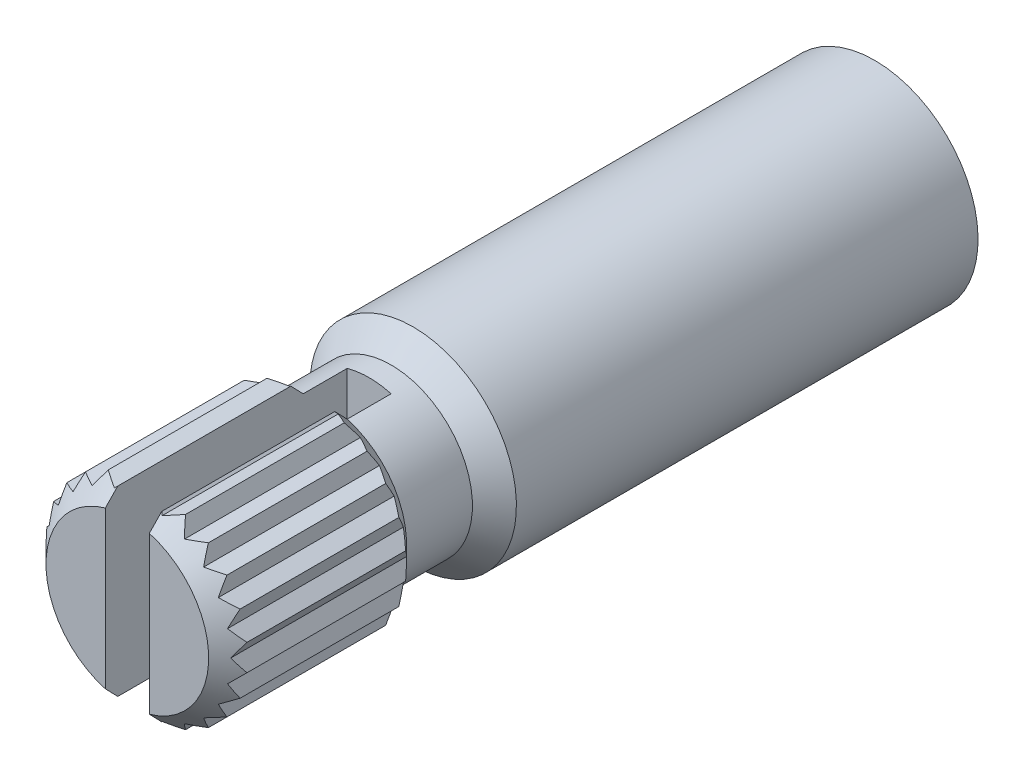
ISO-10303-21;
HEADER;
FILE_DESCRIPTION(('STEP AP214'),'2;1');
FILE_NAME('part.step','',(''),(''),'','','');
FILE_SCHEMA(('AUTOMOTIVE_DESIGN { 1 0 10303 214 1 1 1 1 }'));
ENDSEC;
DATA;
#1=APPLICATION_CONTEXT('core data for automotive mechanical design processes');
#2=APPLICATION_PROTOCOL_DEFINITION('international standard','automotive_design',2000,#1);
#3=PRODUCT_CONTEXT('',#1,'mechanical');
#4=PRODUCT('Part','Part','',(#3));
#5=PRODUCT_RELATED_PRODUCT_CATEGORY('part','',(#4));
#6=PRODUCT_DEFINITION_FORMATION('','',#4);
#7=PRODUCT_DEFINITION_CONTEXT('part definition',#1,'design');
#8=PRODUCT_DEFINITION('design','',#6,#7);
#9=PRODUCT_DEFINITION_SHAPE('','',#8);
#10=(LENGTH_UNIT() NAMED_UNIT(*) SI_UNIT(.MILLI.,.METRE.));
#11=(NAMED_UNIT(*) PLANE_ANGLE_UNIT() SI_UNIT($,.RADIAN.));
#12=(NAMED_UNIT(*) SI_UNIT($,.STERADIAN.) SOLID_ANGLE_UNIT());
#13=UNCERTAINTY_MEASURE_WITH_UNIT(LENGTH_MEASURE(1.E-05),#10,'distance_accuracy_value','');
#14=(GEOMETRIC_REPRESENTATION_CONTEXT(3) GLOBAL_UNCERTAINTY_ASSIGNED_CONTEXT((#13)) GLOBAL_UNIT_ASSIGNED_CONTEXT((#10,
#11,#12)) REPRESENTATION_CONTEXT('',''));
#15=CARTESIAN_POINT('',(0.,0.,0.));
#16=DIRECTION('',(0.,0.,1.));
#17=DIRECTION('',(1.,0.,0.));
#18=AXIS2_PLACEMENT_3D('',#15,#16,#17);
#19=CARTESIAN_POINT('',(2.8901057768,0.3804896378,16.16202));
#20=DIRECTION('',(-0.862638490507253,0.505820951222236,0.));
#21=DIRECTION('',(-0.505820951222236,-0.862638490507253,0.));
#22=AXIS2_PLACEMENT_3D('',#19,#20,#21);
#23=PLANE('',#22);
#24=DIRECTION('',(0.,0.,-1.));
#25=VECTOR('',#24,1.);
#26=CARTESIAN_POINT('',(2.667,0.,18.7325));
#27=LINE('',#26,#25);
#28=CARTESIAN_POINT('',(2.66700000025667,0.,21.2724999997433));
#29=VERTEX_POINT('',#28);
#30=CARTESIAN_POINT('',(2.66700000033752,5.75613074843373E-10,16.1925000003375));
#31=VERTEX_POINT('',#30);
#32=EDGE_CURVE('E361',#29,#31,#27,.T.);
#33=ORIENTED_EDGE('',*,*,#32,.T.);
#34=CARTESIAN_POINT('',(2.89010577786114,0.380489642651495,16.4405443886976));
#35=CARTESIAN_POINT('',(2.87192069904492,0.349476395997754,16.4184684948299));
#36=CARTESIAN_POINT('',(2.85364229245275,0.318303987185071,16.3966902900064));
#37=CARTESIAN_POINT('',(2.81689260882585,0.255630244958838,16.3538155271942));
#38=CARTESIAN_POINT('',(2.79842141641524,0.224129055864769,16.3327186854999));
#39=CARTESIAN_POINT('',(2.76126353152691,0.160759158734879,16.2912729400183));
#40=CARTESIAN_POINT('',(2.74257682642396,0.128890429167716,16.270924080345));
#41=CARTESIAN_POINT('',(2.70496720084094,0.0647501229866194,16.2310604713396));
#42=CARTESIAN_POINT('',(2.68604418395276,0.0324783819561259,16.2115460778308));
#43=CARTESIAN_POINT('',(2.66700000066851,1.14008439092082E-09,16.1925000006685));
#44=B_SPLINE_CURVE_WITH_KNOTS('',3,(#34,#35,#36,#37,#38,#39,#40,#41,#42,#43),.UNSPECIFIED.,.F.,
.F.,(4,2,2,2,4),(0.,0.126565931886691,0.253078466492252,0.379598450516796,0.50617185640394),.UNSPECIFIED.);
#45=CARTESIAN_POINT('',(2.8901057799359,0.380489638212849,16.4405443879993));
#46=VERTEX_POINT('',#45);
#47=EDGE_CURVE('E22',#46,#31,#44,.T.);
#48=ORIENTED_EDGE('',*,*,#47,.F.);
#49=DIRECTION('',(0.,0.,1.));
#50=VECTOR('',#49,1.);
#51=CARTESIAN_POINT('',(2.8901057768,0.3804896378,18.7325));
#52=LINE('',#51,#50);
#53=CARTESIAN_POINT('',(2.89010577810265,0.380489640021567,21.0244556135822));
#54=VERTEX_POINT('',#53);
#55=EDGE_CURVE('E409',#46,#54,#52,.T.);
#56=ORIENTED_EDGE('',*,*,#55,.T.);
#57=CARTESIAN_POINT('',(2.66700000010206,4.87542853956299E-10,21.2724999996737));
#58=CARTESIAN_POINT('',(2.68604418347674,0.0324783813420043,21.2534539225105));
#59=CARTESIAN_POINT('',(2.70496720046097,0.06475012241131,21.233939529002));
#60=CARTESIAN_POINT('',(2.74257682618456,0.128890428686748,21.1940759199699));
#61=CARTESIAN_POINT('',(2.76126353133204,0.160759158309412,21.1737270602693));
#62=CARTESIAN_POINT('',(2.79842141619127,0.224129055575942,21.1322813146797));
#63=CARTESIAN_POINT('',(2.81689260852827,0.255630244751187,21.1111844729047));
#64=CARTESIAN_POINT('',(2.8536422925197,0.318303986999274,21.0683097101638));
#65=CARTESIAN_POINT('',(2.87192069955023,0.349476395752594,21.0465315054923));
#66=CARTESIAN_POINT('',(2.89010577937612,0.380489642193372,21.0244556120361));
#67=B_SPLINE_CURVE_WITH_KNOTS('',3,(#57,#58,#59,#60,#61,#62,#63,#64,#65,#66),.UNSPECIFIED.,.F.,
.F.,(4,2,2,2,4),(0.,0.126573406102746,0.253093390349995,0.379605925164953,0.506171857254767),.UNSPECIFIED.);
#68=EDGE_CURVE('E359',#29,#54,#67,.T.);
#69=ORIENTED_EDGE('',*,*,#68,.F.);
#70=EDGE_LOOP('',(#33,#48,#56,#69));
#71=FACE_BOUND('',#70,.T.);
#72=ADVANCED_FACE('F17',(#71),#23,.F.);
#73=CARTESIAN_POINT('',(2.667,0.,16.16202));
#74=DIRECTION('',(-0.862638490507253,-0.505820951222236,0.));
#75=DIRECTION('',(0.505820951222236,-0.862638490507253,0.));
#76=AXIS2_PLACEMENT_3D('',#73,#74,#75);
#77=PLANE('',#76);
#78=DIRECTION('',(0.,0.,-1.));
#79=VECTOR('',#78,1.);
#80=CARTESIAN_POINT('',(2.8901057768,-0.3804896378,18.7325));
#81=LINE('',#80,#79);
#82=CARTESIAN_POINT('',(2.8901057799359,-0.380489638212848,21.0244556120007));
#83=VERTEX_POINT('',#82);
#84=CARTESIAN_POINT('',(2.89010577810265,-0.380489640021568,16.4405443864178));
#85=VERTEX_POINT('',#84);
#86=EDGE_CURVE('E367',#83,#85,#81,.T.);
#87=ORIENTED_EDGE('',*,*,#86,.T.);
#88=CARTESIAN_POINT('',(2.66700000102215,-1.03937518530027E-09,16.1925000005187));
#89=CARTESIAN_POINT('',(2.68604418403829,-0.0324783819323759,16.2115460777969));
#90=CARTESIAN_POINT('',(2.70496720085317,-0.0647501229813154,16.2310604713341));
#91=CARTESIAN_POINT('',(2.74257682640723,-0.128890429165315,16.2709240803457));
#92=CARTESIAN_POINT('',(2.76126353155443,-0.160759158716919,16.291272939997));
#93=CARTESIAN_POINT('',(2.79842141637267,-0.224129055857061,16.3327186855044));
#94=CARTESIAN_POINT('',(2.81689260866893,-0.255630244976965,16.3538155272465));
#95=CARTESIAN_POINT('',(2.85364229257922,-0.318303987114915,16.3966902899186));
#96=CARTESIAN_POINT('',(2.87192069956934,-0.349476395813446,16.4184684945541));
#97=CARTESIAN_POINT('',(2.89010577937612,-0.380489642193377,16.4405443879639));
#98=B_SPLINE_CURVE_WITH_KNOTS('',3,(#88,#89,#90,#91,#92,#93,#94,#95,#96,#97),.UNSPECIFIED.,.F.,
.F.,(4,2,2,2,4),(0.,0.126573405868,0.253093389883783,0.379605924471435,0.506171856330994),.UNSPECIFIED.);
#99=EDGE_CURVE('E354',#31,#85,#98,.T.);
#100=ORIENTED_EDGE('',*,*,#99,.F.);
#101=ORIENTED_EDGE('',*,*,#32,.F.);
#102=CARTESIAN_POINT('',(2.89010577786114,-0.380489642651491,21.0244556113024));
#103=CARTESIAN_POINT('',(2.87192069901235,-0.349476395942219,21.0465315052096));
#104=CARTESIAN_POINT('',(2.85364229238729,-0.318303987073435,21.0683097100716));
#105=CARTESIAN_POINT('',(2.8168926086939,-0.255630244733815,21.1111844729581));
#106=CARTESIAN_POINT('',(2.7984214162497,-0.22412905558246,21.1322813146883));
#107=CARTESIAN_POINT('',(2.76126353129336,-0.16075915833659,21.1737270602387));
#108=CARTESIAN_POINT('',(2.742576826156,-0.128890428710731,21.1940759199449));
#109=CARTESIAN_POINT('',(2.70496720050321,-0.0647501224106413,21.2339395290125));
#110=CARTESIAN_POINT('',(2.68604418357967,-0.032478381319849,21.2534539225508));
#111=CARTESIAN_POINT('',(2.66700000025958,-4.42686661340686E-10,21.2724999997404));
#112=B_SPLINE_CURVE_WITH_KNOTS('',3,(#102,#103,#104,#105,#106,#107,#108,#109,#110,#111),
.UNSPECIFIED.,.F.,.F.,(4,2,2,2,4),(0.,0.126565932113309,0.253078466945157,0.379598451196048,
0.506171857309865),.UNSPECIFIED.);
#113=EDGE_CURVE('E369',#83,#29,#112,.T.);
#114=ORIENTED_EDGE('',*,*,#113,.F.);
#115=EDGE_LOOP('',(#87,#100,#101,#114));
#116=FACE_BOUND('',#115,.T.);
#117=ADVANCED_FACE('F365',(#116),#77,.F.);
#118=CARTESIAN_POINT('',(2.5761241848,0.6902704,16.16202));
#119=DIRECTION('',(-0.702328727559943,-0.711852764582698,0.));
#120=DIRECTION('',(0.711852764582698,-0.702328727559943,0.));
#121=AXIS2_PLACEMENT_3D('',#118,#119,#120);
#122=PLANE('',#121);
#123=ORIENTED_EDGE('',*,*,#55,.F.);
#124=CARTESIAN_POINT('',(2.57612418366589,0.690270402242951,16.1925000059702));
#125=CARTESIAN_POINT('',(2.6029254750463,0.663827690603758,16.2115460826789));
#126=CARTESIAN_POINT('',(2.6295562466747,0.637553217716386,16.2310604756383));
#127=CARTESIAN_POINT('',(2.68248508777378,0.585332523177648,16.2709240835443));
#128=CARTESIAN_POINT('',(2.70878329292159,0.559386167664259,16.2912729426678));
#129=CARTESIAN_POINT('',(2.76107638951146,0.507792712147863,16.3327186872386));
#130=CARTESIAN_POINT('',(2.7870712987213,0.482145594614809,16.3538155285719));
#131=CARTESIAN_POINT('',(2.83878992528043,0.431118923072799,16.396690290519));
#132=CARTESIAN_POINT('',(2.86451352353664,0.405739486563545,16.4184684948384));
#133=CARTESIAN_POINT('',(2.89010578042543,0.380489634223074,16.4405443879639));
#134=B_SPLINE_CURVE_WITH_KNOTS('',3,(#124,#125,#126,#127,#128,#129,#130,#131,#132,#133),
.UNSPECIFIED.,.F.,.F.,(4,2,2,2,4),(0.,0.126573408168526,0.253093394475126,0.379605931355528,
0.506171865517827),.UNSPECIFIED.);
#135=CARTESIAN_POINT('',(2.57612418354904,0.690270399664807,16.1925000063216));
#136=VERTEX_POINT('',#135);
#137=EDGE_CURVE('E349',#136,#46,#134,.T.);
#138=ORIENTED_EDGE('',*,*,#137,.F.);
#139=DIRECTION('',(0.,0.,1.));
#140=VECTOR('',#139,1.);
#141=CARTESIAN_POINT('',(2.5761241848,0.6902704,18.7325));
#142=LINE('',#141,#140);
#143=CARTESIAN_POINT('',(2.5761241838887,0.69027040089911,21.2724999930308));
#144=VERTEX_POINT('',#143);
#145=EDGE_CURVE('E864',#136,#144,#142,.T.);
#146=ORIENTED_EDGE('',*,*,#145,.T.);
#147=CARTESIAN_POINT('',(2.89010577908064,0.380489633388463,21.0244556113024));
#148=CARTESIAN_POINT('',(2.86451352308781,0.405739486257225,21.0465315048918));
#149=CARTESIAN_POINT('',(2.83878992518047,0.431118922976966,21.0683097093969));
#150=CARTESIAN_POINT('',(2.78707129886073,0.482145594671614,21.1111844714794));
#151=CARTESIAN_POINT('',(2.76107638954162,0.507792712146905,21.1322813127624));
#152=CARTESIAN_POINT('',(2.70878329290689,0.559386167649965,21.1737270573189));
#153=CARTESIAN_POINT('',(2.68248508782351,0.585332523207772,21.1940759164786));
#154=CARTESIAN_POINT('',(2.62955624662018,0.637553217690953,21.2339395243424));
#155=CARTESIAN_POINT('',(2.60292547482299,0.663827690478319,21.2534539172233));
#156=CARTESIAN_POINT('',(2.57612418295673,0.69027040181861,21.272499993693));
#157=B_SPLINE_CURVE_WITH_KNOTS('',3,(#147,#148,#149,#150,#151,#152,#153,#154,#155,#156),
.UNSPECIFIED.,.F.,.F.,(4,2,2,2,4),(0.,0.126565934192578,0.253078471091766,0.379598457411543,
0.506171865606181),.UNSPECIFIED.);
#158=EDGE_CURVE('E401',#54,#144,#157,.T.);
#159=ORIENTED_EDGE('',*,*,#158,.F.);
#160=EDGE_LOOP('',(#123,#138,#146,#159));
#161=FACE_BOUND('',#160,.T.);
#162=ADVANCED_FACE('F389',(#161),#122,.F.);
#163=CARTESIAN_POINT('',(2.8901057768,-0.3804896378,16.16202));
#164=DIRECTION('',(-0.702328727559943,0.711852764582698,0.));
#165=DIRECTION('',(-0.711852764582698,-0.702328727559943,0.));
#166=AXIS2_PLACEMENT_3D('',#163,#164,#165);
#167=PLANE('',#166);
#168=DIRECTION('',(0.,0.,-1.));
#169=VECTOR('',#168,1.);
#170=CARTESIAN_POINT('',(2.5761241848,-0.6902704,18.7325));
#171=LINE('',#170,#169);
#172=CARTESIAN_POINT('',(2.57612418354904,-0.690270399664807,21.2724999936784));
#173=VERTEX_POINT('',#172);
#174=CARTESIAN_POINT('',(2.5761241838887,-0.69027040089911,16.1925000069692));
#175=VERTEX_POINT('',#174);
#176=EDGE_CURVE('E860',#173,#175,#171,.T.);
#177=ORIENTED_EDGE('',*,*,#176,.T.);
#178=CARTESIAN_POINT('',(2.89010577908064,-0.380489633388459,16.4405443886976));
#179=CARTESIAN_POINT('',(2.86451352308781,-0.405739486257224,16.4184684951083));
#180=CARTESIAN_POINT('',(2.83878992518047,-0.431118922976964,16.3966902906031));
#181=CARTESIAN_POINT('',(2.78707129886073,-0.482145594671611,16.3538155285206));
#182=CARTESIAN_POINT('',(2.76107638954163,-0.507792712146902,16.3327186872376));
#183=CARTESIAN_POINT('',(2.70878329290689,-0.559386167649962,16.2912729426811));
#184=CARTESIAN_POINT('',(2.68248508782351,-0.58533252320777,16.2709240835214));
#185=CARTESIAN_POINT('',(2.62955624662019,-0.637553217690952,16.2310604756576));
#186=CARTESIAN_POINT('',(2.60292547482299,-0.663827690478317,16.2115460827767));
#187=CARTESIAN_POINT('',(2.57612418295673,-0.690270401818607,16.192500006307));
#188=B_SPLINE_CURVE_WITH_KNOTS('',3,(#178,#179,#180,#181,#182,#183,#184,#185,#186,#187),
.UNSPECIFIED.,.F.,.F.,(4,2,2,2,4),(0.,0.126565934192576,0.253078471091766,0.379598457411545,
0.506171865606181),.UNSPECIFIED.);
#189=EDGE_CURVE('E874',#85,#175,#188,.T.);
#190=ORIENTED_EDGE('',*,*,#189,.F.);
#191=ORIENTED_EDGE('',*,*,#86,.F.);
#192=CARTESIAN_POINT('',(2.57612418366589,-0.690270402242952,21.2724999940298));
#193=CARTESIAN_POINT('',(2.60292547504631,-0.663827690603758,21.2534539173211));
#194=CARTESIAN_POINT('',(2.6295562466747,-0.637553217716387,21.2339395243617));
#195=CARTESIAN_POINT('',(2.68248508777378,-0.585332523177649,21.1940759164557));
#196=CARTESIAN_POINT('',(2.70878329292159,-0.559386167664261,21.1737270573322));
#197=CARTESIAN_POINT('',(2.76107638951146,-0.507792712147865,21.1322813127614));
#198=CARTESIAN_POINT('',(2.7870712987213,-0.482145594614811,21.1111844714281));
#199=CARTESIAN_POINT('',(2.83878992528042,-0.431118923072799,21.068309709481));
#200=CARTESIAN_POINT('',(2.86451352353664,-0.405739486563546,21.0465315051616));
#201=CARTESIAN_POINT('',(2.89010578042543,-0.380489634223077,21.0244556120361));
#202=B_SPLINE_CURVE_WITH_KNOTS('',3,(#192,#193,#194,#195,#196,#197,#198,#199,#200,#201),
.UNSPECIFIED.,.F.,.F.,(4,2,2,2,4),(0.,0.126573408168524,0.253093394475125,0.379605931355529,
0.506171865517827),.UNSPECIFIED.);
#203=EDGE_CURVE('E870',#173,#83,#202,.T.);
#204=ORIENTED_EDGE('',*,*,#203,.F.);
#205=EDGE_LOOP('',(#177,#190,#191,#204));
#206=FACE_BOUND('',#205,.T.);
#207=ADVANCED_FACE('F395',(#206),#167,.F.);
#208=CARTESIAN_POINT('',(2.6931498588,1.1155391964,16.16202));
#209=DIRECTION('',(-0.964160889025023,0.265318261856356,0.));
#210=DIRECTION('',(-0.265318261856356,-0.964160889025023,0.));
#211=AXIS2_PLACEMENT_3D('',#208,#209,#210);
#212=PLANE('',#211);
#213=ORIENTED_EDGE('',*,*,#145,.F.);
#214=CARTESIAN_POINT('',(2.69314985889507,1.11553919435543,16.4405443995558));
#215=CARTESIAN_POINT('',(2.68361123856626,1.08087605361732,16.4184685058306));
#216=CARTESIAN_POINT('',(2.67402366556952,1.0460350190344,16.396690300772));
#217=CARTESIAN_POINT('',(2.65474735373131,0.97598531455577,16.353815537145));
#218=CARTESIAN_POINT('',(2.64505865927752,0.940776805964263,16.3327186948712));
#219=CARTESIAN_POINT('',(2.62556823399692,0.869949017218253,16.2912729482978));
#220=CARTESIAN_POINT('',(2.61576649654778,0.83432971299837,16.2709240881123));
#221=CARTESIAN_POINT('',(2.59603911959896,0.76264084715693,16.2310604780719));
#222=CARTESIAN_POINT('',(2.58611342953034,0.726571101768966,16.21154608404));
#223=CARTESIAN_POINT('',(2.57612418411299,0.690270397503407,16.192500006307));
#224=B_SPLINE_CURVE_WITH_KNOTS('',3,(#214,#215,#216,#217,#218,#219,#220,#221,#222,#223),
.UNSPECIFIED.,.F.,.F.,(4,2,2,2,4),(0.,0.126565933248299,0.25307846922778,0.379598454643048,
0.506171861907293),.UNSPECIFIED.);
#225=CARTESIAN_POINT('',(2.69314985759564,1.11553919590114,16.4405443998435));
#226=VERTEX_POINT('',#225);
#227=EDGE_CURVE('E866',#226,#136,#224,.T.);
#228=ORIENTED_EDGE('',*,*,#227,.F.);
#229=DIRECTION('',(0.,0.,1.));
#230=VECTOR('',#229,1.);
#231=CARTESIAN_POINT('',(2.6931498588,1.1155391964,18.7325));
#232=LINE('',#231,#230);
#233=CARTESIAN_POINT('',(2.69314985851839,1.11553919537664,21.0244555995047));
#234=VERTEX_POINT('',#233);
#235=EDGE_CURVE('E852',#226,#234,#232,.T.);
#236=ORIENTED_EDGE('',*,*,#235,.T.);
#237=CARTESIAN_POINT('',(2.5761241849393,0.69027039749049,21.2724999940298));
#238=CARTESIAN_POINT('',(2.58611342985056,0.726571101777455,21.2534539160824));
#239=CARTESIAN_POINT('',(2.59603911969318,0.762640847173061,21.2339395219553));
#240=CARTESIAN_POINT('',(2.61576649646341,0.834329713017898,21.1940759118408));
#241=CARTESIAN_POINT('',(2.62556823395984,0.869949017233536,21.1737270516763));
#242=CARTESIAN_POINT('',(2.6450586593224,0.940776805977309,21.1322813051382));
#243=CARTESIAN_POINT('',(2.65474735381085,0.975985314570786,21.1111844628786));
#244=CARTESIAN_POINT('',(2.67402366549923,1.04603501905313,21.0683096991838));
#245=CARTESIAN_POINT('',(2.68361123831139,1.08087605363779,21.0465314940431));
#246=CARTESIAN_POINT('',(2.69314985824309,1.1155391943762,21.0244556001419));
#247=B_SPLINE_CURVE_WITH_KNOTS('',3,(#237,#238,#239,#240,#241,#242,#243,#244,#245,#246),
.UNSPECIFIED.,.F.,.F.,(4,2,2,2,4),(0.,0.126573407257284,0.253093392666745,0.37960592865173,
0.506171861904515),.UNSPECIFIED.);
#248=EDGE_CURVE('E863',#144,#234,#247,.T.);
#249=ORIENTED_EDGE('',*,*,#248,.F.);
#250=EDGE_LOOP('',(#213,#228,#236,#249));
#251=FACE_BOUND('',#250,.T.);
#252=ADVANCED_FACE('F886',(#251),#212,.F.);
#253=CARTESIAN_POINT('',(2.5761241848,-0.6902704,16.16202));
#254=DIRECTION('',(-0.964160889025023,-0.265318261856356,0.));
#255=DIRECTION('',(0.265318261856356,-0.964160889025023,0.));
#256=AXIS2_PLACEMENT_3D('',#253,#254,#255);
#257=PLANE('',#256);
#258=DIRECTION('',(0.,0.,-1.));
#259=VECTOR('',#258,1.);
#260=CARTESIAN_POINT('',(2.6931498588,-1.1155391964,18.7325));
#261=LINE('',#260,#259);
#262=CARTESIAN_POINT('',(2.69314985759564,-1.11553919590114,21.0244556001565));
#263=VERTEX_POINT('',#262);
#264=CARTESIAN_POINT('',(2.69314985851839,-1.11553919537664,16.4405444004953));
#265=VERTEX_POINT('',#264);
#266=EDGE_CURVE('E847',#263,#265,#261,.T.);
#267=ORIENTED_EDGE('',*,*,#266,.T.);
#268=CARTESIAN_POINT('',(2.5761241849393,-0.690270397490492,16.1925000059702));
#269=CARTESIAN_POINT('',(2.58611342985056,-0.726571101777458,16.2115460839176));
#270=CARTESIAN_POINT('',(2.59603911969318,-0.762640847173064,16.2310604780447));
#271=CARTESIAN_POINT('',(2.61576649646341,-0.834329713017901,16.2709240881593));
#272=CARTESIAN_POINT('',(2.62556823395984,-0.86994901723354,16.2912729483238));
#273=CARTESIAN_POINT('',(2.6450586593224,-0.940776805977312,16.3327186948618));
#274=CARTESIAN_POINT('',(2.65474735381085,-0.97598531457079,16.3538155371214));
#275=CARTESIAN_POINT('',(2.67402366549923,-1.04603501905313,16.3966903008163));
#276=CARTESIAN_POINT('',(2.68361123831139,-1.08087605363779,16.4184685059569));
#277=CARTESIAN_POINT('',(2.69314985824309,-1.1155391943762,16.4405443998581));
#278=B_SPLINE_CURVE_WITH_KNOTS('',3,(#268,#269,#270,#271,#272,#273,#274,#275,#276,#277),
.UNSPECIFIED.,.F.,.F.,(4,2,2,2,4),(0.,0.126573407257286,0.253093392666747,0.379605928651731,
0.506171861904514),.UNSPECIFIED.);
#279=EDGE_CURVE('E862',#175,#265,#278,.T.);
#280=ORIENTED_EDGE('',*,*,#279,.F.);
#281=ORIENTED_EDGE('',*,*,#176,.F.);
#282=CARTESIAN_POINT('',(2.69314985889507,-1.11553919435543,21.0244556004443));
#283=CARTESIAN_POINT('',(2.68361123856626,-1.08087605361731,21.0465314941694));
#284=CARTESIAN_POINT('',(2.67402366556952,-1.0460350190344,21.068309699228));
#285=CARTESIAN_POINT('',(2.6547473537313,-0.975985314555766,21.111184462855));
#286=CARTESIAN_POINT('',(2.64505865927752,-0.940776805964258,21.1322813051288));
#287=CARTESIAN_POINT('',(2.62556823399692,-0.869949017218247,21.1737270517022));
#288=CARTESIAN_POINT('',(2.61576649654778,-0.834329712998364,21.1940759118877));
#289=CARTESIAN_POINT('',(2.59603911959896,-0.762640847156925,21.2339395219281));
#290=CARTESIAN_POINT('',(2.58611342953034,-0.726571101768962,21.25345391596));
#291=CARTESIAN_POINT('',(2.57612418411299,-0.690270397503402,21.2724999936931));
#292=B_SPLINE_CURVE_WITH_KNOTS('',3,(#282,#283,#284,#285,#286,#287,#288,#289,#290,#291),
.UNSPECIFIED.,.F.,.F.,(4,2,2,2,4),(0.,0.126565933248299,0.253078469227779,0.379598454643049,
0.506171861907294),.UNSPECIFIED.);
#293=EDGE_CURVE('E901',#263,#173,#292,.T.);
#294=ORIENTED_EDGE('',*,*,#293,.F.);
#295=EDGE_LOOP('',(#267,#280,#281,#294));
#296=FACE_BOUND('',#295,.T.);
#297=ADVANCED_FACE('F890',(#296),#257,.F.);
#298=CARTESIAN_POINT('',(-2.8901057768,-0.3804896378,16.16202));
#299=DIRECTION('',(0.862638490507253,-0.505820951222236,0.));
#300=DIRECTION('',(0.505820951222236,0.862638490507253,0.));
#301=AXIS2_PLACEMENT_3D('',#298,#299,#300);
#302=PLANE('',#301);
#303=DIRECTION('',(0.,0.,-1.));
#304=VECTOR('',#303,1.);
#305=CARTESIAN_POINT('',(-2.667,0.,18.7325));
#306=LINE('',#305,#304);
#307=CARTESIAN_POINT('',(-2.66700000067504,-4.73005292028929E-11,21.272499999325));
#308=VERTEX_POINT('',#307);
#309=CARTESIAN_POINT('',(-2.66700000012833,-2.18861938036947E-10,16.1925000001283));
#310=VERTEX_POINT('',#309);
#311=EDGE_CURVE('E856',#308,#310,#306,.T.);
#312=ORIENTED_EDGE('',*,*,#311,.T.);
#313=CARTESIAN_POINT('',(-2.89010577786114,-0.380489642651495,16.4405443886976));
#314=CARTESIAN_POINT('',(-2.87192069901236,-0.349476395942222,16.4184684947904));
#315=CARTESIAN_POINT('',(-2.85364229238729,-0.318303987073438,16.3966902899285));
#316=CARTESIAN_POINT('',(-2.8168926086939,-0.255630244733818,16.3538155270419));
#317=CARTESIAN_POINT('',(-2.79842141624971,-0.224129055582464,16.3327186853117));
#318=CARTESIAN_POINT('',(-2.76126353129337,-0.160759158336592,16.2912729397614));
#319=CARTESIAN_POINT('',(-2.74257682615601,-0.128890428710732,16.2709240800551));
#320=CARTESIAN_POINT('',(-2.70496720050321,-0.0647501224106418,16.2310604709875));
#321=CARTESIAN_POINT('',(-2.68604418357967,-0.0324783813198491,16.2115460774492));
#322=CARTESIAN_POINT('',(-2.66700000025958,-4.42686754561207E-10,16.1925000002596));
#323=B_SPLINE_CURVE_WITH_KNOTS('',3,(#313,#314,#315,#316,#317,#318,#319,#320,#321,#322),
.UNSPECIFIED.,.F.,.F.,(4,2,2,2,4),(0.,0.126565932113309,0.253078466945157,0.37959845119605,
0.50617185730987),.UNSPECIFIED.);
#324=CARTESIAN_POINT('',(-2.8901057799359,-0.380489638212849,16.4405443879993));
#325=VERTEX_POINT('',#324);
#326=EDGE_CURVE('E910',#325,#310,#323,.T.);
#327=ORIENTED_EDGE('',*,*,#326,.F.);
#328=DIRECTION('',(0.,0.,1.));
#329=VECTOR('',#328,1.);
#330=CARTESIAN_POINT('',(-2.8901057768,-0.3804896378,18.7325));
#331=LINE('',#330,#329);
#332=CARTESIAN_POINT('',(-2.89010577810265,-0.380489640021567,21.0244556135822));
#333=VERTEX_POINT('',#332);
#334=EDGE_CURVE('E616',#325,#333,#331,.T.);
#335=ORIENTED_EDGE('',*,*,#334,.T.);
#336=CARTESIAN_POINT('',(-2.6670000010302,-1.09301860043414E-09,21.2724999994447));
#337=CARTESIAN_POINT('',(-2.68604418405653,-0.0324783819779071,21.2534539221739));
#338=CARTESIAN_POINT('',(-2.70496720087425,-0.0647501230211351,21.233939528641));
#339=CARTESIAN_POINT('',(-2.74257682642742,-0.128890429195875,21.1940759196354));
#340=CARTESIAN_POINT('',(-2.76126353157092,-0.16075915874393,21.1737270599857));
#341=CARTESIAN_POINT('',(-2.79842141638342,-0.224129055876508,21.1322813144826));
#342=CARTESIAN_POINT('',(-2.81689260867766,-0.255630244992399,21.111184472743));
#343=CARTESIAN_POINT('',(-2.85364229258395,-0.318303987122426,21.0683097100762));
#344=CARTESIAN_POINT('',(-2.8719206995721,-0.349476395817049,21.0465315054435));
#345=CARTESIAN_POINT('',(-2.89010577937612,-0.380489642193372,21.0244556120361));
#346=B_SPLINE_CURVE_WITH_KNOTS('',3,(#336,#337,#338,#339,#340,#341,#342,#343,#344,#345),
.UNSPECIFIED.,.F.,.F.,(4,2,2,2,4),(0.,0.126573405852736,0.253093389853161,0.379605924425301,
0.506171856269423),.UNSPECIFIED.);
#347=EDGE_CURVE('E859',#308,#333,#346,.T.);
#348=ORIENTED_EDGE('',*,*,#347,.F.);
#349=EDGE_LOOP('',(#312,#327,#335,#348));
#350=FACE_BOUND('',#349,.T.);
#351=ADVANCED_FACE('F896',(#350),#302,.F.);
#352=CARTESIAN_POINT('',(-2.667,0.,16.16202));
#353=DIRECTION('',(0.862638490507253,0.505820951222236,0.));
#354=DIRECTION('',(-0.505820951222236,0.862638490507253,0.));
#355=AXIS2_PLACEMENT_3D('',#352,#353,#354);
#356=PLANE('',#355);
#357=DIRECTION('',(0.,0.,-1.));
#358=VECTOR('',#357,1.);
#359=CARTESIAN_POINT('',(-2.8901057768,0.3804896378,18.7325));
#360=LINE('',#359,#358);
#361=CARTESIAN_POINT('',(-2.8901057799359,0.380489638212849,21.0244556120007));
#362=VERTEX_POINT('',#361);
#363=CARTESIAN_POINT('',(-2.89010577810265,0.380489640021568,16.4405443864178));
#364=VERTEX_POINT('',#363);
#365=EDGE_CURVE('E842',#362,#364,#360,.T.);
#366=ORIENTED_EDGE('',*,*,#365,.T.);
#367=CARTESIAN_POINT('',(-2.66700000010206,4.87544428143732E-10,16.1925000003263));
#368=CARTESIAN_POINT('',(-2.68604418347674,0.0324783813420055,16.2115460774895));
#369=CARTESIAN_POINT('',(-2.70496720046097,0.064750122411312,16.231060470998));
#370=CARTESIAN_POINT('',(-2.74257682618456,0.128890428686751,16.2709240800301));
#371=CARTESIAN_POINT('',(-2.76126353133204,0.160759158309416,16.2912729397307));
#372=CARTESIAN_POINT('',(-2.79842141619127,0.224129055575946,16.3327186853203));
#373=CARTESIAN_POINT('',(-2.81689260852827,0.255630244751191,16.3538155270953));
#374=CARTESIAN_POINT('',(-2.8536422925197,0.318303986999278,16.3966902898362));
#375=CARTESIAN_POINT('',(-2.87192069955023,0.349476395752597,16.4184684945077));
#376=CARTESIAN_POINT('',(-2.89010577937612,0.380489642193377,16.4405443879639));
#377=B_SPLINE_CURVE_WITH_KNOTS('',3,(#367,#368,#369,#370,#371,#372,#373,#374,#375,#376),
.UNSPECIFIED.,.F.,.F.,(4,2,2,2,4),(0.,0.126573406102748,0.253093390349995,0.379605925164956,
0.50617185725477),.UNSPECIFIED.);
#378=EDGE_CURVE('E438',#310,#364,#377,.T.);
#379=ORIENTED_EDGE('',*,*,#378,.F.);
#380=ORIENTED_EDGE('',*,*,#311,.F.);
#381=CARTESIAN_POINT('',(-2.89010577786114,0.380489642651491,21.0244556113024));
#382=CARTESIAN_POINT('',(-2.87192069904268,0.349476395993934,21.0465315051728));
#383=CARTESIAN_POINT('',(-2.85364229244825,0.318303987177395,21.0683097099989));
#384=CARTESIAN_POINT('',(-2.81689260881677,0.25563024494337,21.1111844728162));
#385=CARTESIAN_POINT('',(-2.79842141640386,0.224129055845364,21.1322813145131));
#386=CARTESIAN_POINT('',(-2.76126353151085,0.160759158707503,21.1737270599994));
#387=CARTESIAN_POINT('',(-2.74257682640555,0.128890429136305,21.194075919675));
#388=CARTESIAN_POINT('',(-2.70496720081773,0.0647501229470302,21.2339395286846));
#389=CARTESIAN_POINT('',(-2.68604418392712,0.0324783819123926,21.2534539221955));
#390=CARTESIAN_POINT('',(-2.6670000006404,1.09215109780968E-09,21.2724999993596));
#391=B_SPLINE_CURVE_WITH_KNOTS('',3,(#381,#382,#383,#384,#385,#386,#387,#388,#389,#390),
.UNSPECIFIED.,.F.,.F.,(4,2,2,2,4),(0.,0.126565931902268,0.253078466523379,0.37959845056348,
0.506171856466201),.UNSPECIFIED.);
#392=EDGE_CURVE('E729',#362,#308,#391,.T.);
#393=ORIENTED_EDGE('',*,*,#392,.F.);
#394=EDGE_LOOP('',(#366,#379,#380,#393));
#395=FACE_BOUND('',#394,.T.);
#396=ADVANCED_FACE('F1630',(#395),#356,.F.);
#397=CARTESIAN_POINT('',(2.3096897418,1.3335,16.16202));
#398=DIRECTION('',(-0.494156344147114,-0.869373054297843,0.));
#399=DIRECTION('',(0.869373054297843,-0.494156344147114,0.));
#400=AXIS2_PLACEMENT_3D('',#397,#398,#399);
#401=PLANE('',#400);
#402=ORIENTED_EDGE('',*,*,#235,.F.);
#403=CARTESIAN_POINT('',(2.30968974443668,1.33349999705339,16.1924999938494));
#404=CARTESIAN_POINT('',(2.34242168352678,1.31489498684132,16.2115460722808));
#405=CARTESIAN_POINT('',(2.37494536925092,1.29640834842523,16.23106046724));
#406=CARTESIAN_POINT('',(2.43958641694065,1.25966602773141,16.2709240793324));
#407=CARTESIAN_POINT('',(2.4717039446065,1.24141025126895,16.2912729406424));
#408=CARTESIAN_POINT('',(2.53556856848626,1.20510925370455,16.3327186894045));
#409=CARTESIAN_POINT('',(2.56731568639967,1.18706402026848,16.3538155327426));
#410=CARTESIAN_POINT('',(2.63047872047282,1.15116181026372,16.3966902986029));
#411=CARTESIAN_POINT('',(2.66189449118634,1.13330491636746,16.4184685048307));
#412=CARTESIAN_POINT('',(2.69314985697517,1.11553919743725,16.4405443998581));
#413=B_SPLINE_CURVE_WITH_KNOTS('',3,(#403,#404,#405,#406,#407,#408,#409,#410,#411,#412),
.UNSPECIFIED.,.F.,.F.,(4,2,2,2,4),(0.,0.126573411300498,0.253093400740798,0.379605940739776,
0.506171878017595),.UNSPECIFIED.);
#414=CARTESIAN_POINT('',(2.30968974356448,1.33350000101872,16.1924999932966));
#415=VERTEX_POINT('',#414);
#416=EDGE_CURVE('E855',#415,#226,#413,.T.);
#417=ORIENTED_EDGE('',*,*,#416,.F.);
#418=DIRECTION('',(0.,0.,1.));
#419=VECTOR('',#418,1.);
#420=CARTESIAN_POINT('',(2.3096897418,1.3335,18.7325));
#421=LINE('',#420,#419);
#422=CARTESIAN_POINT('',(2.30968974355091,1.33349999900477,21.2725000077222));
#423=VERTEX_POINT('',#422);
#424=EDGE_CURVE('E839',#415,#423,#421,.T.);
#425=ORIENTED_EDGE('',*,*,#424,.T.);
#426=CARTESIAN_POINT('',(2.6931498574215,1.11553919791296,21.0244556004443));
#427=CARTESIAN_POINT('',(2.66189449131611,1.13330491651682,21.0465314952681));
#428=CARTESIAN_POINT('',(2.63047872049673,1.15116181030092,21.0683097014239));
#429=CARTESIAN_POINT('',(2.56731568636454,1.18706402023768,21.1111844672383));
#430=CARTESIAN_POINT('',(2.53556856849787,1.20510925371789,21.1322813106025));
#431=CARTESIAN_POINT('',(2.47170394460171,1.24141025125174,21.1737270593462));
#432=CARTESIAN_POINT('',(2.43958641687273,1.25966602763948,21.1940759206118));
#433=CARTESIAN_POINT('',(2.37494536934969,1.29640834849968,21.2339395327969));
#434=CARTESIAN_POINT('',(2.3424216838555,1.31489498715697,21.2534539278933));
#435=CARTESIAN_POINT('',(2.30968974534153,1.33349999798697,21.2725000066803));
#436=B_SPLINE_CURVE_WITH_KNOTS('',3,(#426,#427,#428,#429,#430,#431,#432,#433,#434,#435),
.UNSPECIFIED.,.F.,.F.,(4,2,2,2,4),(0.,0.126565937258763,0.253078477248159,0.379598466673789,
0.506171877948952),.UNSPECIFIED.);
#437=EDGE_CURVE('E851',#234,#423,#436,.T.);
#438=ORIENTED_EDGE('',*,*,#437,.F.);
#439=EDGE_LOOP('',(#402,#417,#425,#438));
#440=FACE_BOUND('',#439,.T.);
#441=ADVANCED_FACE('F1623',(#440),#401,.F.);
#442=CARTESIAN_POINT('',(2.6931498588,-1.1155391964,16.16202));
#443=DIRECTION('',(-0.494156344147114,0.869373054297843,0.));
#444=DIRECTION('',(-0.869373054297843,-0.494156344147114,0.));
#445=AXIS2_PLACEMENT_3D('',#442,#443,#444);
#446=PLANE('',#445);
#447=DIRECTION('',(0.,0.,-1.));
#448=VECTOR('',#447,1.);
#449=CARTESIAN_POINT('',(2.3096897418,-1.3335,18.7325));
#450=LINE('',#449,#448);
#451=CARTESIAN_POINT('',(2.30968974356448,-1.33350000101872,21.2725000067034));
#452=VERTEX_POINT('',#451);
#453=CARTESIAN_POINT('',(2.30968974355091,-1.33349999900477,16.1924999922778));
#454=VERTEX_POINT('',#453);
#455=EDGE_CURVE('E834',#452,#454,#450,.T.);
#456=ORIENTED_EDGE('',*,*,#455,.T.);
#457=CARTESIAN_POINT('',(2.6931498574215,-1.11553919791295,16.4405443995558));
#458=CARTESIAN_POINT('',(2.66189449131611,-1.13330491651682,16.4184685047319));
#459=CARTESIAN_POINT('',(2.63047872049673,-1.15116181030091,16.3966902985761));
#460=CARTESIAN_POINT('',(2.56731568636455,-1.18706402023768,16.3538155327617));
#461=CARTESIAN_POINT('',(2.53556856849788,-1.20510925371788,16.3327186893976));
#462=CARTESIAN_POINT('',(2.47170394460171,-1.24141025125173,16.2912729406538));
#463=CARTESIAN_POINT('',(2.43958641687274,-1.25966602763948,16.2709240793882));
#464=CARTESIAN_POINT('',(2.37494536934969,-1.29640834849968,16.2310604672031));
#465=CARTESIAN_POINT('',(2.3424216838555,-1.31489498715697,16.2115460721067));
#466=CARTESIAN_POINT('',(2.30968974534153,-1.33349999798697,16.1924999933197));
#467=B_SPLINE_CURVE_WITH_KNOTS('',3,(#457,#458,#459,#460,#461,#462,#463,#464,#465,#466),
.UNSPECIFIED.,.F.,.F.,(4,2,2,2,4),(0.,0.126565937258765,0.25307847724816,0.379598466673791,
0.506171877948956),.UNSPECIFIED.);
#468=EDGE_CURVE('E850',#265,#454,#467,.T.);
#469=ORIENTED_EDGE('',*,*,#468,.F.);
#470=ORIENTED_EDGE('',*,*,#266,.F.);
#471=CARTESIAN_POINT('',(2.30968974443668,-1.33349999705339,21.2725000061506));
#472=CARTESIAN_POINT('',(2.34242168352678,-1.31489498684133,21.2534539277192));
#473=CARTESIAN_POINT('',(2.37494536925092,-1.29640834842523,21.23393953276));
#474=CARTESIAN_POINT('',(2.43958641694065,-1.25966602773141,21.1940759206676));
#475=CARTESIAN_POINT('',(2.4717039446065,-1.24141025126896,21.1737270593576));
#476=CARTESIAN_POINT('',(2.53556856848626,-1.20510925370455,21.1322813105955));
#477=CARTESIAN_POINT('',(2.56731568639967,-1.18706402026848,21.1111844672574));
#478=CARTESIAN_POINT('',(2.63047872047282,-1.15116181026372,21.0683097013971));
#479=CARTESIAN_POINT('',(2.66189449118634,-1.13330491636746,21.0465314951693));
#480=CARTESIAN_POINT('',(2.69314985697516,-1.11553919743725,21.0244556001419));
#481=B_SPLINE_CURVE_WITH_KNOTS('',3,(#471,#472,#473,#474,#475,#476,#477,#478,#479,#480),
.UNSPECIFIED.,.F.,.F.,(4,2,2,2,4),(0.,0.126573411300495,0.253093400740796,0.379605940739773,
0.506171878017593),.UNSPECIFIED.);
#482=EDGE_CURVE('E617',#452,#263,#481,.T.);
#483=ORIENTED_EDGE('',*,*,#482,.F.);
#484=EDGE_LOOP('',(#456,#469,#470,#483));
#485=FACE_BOUND('',#484,.T.);
#486=ADVANCED_FACE('F632',(#485),#446,.F.);
#487=CARTESIAN_POINT('',(-2.5761241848,-0.6902704,16.16202));
#488=DIRECTION('',(0.702328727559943,0.711852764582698,0.));
#489=DIRECTION('',(-0.711852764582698,0.702328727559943,0.));
#490=AXIS2_PLACEMENT_3D('',#487,#488,#489);
#491=PLANE('',#490);
#492=ORIENTED_EDGE('',*,*,#334,.F.);
#493=CARTESIAN_POINT('',(-2.57612418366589,-0.69027040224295,16.1925000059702));
#494=CARTESIAN_POINT('',(-2.60292547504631,-0.663827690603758,16.2115460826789));
#495=CARTESIAN_POINT('',(-2.6295562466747,-0.637553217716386,16.2310604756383));
#496=CARTESIAN_POINT('',(-2.68248508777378,-0.585332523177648,16.2709240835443));
#497=CARTESIAN_POINT('',(-2.70878329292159,-0.559386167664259,16.2912729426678));
#498=CARTESIAN_POINT('',(-2.76107638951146,-0.507792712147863,16.3327186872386));
#499=CARTESIAN_POINT('',(-2.7870712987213,-0.482145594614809,16.3538155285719));
#500=CARTESIAN_POINT('',(-2.83878992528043,-0.431118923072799,16.396690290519));
#501=CARTESIAN_POINT('',(-2.86451352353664,-0.405739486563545,16.4184684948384));
#502=CARTESIAN_POINT('',(-2.89010578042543,-0.380489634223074,16.4405443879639));
#503=B_SPLINE_CURVE_WITH_KNOTS('',3,(#493,#494,#495,#496,#497,#498,#499,#500,#501,#502),
.UNSPECIFIED.,.F.,.F.,(4,2,2,2,4),(0.,0.126573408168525,0.253093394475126,0.379605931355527,
0.506171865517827),.UNSPECIFIED.);
#504=CARTESIAN_POINT('',(-2.57612418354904,-0.690270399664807,16.1925000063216));
#505=VERTEX_POINT('',#504);
#506=EDGE_CURVE('E610',#505,#325,#503,.T.);
#507=ORIENTED_EDGE('',*,*,#506,.F.);
#508=DIRECTION('',(0.,0.,1.));
#509=VECTOR('',#508,1.);
#510=CARTESIAN_POINT('',(-2.5761241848,-0.6902704,18.7325));
#511=LINE('',#510,#509);
#512=CARTESIAN_POINT('',(-2.5761241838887,-0.69027040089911,21.2724999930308));
#513=VERTEX_POINT('',#512);
#514=EDGE_CURVE('E785',#505,#513,#511,.T.);
#515=ORIENTED_EDGE('',*,*,#514,.T.);
#516=CARTESIAN_POINT('',(-2.89010577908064,-0.380489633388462,21.0244556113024));
#517=CARTESIAN_POINT('',(-2.86451352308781,-0.405739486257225,21.0465315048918));
#518=CARTESIAN_POINT('',(-2.83878992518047,-0.431118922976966,21.0683097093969));
#519=CARTESIAN_POINT('',(-2.78707129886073,-0.482145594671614,21.1111844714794));
#520=CARTESIAN_POINT('',(-2.76107638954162,-0.507792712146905,21.1322813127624));
#521=CARTESIAN_POINT('',(-2.70878329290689,-0.559386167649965,21.1737270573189));
#522=CARTESIAN_POINT('',(-2.68248508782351,-0.585332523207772,21.1940759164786));
#523=CARTESIAN_POINT('',(-2.62955624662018,-0.637553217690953,21.2339395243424));
#524=CARTESIAN_POINT('',(-2.60292547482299,-0.663827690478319,21.2534539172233));
#525=CARTESIAN_POINT('',(-2.57612418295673,-0.69027040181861,21.272499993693));
#526=B_SPLINE_CURVE_WITH_KNOTS('',3,(#516,#517,#518,#519,#520,#521,#522,#523,#524,#525),
.UNSPECIFIED.,.F.,.F.,(4,2,2,2,4),(0.,0.126565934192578,0.253078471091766,0.379598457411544,
0.506171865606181),.UNSPECIFIED.);
#527=EDGE_CURVE('E618',#333,#513,#526,.T.);
#528=ORIENTED_EDGE('',*,*,#527,.F.);
#529=EDGE_LOOP('',(#492,#507,#515,#528));
#530=FACE_BOUND('',#529,.T.);
#531=ADVANCED_FACE('F628',(#530),#491,.F.);
#532=CARTESIAN_POINT('',(-2.8901057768,0.3804896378,16.16202));
#533=DIRECTION('',(0.702328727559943,-0.711852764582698,0.));
#534=DIRECTION('',(0.711852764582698,0.702328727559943,0.));
#535=AXIS2_PLACEMENT_3D('',#532,#533,#534);
#536=PLANE('',#535);
#537=DIRECTION('',(0.,0.,-1.));
#538=VECTOR('',#537,1.);
#539=CARTESIAN_POINT('',(-2.5761241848,0.6902704,18.7325));
#540=LINE('',#539,#538);
#541=CARTESIAN_POINT('',(-2.57612418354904,0.690270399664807,21.2724999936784));
#542=VERTEX_POINT('',#541);
#543=CARTESIAN_POINT('',(-2.5761241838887,0.690270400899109,16.1925000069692));
#544=VERTEX_POINT('',#543);
#545=EDGE_CURVE('E784',#542,#544,#540,.T.);
#546=ORIENTED_EDGE('',*,*,#545,.T.);
#547=CARTESIAN_POINT('',(-2.89010577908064,0.380489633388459,16.4405443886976));
#548=CARTESIAN_POINT('',(-2.86451352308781,0.405739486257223,16.4184684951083));
#549=CARTESIAN_POINT('',(-2.83878992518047,0.431118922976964,16.3966902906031));
#550=CARTESIAN_POINT('',(-2.78707129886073,0.482145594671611,16.3538155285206));
#551=CARTESIAN_POINT('',(-2.76107638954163,0.507792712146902,16.3327186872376));
#552=CARTESIAN_POINT('',(-2.70878329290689,0.559386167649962,16.2912729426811));
#553=CARTESIAN_POINT('',(-2.68248508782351,0.585332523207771,16.2709240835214));
#554=CARTESIAN_POINT('',(-2.62955624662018,0.637553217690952,16.2310604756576));
#555=CARTESIAN_POINT('',(-2.60292547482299,0.663827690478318,16.2115460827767));
#556=CARTESIAN_POINT('',(-2.57612418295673,0.690270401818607,16.192500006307));
#557=B_SPLINE_CURVE_WITH_KNOTS('',3,(#547,#548,#549,#550,#551,#552,#553,#554,#555,#556),
.UNSPECIFIED.,.F.,.F.,(4,2,2,2,4),(0.,0.126565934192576,0.253078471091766,0.379598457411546,
0.506171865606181),.UNSPECIFIED.);
#558=EDGE_CURVE('E602',#364,#544,#557,.T.);
#559=ORIENTED_EDGE('',*,*,#558,.F.);
#560=ORIENTED_EDGE('',*,*,#365,.F.);
#561=CARTESIAN_POINT('',(-2.57612418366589,0.690270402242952,21.2724999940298));
#562=CARTESIAN_POINT('',(-2.60292547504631,0.663827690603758,21.2534539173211));
#563=CARTESIAN_POINT('',(-2.6295562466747,0.637553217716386,21.2339395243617));
#564=CARTESIAN_POINT('',(-2.68248508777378,0.585332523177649,21.1940759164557));
#565=CARTESIAN_POINT('',(-2.70878329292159,0.559386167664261,21.1737270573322));
#566=CARTESIAN_POINT('',(-2.76107638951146,0.507792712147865,21.1322813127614));
#567=CARTESIAN_POINT('',(-2.7870712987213,0.482145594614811,21.1111844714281));
#568=CARTESIAN_POINT('',(-2.83878992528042,0.431118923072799,21.068309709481));
#569=CARTESIAN_POINT('',(-2.86451352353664,0.405739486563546,21.0465315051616));
#570=CARTESIAN_POINT('',(-2.89010578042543,0.380489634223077,21.0244556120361));
#571=B_SPLINE_CURVE_WITH_KNOTS('',3,(#561,#562,#563,#564,#565,#566,#567,#568,#569,#570),
.UNSPECIFIED.,.F.,.F.,(4,2,2,2,4),(0.,0.126573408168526,0.253093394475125,0.379605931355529,
0.506171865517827),.UNSPECIFIED.);
#572=EDGE_CURVE('E645',#542,#362,#571,.T.);
#573=ORIENTED_EDGE('',*,*,#572,.F.);
#574=EDGE_LOOP('',(#546,#559,#560,#573));
#575=FACE_BOUND('',#574,.T.);
#576=ADVANCED_FACE('F631',(#575),#536,.F.);
#577=CARTESIAN_POINT('',(2.3126601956,1.7745665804,16.16202));
#578=DIRECTION('',(-0.999977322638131,0.00673455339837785,0.));
#579=DIRECTION('',(-0.00673455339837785,-0.999977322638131,0.));
#580=AXIS2_PLACEMENT_3D('',#577,#578,#579);
#581=PLANE('',#580);
#582=ORIENTED_EDGE('',*,*,#424,.F.);
#583=CARTESIAN_POINT('',(2.31266019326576,1.77456658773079,16.440544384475));
#584=CARTESIAN_POINT('',(2.31241807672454,1.73861578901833,16.4184684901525));
#585=CARTESIAN_POINT('',(2.31217471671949,1.70248048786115,16.3966902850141));
#586=CARTESIAN_POINT('',(2.31168542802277,1.62982859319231,16.3538155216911));
#587=CARTESIAN_POINT('',(2.31143950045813,1.5933121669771,16.3327186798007));
#588=CARTESIAN_POINT('',(2.31094477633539,1.51985328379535,16.2912729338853));
#589=CARTESIAN_POINT('',(2.31069597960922,1.48291080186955,16.270924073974));
#590=CARTESIAN_POINT('',(2.3101952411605,1.40855885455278,16.2310604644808));
#591=CARTESIAN_POINT('',(2.30994329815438,1.37114919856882,16.2115460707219));
#592=CARTESIAN_POINT('',(2.30968974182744,1.33350000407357,16.1924999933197));
#593=B_SPLINE_CURVE_WITH_KNOTS('',3,(#583,#584,#585,#586,#587,#588,#589,#590,#591,#592),
.UNSPECIFIED.,.F.,.F.,(4,2,2,2,4),(0.,0.126565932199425,0.253078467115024,0.379598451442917,
0.506171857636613),.UNSPECIFIED.);
#594=CARTESIAN_POINT('',(2.31266019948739,1.7745665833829,16.4405443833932));
#595=VERTEX_POINT('',#594);
#596=EDGE_CURVE('E651',#595,#415,#593,.T.);
#597=ORIENTED_EDGE('',*,*,#596,.F.);
#598=DIRECTION('',(0.,0.,1.));
#599=VECTOR('',#598,1.);
#600=CARTESIAN_POINT('',(2.3126601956,1.7745665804,18.7325));
#601=LINE('',#600,#599);
#602=CARTESIAN_POINT('',(2.31266019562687,1.7745665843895,21.0244556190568));
#603=VERTEX_POINT('',#602);
#604=EDGE_CURVE('E817',#595,#603,#601,.T.);
#605=ORIENTED_EDGE('',*,*,#604,.T.);
#606=CARTESIAN_POINT('',(2.3096897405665,1.33350000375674,21.2725000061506));
#607=CARTESIAN_POINT('',(2.30994329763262,1.37114919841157,21.2534539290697));
#608=CARTESIAN_POINT('',(2.31019524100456,1.40855885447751,21.2339395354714));
#609=CARTESIAN_POINT('',(2.31069597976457,1.48291080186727,21.1940759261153));
#610=CARTESIAN_POINT('',(2.31094477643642,1.5198532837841,21.1737270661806));
#611=CARTESIAN_POINT('',(2.31143950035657,1.5933121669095,21.1322813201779));
#612=CARTESIAN_POINT('',(2.31168542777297,1.62982859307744,21.1111844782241));
#613=CARTESIAN_POINT('',(2.31217471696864,1.70248048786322,21.0683097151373));
#614=CARTESIAN_POINT('',(2.31241807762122,1.73861578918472,21.046531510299));
#615=CARTESIAN_POINT('',(2.31266019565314,1.77456658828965,21.0244556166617));
#616=B_SPLINE_CURVE_WITH_KNOTS('',3,(#606,#607,#608,#609,#610,#611,#612,#613,#614,#615),
.UNSPECIFIED.,.F.,.F.,(4,2,2,2,4),(0.,0.12657340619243,0.253093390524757,0.379605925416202,
0.506171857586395),.UNSPECIFIED.);
#617=EDGE_CURVE('E838',#423,#603,#616,.T.);
#618=ORIENTED_EDGE('',*,*,#617,.F.);
#619=EDGE_LOOP('',(#582,#597,#605,#618));
#620=FACE_BOUND('',#619,.T.);
#621=ADVANCED_FACE('F640',(#620),#581,.F.);
#622=CARTESIAN_POINT('',(2.3096897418,-1.3335,16.16202));
#623=DIRECTION('',(-0.999977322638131,-0.00673455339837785,0.));
#624=DIRECTION('',(0.00673455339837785,-0.999977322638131,0.));
#625=AXIS2_PLACEMENT_3D('',#622,#623,#624);
#626=PLANE('',#625);
#627=DIRECTION('',(0.,0.,-1.));
#628=VECTOR('',#627,1.);
#629=CARTESIAN_POINT('',(2.3126601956,-1.7745665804,18.7325));
#630=LINE('',#629,#628);
#631=CARTESIAN_POINT('',(2.31266019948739,-1.7745665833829,21.0244556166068));
#632=VERTEX_POINT('',#631);
#633=CARTESIAN_POINT('',(2.31266019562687,-1.77456658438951,16.4405443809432));
#634=VERTEX_POINT('',#633);
#635=EDGE_CURVE('E971',#632,#634,#630,.T.);
#636=ORIENTED_EDGE('',*,*,#635,.T.);
#637=CARTESIAN_POINT('',(2.3096897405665,-1.33350000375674,16.1924999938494));
#638=CARTESIAN_POINT('',(2.30994329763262,-1.37114919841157,16.2115460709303));
#639=CARTESIAN_POINT('',(2.31019524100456,-1.40855885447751,16.2310604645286));
#640=CARTESIAN_POINT('',(2.31069597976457,-1.48291080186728,16.2709240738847));
#641=CARTESIAN_POINT('',(2.31094477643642,-1.51985328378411,16.2912729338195));
#642=CARTESIAN_POINT('',(2.31143950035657,-1.5933121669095,16.3327186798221));
#643=CARTESIAN_POINT('',(2.31168542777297,-1.62982859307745,16.353815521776));
#644=CARTESIAN_POINT('',(2.31217471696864,-1.70248048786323,16.3966902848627));
#645=CARTESIAN_POINT('',(2.31241807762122,-1.73861578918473,16.418468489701));
#646=CARTESIAN_POINT('',(2.31266019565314,-1.77456658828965,16.4405443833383));
#647=B_SPLINE_CURVE_WITH_KNOTS('',3,(#637,#638,#639,#640,#641,#642,#643,#644,#645,#646),
.UNSPECIFIED.,.F.,.F.,(4,2,2,2,4),(0.,0.126573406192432,0.253093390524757,0.379605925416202,
0.5061718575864),.UNSPECIFIED.);
#648=EDGE_CURVE('E837',#454,#634,#647,.T.);
#649=ORIENTED_EDGE('',*,*,#648,.F.);
#650=ORIENTED_EDGE('',*,*,#455,.F.);
#651=CARTESIAN_POINT('',(2.31266019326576,-1.77456658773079,21.0244556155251));
#652=CARTESIAN_POINT('',(2.31241807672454,-1.73861578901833,21.0465315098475));
#653=CARTESIAN_POINT('',(2.31217471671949,-1.70248048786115,21.0683097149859));
#654=CARTESIAN_POINT('',(2.31168542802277,-1.62982859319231,21.1111844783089));
#655=CARTESIAN_POINT('',(2.31143950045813,-1.59331216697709,21.1322813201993));
#656=CARTESIAN_POINT('',(2.31094477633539,-1.51985328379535,21.1737270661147));
#657=CARTESIAN_POINT('',(2.31069597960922,-1.48291080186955,21.194075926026));
#658=CARTESIAN_POINT('',(2.3101952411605,-1.40855885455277,21.2339395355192));
#659=CARTESIAN_POINT('',(2.30994329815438,-1.37114919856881,21.2534539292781));
#660=CARTESIAN_POINT('',(2.30968974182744,-1.33350000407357,21.2725000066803));
#661=B_SPLINE_CURVE_WITH_KNOTS('',3,(#651,#652,#653,#654,#655,#656,#657,#658,#659,#660),
.UNSPECIFIED.,.F.,.F.,(4,2,2,2,4),(0.,0.126565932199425,0.253078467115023,0.379598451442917,
0.506171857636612),.UNSPECIFIED.);
#662=EDGE_CURVE('E1704',#632,#452,#661,.T.);
#663=ORIENTED_EDGE('',*,*,#662,.F.);
#664=EDGE_LOOP('',(#636,#649,#650,#663));
#665=FACE_BOUND('',#664,.T.);
#666=ADVANCED_FACE('F790',(#665),#626,.F.);
#667=CARTESIAN_POINT('',(-2.6931498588,-1.1155391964,16.16202));
#668=DIRECTION('',(0.964160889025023,-0.265318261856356,0.));
#669=DIRECTION('',(0.265318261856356,0.964160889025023,0.));
#670=AXIS2_PLACEMENT_3D('',#667,#668,#669);
#671=PLANE('',#670);
#672=ORIENTED_EDGE('',*,*,#514,.F.);
#673=CARTESIAN_POINT('',(-2.69314985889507,-1.11553919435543,16.4405443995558));
#674=CARTESIAN_POINT('',(-2.68361123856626,-1.08087605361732,16.4184685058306));
#675=CARTESIAN_POINT('',(-2.67402366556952,-1.0460350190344,16.396690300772));
#676=CARTESIAN_POINT('',(-2.65474735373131,-0.97598531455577,16.353815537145));
#677=CARTESIAN_POINT('',(-2.64505865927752,-0.940776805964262,16.3327186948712));
#678=CARTESIAN_POINT('',(-2.62556823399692,-0.869949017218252,16.2912729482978));
#679=CARTESIAN_POINT('',(-2.61576649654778,-0.834329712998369,16.2709240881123));
#680=CARTESIAN_POINT('',(-2.59603911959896,-0.76264084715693,16.2310604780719));
#681=CARTESIAN_POINT('',(-2.58611342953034,-0.726571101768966,16.21154608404));
#682=CARTESIAN_POINT('',(-2.57612418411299,-0.690270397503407,16.192500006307));
#683=B_SPLINE_CURVE_WITH_KNOTS('',3,(#673,#674,#675,#676,#677,#678,#679,#680,#681,#682),
.UNSPECIFIED.,.F.,.F.,(4,2,2,2,4),(0.,0.126565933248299,0.25307846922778,0.379598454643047,
0.506171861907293),.UNSPECIFIED.);
#684=CARTESIAN_POINT('',(-2.69314985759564,-1.11553919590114,16.4405443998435));
#685=VERTEX_POINT('',#684);
#686=EDGE_CURVE('E595',#685,#505,#683,.T.);
#687=ORIENTED_EDGE('',*,*,#686,.F.);
#688=DIRECTION('',(0.,0.,1.));
#689=VECTOR('',#688,1.);
#690=CARTESIAN_POINT('',(-2.6931498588,-1.1155391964,18.7325));
#691=LINE('',#690,#689);
#692=CARTESIAN_POINT('',(-2.69314985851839,-1.11553919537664,21.0244555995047));
#693=VERTEX_POINT('',#692);
#694=EDGE_CURVE('E932',#685,#693,#691,.T.);
#695=ORIENTED_EDGE('',*,*,#694,.T.);
#696=CARTESIAN_POINT('',(-2.5761241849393,-0.69027039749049,21.2724999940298));
#697=CARTESIAN_POINT('',(-2.58611342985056,-0.726571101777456,21.2534539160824));
#698=CARTESIAN_POINT('',(-2.59603911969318,-0.762640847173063,21.2339395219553));
#699=CARTESIAN_POINT('',(-2.61576649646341,-0.834329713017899,21.1940759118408));
#700=CARTESIAN_POINT('',(-2.62556823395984,-0.869949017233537,21.1737270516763));
#701=CARTESIAN_POINT('',(-2.6450586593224,-0.940776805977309,21.1322813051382));
#702=CARTESIAN_POINT('',(-2.65474735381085,-0.975985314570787,21.1111844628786));
#703=CARTESIAN_POINT('',(-2.67402366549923,-1.04603501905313,21.0683096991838));
#704=CARTESIAN_POINT('',(-2.68361123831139,-1.08087605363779,21.0465314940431));
#705=CARTESIAN_POINT('',(-2.69314985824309,-1.1155391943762,21.0244556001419));
#706=B_SPLINE_CURVE_WITH_KNOTS('',3,(#696,#697,#698,#699,#700,#701,#702,#703,#704,#705),
.UNSPECIFIED.,.F.,.F.,(4,2,2,2,4),(0.,0.126573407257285,0.253093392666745,0.379605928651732,
0.506171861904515),.UNSPECIFIED.);
#707=EDGE_CURVE('E780',#513,#693,#706,.T.);
#708=ORIENTED_EDGE('',*,*,#707,.F.);
#709=EDGE_LOOP('',(#672,#687,#695,#708));
#710=FACE_BOUND('',#709,.T.);
#711=ADVANCED_FACE('F786',(#710),#671,.F.);
#712=CARTESIAN_POINT('',(-2.5761241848,0.6902704,16.16202));
#713=DIRECTION('',(0.964160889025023,0.265318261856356,0.));
#714=DIRECTION('',(-0.265318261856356,0.964160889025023,0.));
#715=AXIS2_PLACEMENT_3D('',#712,#713,#714);
#716=PLANE('',#715);
#717=DIRECTION('',(0.,0.,-1.));
#718=VECTOR('',#717,1.);
#719=CARTESIAN_POINT('',(-2.6931498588,1.1155391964,18.7325));
#720=LINE('',#719,#718);
#721=CARTESIAN_POINT('',(-2.69314985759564,1.11553919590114,21.0244556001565));
#722=VERTEX_POINT('',#721);
#723=CARTESIAN_POINT('',(-2.69314985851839,1.11553919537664,16.4405444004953));
#724=VERTEX_POINT('',#723);
#725=EDGE_CURVE('E938',#722,#724,#720,.T.);
#726=ORIENTED_EDGE('',*,*,#725,.T.);
#727=CARTESIAN_POINT('',(-2.5761241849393,0.690270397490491,16.1925000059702));
#728=CARTESIAN_POINT('',(-2.58611342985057,0.726571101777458,16.2115460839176));
#729=CARTESIAN_POINT('',(-2.59603911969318,0.762640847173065,16.2310604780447));
#730=CARTESIAN_POINT('',(-2.61576649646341,0.834329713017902,16.2709240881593));
#731=CARTESIAN_POINT('',(-2.62556823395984,0.86994901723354,16.2912729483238));
#732=CARTESIAN_POINT('',(-2.6450586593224,0.940776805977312,16.3327186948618));
#733=CARTESIAN_POINT('',(-2.65474735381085,0.975985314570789,16.3538155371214));
#734=CARTESIAN_POINT('',(-2.67402366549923,1.04603501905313,16.3966903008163));
#735=CARTESIAN_POINT('',(-2.68361123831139,1.08087605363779,16.4184685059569));
#736=CARTESIAN_POINT('',(-2.69314985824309,1.1155391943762,16.4405443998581));
#737=B_SPLINE_CURVE_WITH_KNOTS('',3,(#727,#728,#729,#730,#731,#732,#733,#734,#735,#736),
.UNSPECIFIED.,.F.,.F.,(4,2,2,2,4),(0.,0.126573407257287,0.253093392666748,0.379605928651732,
0.506171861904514),.UNSPECIFIED.);
#738=EDGE_CURVE('E586',#544,#724,#737,.T.);
#739=ORIENTED_EDGE('',*,*,#738,.F.);
#740=ORIENTED_EDGE('',*,*,#545,.F.);
#741=CARTESIAN_POINT('',(-2.69314985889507,1.11553919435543,21.0244556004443));
#742=CARTESIAN_POINT('',(-2.68361123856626,1.08087605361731,21.0465314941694));
#743=CARTESIAN_POINT('',(-2.67402366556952,1.0460350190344,21.068309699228));
#744=CARTESIAN_POINT('',(-2.6547473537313,0.975985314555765,21.111184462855));
#745=CARTESIAN_POINT('',(-2.64505865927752,0.940776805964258,21.1322813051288));
#746=CARTESIAN_POINT('',(-2.62556823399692,0.869949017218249,21.1737270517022));
#747=CARTESIAN_POINT('',(-2.61576649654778,0.834329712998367,21.1940759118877));
#748=CARTESIAN_POINT('',(-2.59603911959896,0.762640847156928,21.2339395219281));
#749=CARTESIAN_POINT('',(-2.58611342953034,0.726571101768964,21.25345391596));
#750=CARTESIAN_POINT('',(-2.57612418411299,0.690270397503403,21.272499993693));
#751=B_SPLINE_CURVE_WITH_KNOTS('',3,(#741,#742,#743,#744,#745,#746,#747,#748,#749,#750),
.UNSPECIFIED.,.F.,.F.,(4,2,2,2,4),(0.,0.1265659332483,0.253078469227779,0.379598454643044,
0.506171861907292),.UNSPECIFIED.);
#752=EDGE_CURVE('E723',#722,#542,#751,.T.);
#753=ORIENTED_EDGE('',*,*,#752,.F.);
#754=EDGE_LOOP('',(#726,#739,#740,#753));
#755=FACE_BOUND('',#754,.T.);
#756=ADVANCED_FACE('F789',(#755),#716,.F.);
#757=CARTESIAN_POINT('',(1.8858537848,1.8858537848,16.16202));
#758=DIRECTION('',(-0.252308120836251,-0.967646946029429,0.));
#759=DIRECTION('',(0.967646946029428,-0.252308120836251,0.));
#760=AXIS2_PLACEMENT_3D('',#757,#758,#759);
#761=PLANE('',#760);
#762=ORIENTED_EDGE('',*,*,#604,.F.);
#763=CARTESIAN_POINT('',(1.88585378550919,1.88585378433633,16.1924999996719));
#764=CARTESIAN_POINT('',(1.92228574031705,1.87635437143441,16.2115460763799));
#765=CARTESIAN_POINT('',(1.95848590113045,1.86691539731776,16.2310604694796));
#766=CARTESIAN_POINT('',(2.03043396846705,1.84815537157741,16.2709240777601));
#767=CARTESIAN_POINT('',(2.06618205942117,1.8388342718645,16.2912729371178));
#768=CARTESIAN_POINT('',(2.13726593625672,1.82029957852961,16.3327186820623));
#769=CARTESIAN_POINT('',(2.17260174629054,1.81108597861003,16.3538155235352));
#770=CARTESIAN_POINT('',(2.24290472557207,1.7927548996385,16.396690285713));
#771=CARTESIAN_POINT('',(2.27787173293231,1.78363746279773,16.4184684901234));
#772=CARTESIAN_POINT('',(2.31266020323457,1.77456657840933,16.4405443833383));
#773=B_SPLINE_CURVE_WITH_KNOTS('',3,(#763,#764,#765,#766,#767,#768,#769,#770,#771,#772),
.UNSPECIFIED.,.F.,.F.,(4,2,2,2,4),(0.,0.126573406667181,0.253093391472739,0.379605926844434,
0.506171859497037),.UNSPECIFIED.);
#774=CARTESIAN_POINT('',(1.88585378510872,1.88585378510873,16.1924999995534));
#775=VERTEX_POINT('',#774);
#776=EDGE_CURVE('E813',#775,#595,#773,.T.);
#777=ORIENTED_EDGE('',*,*,#776,.F.);
#778=DIRECTION('',(0.,0.,1.));
#779=VECTOR('',#778,1.);
#780=CARTESIAN_POINT('',(1.8858537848,1.8858537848,18.7325));
#781=LINE('',#780,#779);
#782=CARTESIAN_POINT('',(1.88585378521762,1.88585378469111,21.2725000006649));
#783=VERTEX_POINT('',#782);
#784=EDGE_CURVE('E966',#775,#783,#781,.T.);
#785=ORIENTED_EDGE('',*,*,#784,.T.);
#786=CARTESIAN_POINT('',(2.31266020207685,1.77456657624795,21.0244556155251));
#787=CARTESIAN_POINT('',(2.27787173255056,1.78363746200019,21.0465315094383));
#788=CARTESIAN_POINT('',(2.24290472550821,1.79275489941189,21.068309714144));
#789=CARTESIAN_POINT('',(2.17260174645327,1.81108597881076,21.1111844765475));
#790=CARTESIAN_POINT('',(2.13726593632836,1.82029957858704,21.1322813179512));
#791=CARTESIAN_POINT('',(2.06618205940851,1.83883427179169,21.1737270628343));
#792=CARTESIAN_POINT('',(2.03043396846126,1.84815537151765,21.1940759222));
#793=CARTESIAN_POINT('',(1.9584859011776,1.86691539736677,21.2339395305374));
#794=CARTESIAN_POINT('',(1.92228574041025,1.87635437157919,21.253453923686));
#795=CARTESIAN_POINT('',(1.8858537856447,1.88585378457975,21.2725000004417));
#796=B_SPLINE_CURVE_WITH_KNOTS('',3,(#786,#787,#788,#789,#790,#791,#792,#793,#794,#795),
.UNSPECIFIED.,.F.,.F.,(4,2,2,2,4),(0.,0.126565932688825,0.253078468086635,0.379598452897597,
0.506171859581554),.UNSPECIFIED.);
#797=EDGE_CURVE('E808',#603,#783,#796,.T.);
#798=ORIENTED_EDGE('',*,*,#797,.F.);
#799=EDGE_LOOP('',(#762,#777,#785,#798));
#800=FACE_BOUND('',#799,.T.);
#801=ADVANCED_FACE('F797',(#800),#761,.F.);
#802=CARTESIAN_POINT('',(2.3126601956,-1.7745665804,16.16202));
#803=DIRECTION('',(-0.252308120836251,0.967646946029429,0.));
#804=DIRECTION('',(-0.967646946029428,-0.252308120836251,0.));
#805=AXIS2_PLACEMENT_3D('',#802,#803,#804);
#806=PLANE('',#805);
#807=DIRECTION('',(0.,0.,-1.));
#808=VECTOR('',#807,1.);
#809=CARTESIAN_POINT('',(1.8858537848,-1.8858537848,18.7325));
#810=LINE('',#809,#808);
#811=CARTESIAN_POINT('',(1.88585378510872,-1.88585378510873,21.2725000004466));
#812=VERTEX_POINT('',#811);
#813=CARTESIAN_POINT('',(1.88585378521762,-1.88585378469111,16.1924999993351));
#814=VERTEX_POINT('',#813);
#815=EDGE_CURVE('E961',#812,#814,#810,.T.);
#816=ORIENTED_EDGE('',*,*,#815,.T.);
#817=CARTESIAN_POINT('',(2.31266020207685,-1.77456657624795,16.440544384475));
#818=CARTESIAN_POINT('',(2.27787173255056,-1.78363746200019,16.4184684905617));
#819=CARTESIAN_POINT('',(2.24290472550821,-1.79275489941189,16.396690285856));
#820=CARTESIAN_POINT('',(2.17260174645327,-1.81108597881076,16.3538155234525));
#821=CARTESIAN_POINT('',(2.13726593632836,-1.82029957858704,16.3327186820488));
#822=CARTESIAN_POINT('',(2.06618205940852,-1.83883427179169,16.2912729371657));
#823=CARTESIAN_POINT('',(2.03043396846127,-1.84815537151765,16.2709240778));
#824=CARTESIAN_POINT('',(1.9584859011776,-1.86691539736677,16.2310604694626));
#825=CARTESIAN_POINT('',(1.92228574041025,-1.87635437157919,16.211546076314));
#826=CARTESIAN_POINT('',(1.8858537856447,-1.88585378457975,16.1924999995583));
#827=B_SPLINE_CURVE_WITH_KNOTS('',3,(#817,#818,#819,#820,#821,#822,#823,#824,#825,#826),
.UNSPECIFIED.,.F.,.F.,(4,2,2,2,4),(0.,0.126565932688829,0.253078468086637,0.379598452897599,
0.506171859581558),.UNSPECIFIED.);
#828=EDGE_CURVE('E973',#634,#814,#827,.T.);
#829=ORIENTED_EDGE('',*,*,#828,.F.);
#830=ORIENTED_EDGE('',*,*,#635,.F.);
#831=CARTESIAN_POINT('',(1.88585378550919,-1.88585378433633,21.2725000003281));
#832=CARTESIAN_POINT('',(1.92228574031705,-1.87635437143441,21.2534539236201));
#833=CARTESIAN_POINT('',(1.95848590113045,-1.86691539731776,21.2339395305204));
#834=CARTESIAN_POINT('',(2.03043396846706,-1.84815537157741,21.1940759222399));
#835=CARTESIAN_POINT('',(2.06618205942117,-1.8388342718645,21.1737270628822));
#836=CARTESIAN_POINT('',(2.13726593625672,-1.82029957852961,21.1322813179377));
#837=CARTESIAN_POINT('',(2.17260174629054,-1.81108597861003,21.1111844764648));
#838=CARTESIAN_POINT('',(2.24290472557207,-1.7927548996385,21.068309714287));
#839=CARTESIAN_POINT('',(2.27787173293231,-1.78363746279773,21.0465315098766));
#840=CARTESIAN_POINT('',(2.31266020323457,-1.77456657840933,21.0244556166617));
#841=B_SPLINE_CURVE_WITH_KNOTS('',3,(#831,#832,#833,#834,#835,#836,#837,#838,#839,#840),
.UNSPECIFIED.,.F.,.F.,(4,2,2,2,4),(0.,0.126573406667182,0.253093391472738,0.379605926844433,
0.506171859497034),.UNSPECIFIED.);
#842=EDGE_CURVE('E978',#812,#632,#841,.T.);
#843=ORIENTED_EDGE('',*,*,#842,.F.);
#844=EDGE_LOOP('',(#816,#829,#830,#843));
#845=FACE_BOUND('',#844,.T.);
#846=ADVANCED_FACE('F803',(#845),#806,.F.);
#847=CARTESIAN_POINT('',(-2.3096897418,-1.3335,16.16202));
#848=DIRECTION('',(0.494156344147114,0.869373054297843,0.));
#849=DIRECTION('',(-0.869373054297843,0.494156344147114,0.));
#850=AXIS2_PLACEMENT_3D('',#847,#848,#849);
#851=PLANE('',#850);
#852=ORIENTED_EDGE('',*,*,#694,.F.);
#853=CARTESIAN_POINT('',(-2.30968974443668,-1.33349999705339,16.1924999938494));
#854=CARTESIAN_POINT('',(-2.34242168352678,-1.31489498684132,16.2115460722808));
#855=CARTESIAN_POINT('',(-2.37494536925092,-1.29640834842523,16.23106046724));
#856=CARTESIAN_POINT('',(-2.43958641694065,-1.25966602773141,16.2709240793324));
#857=CARTESIAN_POINT('',(-2.4717039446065,-1.24141025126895,16.2912729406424));
#858=CARTESIAN_POINT('',(-2.53556856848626,-1.20510925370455,16.3327186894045));
#859=CARTESIAN_POINT('',(-2.56731568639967,-1.18706402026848,16.3538155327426));
#860=CARTESIAN_POINT('',(-2.63047872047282,-1.15116181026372,16.3966902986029));
#861=CARTESIAN_POINT('',(-2.66189449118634,-1.13330491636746,16.4184685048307));
#862=CARTESIAN_POINT('',(-2.69314985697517,-1.11553919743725,16.4405443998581));
#863=B_SPLINE_CURVE_WITH_KNOTS('',3,(#853,#854,#855,#856,#857,#858,#859,#860,#861,#862),
.UNSPECIFIED.,.F.,.F.,(4,2,2,2,4),(0.,0.126573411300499,0.253093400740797,0.379605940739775,
0.506171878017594),.UNSPECIFIED.);
#864=CARTESIAN_POINT('',(-2.30968974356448,-1.33350000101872,16.1924999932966));
#865=VERTEX_POINT('',#864);
#866=EDGE_CURVE('E578',#865,#685,#863,.T.);
#867=ORIENTED_EDGE('',*,*,#866,.F.);
#868=DIRECTION('',(0.,0.,1.));
#869=VECTOR('',#868,1.);
#870=CARTESIAN_POINT('',(-2.3096897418,-1.3335,18.7325));
#871=LINE('',#870,#869);
#872=CARTESIAN_POINT('',(-2.30968974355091,-1.33349999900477,21.2725000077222));
#873=VERTEX_POINT('',#872);
#874=EDGE_CURVE('E941',#865,#873,#871,.T.);
#875=ORIENTED_EDGE('',*,*,#874,.T.);
#876=CARTESIAN_POINT('',(-2.6931498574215,-1.11553919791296,21.0244556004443));
#877=CARTESIAN_POINT('',(-2.66189449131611,-1.13330491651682,21.0465314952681));
#878=CARTESIAN_POINT('',(-2.63047872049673,-1.15116181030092,21.0683097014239));
#879=CARTESIAN_POINT('',(-2.56731568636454,-1.18706402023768,21.1111844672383));
#880=CARTESIAN_POINT('',(-2.53556856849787,-1.20510925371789,21.1322813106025));
#881=CARTESIAN_POINT('',(-2.47170394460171,-1.24141025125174,21.1737270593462));
#882=CARTESIAN_POINT('',(-2.43958641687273,-1.25966602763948,21.1940759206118));
#883=CARTESIAN_POINT('',(-2.37494536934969,-1.29640834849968,21.2339395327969));
#884=CARTESIAN_POINT('',(-2.3424216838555,-1.31489498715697,21.2534539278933));
#885=CARTESIAN_POINT('',(-2.30968974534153,-1.33349999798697,21.2725000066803));
#886=B_SPLINE_CURVE_WITH_KNOTS('',3,(#876,#877,#878,#879,#880,#881,#882,#883,#884,#885),
.UNSPECIFIED.,.F.,.F.,(4,2,2,2,4),(0.,0.126565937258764,0.253078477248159,0.379598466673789,
0.506171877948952),.UNSPECIFIED.);
#887=EDGE_CURVE('E776',#693,#873,#886,.T.);
#888=ORIENTED_EDGE('',*,*,#887,.F.);
#889=EDGE_LOOP('',(#852,#867,#875,#888));
#890=FACE_BOUND('',#889,.T.);
#891=ADVANCED_FACE('F942',(#890),#851,.F.);
#892=CARTESIAN_POINT('',(-2.6931498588,1.1155391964,16.16202));
#893=DIRECTION('',(0.494156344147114,-0.869373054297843,0.));
#894=DIRECTION('',(0.869373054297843,0.494156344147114,0.));
#895=AXIS2_PLACEMENT_3D('',#892,#893,#894);
#896=PLANE('',#895);
#897=DIRECTION('',(0.,0.,-1.));
#898=VECTOR('',#897,1.);
#899=CARTESIAN_POINT('',(-2.3096897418,1.3335,18.7325));
#900=LINE('',#899,#898);
#901=CARTESIAN_POINT('',(-2.30968974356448,1.33350000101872,21.2725000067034));
#902=VERTEX_POINT('',#901);
#903=CARTESIAN_POINT('',(-2.30968974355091,1.33349999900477,16.1924999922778));
#904=VERTEX_POINT('',#903);
#905=EDGE_CURVE('E950',#902,#904,#900,.T.);
#906=ORIENTED_EDGE('',*,*,#905,.T.);
#907=CARTESIAN_POINT('',(-2.6931498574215,1.11553919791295,16.4405443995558));
#908=CARTESIAN_POINT('',(-2.66189449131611,1.13330491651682,16.4184685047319));
#909=CARTESIAN_POINT('',(-2.63047872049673,1.15116181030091,16.3966902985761));
#910=CARTESIAN_POINT('',(-2.56731568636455,1.18706402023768,16.3538155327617));
#911=CARTESIAN_POINT('',(-2.53556856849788,1.20510925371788,16.3327186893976));
#912=CARTESIAN_POINT('',(-2.47170394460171,1.24141025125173,16.2912729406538));
#913=CARTESIAN_POINT('',(-2.43958641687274,1.25966602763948,16.2709240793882));
#914=CARTESIAN_POINT('',(-2.37494536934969,1.29640834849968,16.2310604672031));
#915=CARTESIAN_POINT('',(-2.3424216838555,1.31489498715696,16.2115460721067));
#916=CARTESIAN_POINT('',(-2.30968974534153,1.33349999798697,16.1924999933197));
#917=B_SPLINE_CURVE_WITH_KNOTS('',3,(#907,#908,#909,#910,#911,#912,#913,#914,#915,#916),
.UNSPECIFIED.,.F.,.F.,(4,2,2,2,4),(0.,0.126565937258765,0.25307847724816,0.37959846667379,
0.506171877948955),.UNSPECIFIED.);
#918=EDGE_CURVE('E569',#724,#904,#917,.T.);
#919=ORIENTED_EDGE('',*,*,#918,.F.);
#920=ORIENTED_EDGE('',*,*,#725,.F.);
#921=CARTESIAN_POINT('',(-2.30968974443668,1.33349999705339,21.2725000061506));
#922=CARTESIAN_POINT('',(-2.34242168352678,1.31489498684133,21.2534539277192));
#923=CARTESIAN_POINT('',(-2.37494536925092,1.29640834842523,21.23393953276));
#924=CARTESIAN_POINT('',(-2.43958641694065,1.25966602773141,21.1940759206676));
#925=CARTESIAN_POINT('',(-2.4717039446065,1.24141025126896,21.1737270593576));
#926=CARTESIAN_POINT('',(-2.53556856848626,1.20510925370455,21.1322813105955));
#927=CARTESIAN_POINT('',(-2.56731568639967,1.18706402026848,21.1111844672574));
#928=CARTESIAN_POINT('',(-2.63047872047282,1.15116181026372,21.0683097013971));
#929=CARTESIAN_POINT('',(-2.66189449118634,1.13330491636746,21.0465314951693));
#930=CARTESIAN_POINT('',(-2.69314985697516,1.11553919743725,21.0244556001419));
#931=B_SPLINE_CURVE_WITH_KNOTS('',3,(#921,#922,#923,#924,#925,#926,#927,#928,#929,#930),
.UNSPECIFIED.,.F.,.F.,(4,2,2,2,4),(0.,0.126573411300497,0.253093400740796,0.379605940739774,
0.506171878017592),.UNSPECIFIED.);
#932=EDGE_CURVE('E717',#902,#722,#931,.T.);
#933=ORIENTED_EDGE('',*,*,#932,.F.);
#934=EDGE_LOOP('',(#906,#919,#920,#933));
#935=FACE_BOUND('',#934,.T.);
#936=ADVANCED_FACE('F1006',(#935),#896,.F.);
#937=CARTESIAN_POINT('',(1.7745665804,2.3126601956,16.16202));
#938=DIRECTION('',(-0.967646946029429,-0.252308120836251,0.));
#939=DIRECTION('',(0.252308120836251,-0.967646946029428,0.));
#940=AXIS2_PLACEMENT_3D('',#937,#938,#939);
#941=PLANE('',#940);
#942=ORIENTED_EDGE('',*,*,#784,.F.);
#943=CARTESIAN_POINT('',(1.77456657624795,2.31266020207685,16.440544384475));
#944=CARTESIAN_POINT('',(1.78363746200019,2.27787173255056,16.4184684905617));
#945=CARTESIAN_POINT('',(1.79275489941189,2.24290472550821,16.396690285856));
#946=CARTESIAN_POINT('',(1.81108597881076,2.17260174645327,16.3538155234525));
#947=CARTESIAN_POINT('',(1.82029957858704,2.13726593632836,16.3327186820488));
#948=CARTESIAN_POINT('',(1.83883427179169,2.06618205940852,16.2912729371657));
#949=CARTESIAN_POINT('',(1.84815537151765,2.03043396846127,16.2709240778));
#950=CARTESIAN_POINT('',(1.86691539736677,1.9584859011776,16.2310604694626));
#951=CARTESIAN_POINT('',(1.87635437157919,1.92228574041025,16.211546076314));
#952=CARTESIAN_POINT('',(1.88585378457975,1.8858537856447,16.1924999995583));
#953=B_SPLINE_CURVE_WITH_KNOTS('',3,(#943,#944,#945,#946,#947,#948,#949,#950,#951,#952),
.UNSPECIFIED.,.F.,.F.,(4,2,2,2,4),(0.,0.126565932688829,0.253078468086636,0.379598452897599,
0.506171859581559),.UNSPECIFIED.);
#954=CARTESIAN_POINT('',(1.7745665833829,2.31266019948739,16.4405443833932));
#955=VERTEX_POINT('',#954);
#956=EDGE_CURVE('E969',#955,#775,#953,.T.);
#957=ORIENTED_EDGE('',*,*,#956,.F.);
#958=DIRECTION('',(0.,0.,1.));
#959=VECTOR('',#958,1.);
#960=CARTESIAN_POINT('',(1.7745665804,2.3126601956,18.7325));
#961=LINE('',#960,#959);
#962=CARTESIAN_POINT('',(1.77456657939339,2.31266019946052,21.0244556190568));
#963=VERTEX_POINT('',#962);
#964=EDGE_CURVE('E958',#955,#963,#961,.T.);
#965=ORIENTED_EDGE('',*,*,#964,.T.);
#966=CARTESIAN_POINT('',(1.88585378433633,1.88585378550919,21.2725000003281));
#967=CARTESIAN_POINT('',(1.87635437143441,1.92228574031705,21.2534539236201));
#968=CARTESIAN_POINT('',(1.86691539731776,1.95848590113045,21.2339395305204));
#969=CARTESIAN_POINT('',(1.84815537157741,2.03043396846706,21.1940759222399));
#970=CARTESIAN_POINT('',(1.8388342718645,2.06618205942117,21.1737270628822));
#971=CARTESIAN_POINT('',(1.82029957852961,2.13726593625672,21.1322813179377));
#972=CARTESIAN_POINT('',(1.81108597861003,2.17260174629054,21.1111844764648));
#973=CARTESIAN_POINT('',(1.7927548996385,2.24290472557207,21.068309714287));
#974=CARTESIAN_POINT('',(1.78363746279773,2.27787173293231,21.0465315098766));
#975=CARTESIAN_POINT('',(1.77456657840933,2.31266020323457,21.0244556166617));
#976=B_SPLINE_CURVE_WITH_KNOTS('',3,(#966,#967,#968,#969,#970,#971,#972,#973,#974,#975),
.UNSPECIFIED.,.F.,.F.,(4,2,2,2,4),(0.,0.126573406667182,0.253093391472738,0.379605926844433,
0.506171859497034),.UNSPECIFIED.);
#977=EDGE_CURVE('E965',#783,#963,#976,.T.);
#978=ORIENTED_EDGE('',*,*,#977,.F.);
#979=EDGE_LOOP('',(#942,#957,#965,#978));
#980=FACE_BOUND('',#979,.T.);
#981=ADVANCED_FACE('F987',(#980),#941,.F.);
#982=CARTESIAN_POINT('',(1.8858537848,-1.8858537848,16.16202));
#983=DIRECTION('',(-0.967646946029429,0.252308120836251,0.));
#984=DIRECTION('',(-0.252308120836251,-0.967646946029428,0.));
#985=AXIS2_PLACEMENT_3D('',#982,#983,#984);
#986=PLANE('',#985);
#987=DIRECTION('',(0.,0.,-1.));
#988=VECTOR('',#987,1.);
#989=CARTESIAN_POINT('',(1.7745665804,-2.3126601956,18.7325));
#990=LINE('',#989,#988);
#991=CARTESIAN_POINT('',(1.7745665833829,-2.31266019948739,21.0244556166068));
#992=VERTEX_POINT('',#991);
#993=CARTESIAN_POINT('',(1.77456657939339,-2.31266019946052,16.4405443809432));
#994=VERTEX_POINT('',#993);
#995=EDGE_CURVE('E1028',#992,#994,#990,.T.);
#996=ORIENTED_EDGE('',*,*,#995,.T.);
#997=CARTESIAN_POINT('',(1.88585378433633,-1.88585378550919,16.1924999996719));
#998=CARTESIAN_POINT('',(1.87635437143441,-1.92228574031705,16.2115460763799));
#999=CARTESIAN_POINT('',(1.86691539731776,-1.95848590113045,16.2310604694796));
#1000=CARTESIAN_POINT('',(1.84815537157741,-2.03043396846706,16.2709240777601));
#1001=CARTESIAN_POINT('',(1.8388342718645,-2.06618205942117,16.2912729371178));
#1002=CARTESIAN_POINT('',(1.82029957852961,-2.13726593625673,16.3327186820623));
#1003=CARTESIAN_POINT('',(1.81108597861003,-2.17260174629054,16.3538155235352));
#1004=CARTESIAN_POINT('',(1.7927548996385,-2.24290472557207,16.396690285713));
#1005=CARTESIAN_POINT('',(1.78363746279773,-2.27787173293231,16.4184684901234));
#1006=CARTESIAN_POINT('',(1.77456657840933,-2.31266020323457,16.4405443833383));
#1007=B_SPLINE_CURVE_WITH_KNOTS('',3,(#997,#998,#999,#1000,#1001,#1002,#1003,#1004,#1005,#1006),
.UNSPECIFIED.,.F.,.F.,(4,2,2,2,4),(0.,0.126573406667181,0.25309339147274,0.379605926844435,
0.506171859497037),.UNSPECIFIED.);
#1008=EDGE_CURVE('E964',#814,#994,#1007,.T.);
#1009=ORIENTED_EDGE('',*,*,#1008,.F.);
#1010=ORIENTED_EDGE('',*,*,#815,.F.);
#1011=CARTESIAN_POINT('',(1.77456657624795,-2.31266020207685,21.0244556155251));
#1012=CARTESIAN_POINT('',(1.78363746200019,-2.27787173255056,21.0465315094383));
#1013=CARTESIAN_POINT('',(1.79275489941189,-2.24290472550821,21.068309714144));
#1014=CARTESIAN_POINT('',(1.81108597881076,-2.17260174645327,21.1111844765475));
#1015=CARTESIAN_POINT('',(1.82029957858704,-2.13726593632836,21.1322813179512));
#1016=CARTESIAN_POINT('',(1.83883427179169,-2.06618205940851,21.1737270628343));
#1017=CARTESIAN_POINT('',(1.84815537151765,-2.03043396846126,21.1940759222));
#1018=CARTESIAN_POINT('',(1.86691539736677,-1.9584859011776,21.2339395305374));
#1019=CARTESIAN_POINT('',(1.87635437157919,-1.92228574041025,21.253453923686));
#1020=CARTESIAN_POINT('',(1.88585378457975,-1.8858537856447,21.2725000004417));
#1021=B_SPLINE_CURVE_WITH_KNOTS('',3,(#1011,#1012,#1013,#1014,#1015,#1016,#1017,#1018,#1019,
#1020),.UNSPECIFIED.,.F.,.F.,(4,2,2,2,4),(0.,0.126565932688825,0.253078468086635,
0.379598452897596,0.506171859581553),.UNSPECIFIED.);
#1022=EDGE_CURVE('E1014',#992,#812,#1021,.T.);
#1023=ORIENTED_EDGE('',*,*,#1022,.F.);
#1024=EDGE_LOOP('',(#996,#1009,#1010,#1023));
#1025=FACE_BOUND('',#1024,.T.);
#1026=ADVANCED_FACE('F1005',(#1025),#986,.F.);
#1027=CARTESIAN_POINT('',(-2.3126601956,-1.7745665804,16.16202));
#1028=DIRECTION('',(0.999977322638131,-0.00673455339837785,0.));
#1029=DIRECTION('',(0.00673455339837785,0.999977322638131,0.));
#1030=AXIS2_PLACEMENT_3D('',#1027,#1028,#1029);
#1031=PLANE('',#1030);
#1032=ORIENTED_EDGE('',*,*,#874,.F.);
#1033=CARTESIAN_POINT('',(-2.31266019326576,-1.77456658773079,16.440544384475));
#1034=CARTESIAN_POINT('',(-2.31241807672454,-1.73861578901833,16.4184684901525));
#1035=CARTESIAN_POINT('',(-2.31217471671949,-1.70248048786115,16.3966902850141));
#1036=CARTESIAN_POINT('',(-2.31168542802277,-1.62982859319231,16.3538155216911));
#1037=CARTESIAN_POINT('',(-2.31143950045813,-1.59331216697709,16.3327186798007));
#1038=CARTESIAN_POINT('',(-2.31094477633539,-1.51985328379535,16.2912729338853));
#1039=CARTESIAN_POINT('',(-2.31069597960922,-1.48291080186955,16.270924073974));
#1040=CARTESIAN_POINT('',(-2.3101952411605,-1.40855885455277,16.2310604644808));
#1041=CARTESIAN_POINT('',(-2.30994329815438,-1.37114919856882,16.2115460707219));
#1042=CARTESIAN_POINT('',(-2.30968974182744,-1.33350000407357,16.1924999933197));
#1043=B_SPLINE_CURVE_WITH_KNOTS('',3,(#1033,#1034,#1035,#1036,#1037,#1038,#1039,#1040,#1041,
#1042),.UNSPECIFIED.,.F.,.F.,(4,2,2,2,4),(0.,0.126565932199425,0.253078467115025,
0.379598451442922,0.506171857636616),.UNSPECIFIED.);
#1044=CARTESIAN_POINT('',(-2.31266019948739,-1.7745665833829,16.4405443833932));
#1045=VERTEX_POINT('',#1044);
#1046=EDGE_CURVE('E561',#1045,#865,#1043,.T.);
#1047=ORIENTED_EDGE('',*,*,#1046,.F.);
#1048=DIRECTION('',(0.,0.,1.));
#1049=VECTOR('',#1048,1.);
#1050=CARTESIAN_POINT('',(-2.3126601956,-1.7745665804,18.7325));
#1051=LINE('',#1050,#1049);
#1052=CARTESIAN_POINT('',(-2.31266019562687,-1.7745665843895,21.0244556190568));
#1053=VERTEX_POINT('',#1052);
#1054=EDGE_CURVE('E948',#1045,#1053,#1051,.T.);
#1055=ORIENTED_EDGE('',*,*,#1054,.T.);
#1056=CARTESIAN_POINT('',(-2.3096897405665,-1.33350000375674,21.2725000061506));
#1057=CARTESIAN_POINT('',(-2.30994329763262,-1.37114919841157,21.2534539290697));
#1058=CARTESIAN_POINT('',(-2.31019524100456,-1.40855885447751,21.2339395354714));
#1059=CARTESIAN_POINT('',(-2.31069597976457,-1.48291080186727,21.1940759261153));
#1060=CARTESIAN_POINT('',(-2.31094477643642,-1.5198532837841,21.1737270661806));
#1061=CARTESIAN_POINT('',(-2.31143950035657,-1.5933121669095,21.1322813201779));
#1062=CARTESIAN_POINT('',(-2.31168542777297,-1.62982859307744,21.1111844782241));
#1063=CARTESIAN_POINT('',(-2.31217471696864,-1.70248048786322,21.0683097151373));
#1064=CARTESIAN_POINT('',(-2.31241807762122,-1.73861578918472,21.046531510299));
#1065=CARTESIAN_POINT('',(-2.31266019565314,-1.77456658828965,21.0244556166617));
#1066=B_SPLINE_CURVE_WITH_KNOTS('',3,(#1056,#1057,#1058,#1059,#1060,#1061,#1062,#1063,#1064,
#1065),.UNSPECIFIED.,.F.,.F.,(4,2,2,2,4),(0.,0.12657340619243,0.253093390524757,
0.379605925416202,0.506171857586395),.UNSPECIFIED.);
#1067=EDGE_CURVE('E772',#873,#1053,#1066,.T.);
#1068=ORIENTED_EDGE('',*,*,#1067,.F.);
#1069=EDGE_LOOP('',(#1032,#1047,#1055,#1068));
#1070=FACE_BOUND('',#1069,.T.);
#1071=ADVANCED_FACE('F946',(#1070),#1031,.F.);
#1072=CARTESIAN_POINT('',(-2.3096897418,1.3335,16.16202));
#1073=DIRECTION('',(0.999977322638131,0.00673455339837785,0.));
#1074=DIRECTION('',(-0.00673455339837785,0.999977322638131,0.));
#1075=AXIS2_PLACEMENT_3D('',#1072,#1073,#1074);
#1076=PLANE('',#1075);
#1077=DIRECTION('',(0.,0.,-1.));
#1078=VECTOR('',#1077,1.);
#1079=CARTESIAN_POINT('',(-2.3126601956,1.7745665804,18.7325));
#1080=LINE('',#1079,#1078);
#1081=CARTESIAN_POINT('',(-2.31266019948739,1.7745665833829,21.0244556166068));
#1082=VERTEX_POINT('',#1081);
#1083=CARTESIAN_POINT('',(-2.31266019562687,1.77456658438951,16.4405443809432));
#1084=VERTEX_POINT('',#1083);
#1085=EDGE_CURVE('E1091',#1082,#1084,#1080,.T.);
#1086=ORIENTED_EDGE('',*,*,#1085,.T.);
#1087=CARTESIAN_POINT('',(-2.3096897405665,1.33350000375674,16.1924999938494));
#1088=CARTESIAN_POINT('',(-2.30994329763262,1.37114919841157,16.2115460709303));
#1089=CARTESIAN_POINT('',(-2.31019524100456,1.40855885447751,16.2310604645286));
#1090=CARTESIAN_POINT('',(-2.31069597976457,1.48291080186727,16.2709240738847));
#1091=CARTESIAN_POINT('',(-2.31094477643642,1.5198532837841,16.2912729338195));
#1092=CARTESIAN_POINT('',(-2.31143950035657,1.5933121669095,16.3327186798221));
#1093=CARTESIAN_POINT('',(-2.31168542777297,1.62982859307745,16.353815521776));
#1094=CARTESIAN_POINT('',(-2.31217471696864,1.70248048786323,16.3966902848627));
#1095=CARTESIAN_POINT('',(-2.31241807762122,1.73861578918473,16.418468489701));
#1096=CARTESIAN_POINT('',(-2.31266019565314,1.77456658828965,16.4405443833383));
#1097=B_SPLINE_CURVE_WITH_KNOTS('',3,(#1087,#1088,#1089,#1090,#1091,#1092,#1093,#1094,#1095,
#1096),.UNSPECIFIED.,.F.,.F.,(4,2,2,2,4),(0.,0.126573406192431,0.253093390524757,
0.379605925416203,0.5061718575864),.UNSPECIFIED.);
#1098=EDGE_CURVE('E552',#904,#1084,#1097,.T.);
#1099=ORIENTED_EDGE('',*,*,#1098,.F.);
#1100=ORIENTED_EDGE('',*,*,#905,.F.);
#1101=CARTESIAN_POINT('',(-2.31266019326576,1.77456658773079,21.0244556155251));
#1102=CARTESIAN_POINT('',(-2.31241807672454,1.73861578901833,21.0465315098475));
#1103=CARTESIAN_POINT('',(-2.31217471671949,1.70248048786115,21.0683097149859));
#1104=CARTESIAN_POINT('',(-2.31168542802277,1.62982859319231,21.1111844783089));
#1105=CARTESIAN_POINT('',(-2.31143950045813,1.59331216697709,21.1322813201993));
#1106=CARTESIAN_POINT('',(-2.31094477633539,1.51985328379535,21.1737270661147));
#1107=CARTESIAN_POINT('',(-2.31069597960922,1.48291080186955,21.194075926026));
#1108=CARTESIAN_POINT('',(-2.3101952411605,1.40855885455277,21.2339395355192));
#1109=CARTESIAN_POINT('',(-2.30994329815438,1.37114919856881,21.2534539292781));
#1110=CARTESIAN_POINT('',(-2.30968974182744,1.33350000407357,21.2725000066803));
#1111=B_SPLINE_CURVE_WITH_KNOTS('',3,(#1101,#1102,#1103,#1104,#1105,#1106,#1107,#1108,#1109,
#1110),.UNSPECIFIED.,.F.,.F.,(4,2,2,2,4),(0.,0.126565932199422,0.253078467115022,
0.379598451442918,0.506171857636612),.UNSPECIFIED.);
#1112=EDGE_CURVE('E711',#1082,#902,#1111,.T.);
#1113=ORIENTED_EDGE('',*,*,#1112,.F.);
#1114=EDGE_LOOP('',(#1086,#1099,#1100,#1113));
#1115=FACE_BOUND('',#1114,.T.);
#1116=ADVANCED_FACE('F1551',(#1115),#1076,.F.);
#1117=CARTESIAN_POINT('',(1.3335,2.3096897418,16.16202));
#1118=DIRECTION('',(0.00673455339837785,-0.999977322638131,0.));
#1119=DIRECTION('',(0.999977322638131,0.00673455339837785,0.));
#1120=AXIS2_PLACEMENT_3D('',#1117,#1118,#1119);
#1121=PLANE('',#1120);
#1122=ORIENTED_EDGE('',*,*,#964,.F.);
#1123=CARTESIAN_POINT('',(1.33350000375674,2.3096897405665,16.1924999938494));
#1124=CARTESIAN_POINT('',(1.37114919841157,2.30994329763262,16.2115460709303));
#1125=CARTESIAN_POINT('',(1.40855885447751,2.31019524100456,16.2310604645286));
#1126=CARTESIAN_POINT('',(1.48291080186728,2.31069597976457,16.2709240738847));
#1127=CARTESIAN_POINT('',(1.5198532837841,2.31094477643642,16.2912729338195));
#1128=CARTESIAN_POINT('',(1.5933121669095,2.31143950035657,16.3327186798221));
#1129=CARTESIAN_POINT('',(1.62982859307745,2.31168542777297,16.353815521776));
#1130=CARTESIAN_POINT('',(1.70248048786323,2.31217471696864,16.3966902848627));
#1131=CARTESIAN_POINT('',(1.73861578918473,2.31241807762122,16.418468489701));
#1132=CARTESIAN_POINT('',(1.77456658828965,2.31266019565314,16.4405443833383));
#1133=B_SPLINE_CURVE_WITH_KNOTS('',3,(#1123,#1124,#1125,#1126,#1127,#1128,#1129,#1130,#1131,
#1132),.UNSPECIFIED.,.F.,.F.,(4,2,2,2,4),(0.,0.126573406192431,0.253093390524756,
0.379605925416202,0.506171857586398),.UNSPECIFIED.);
#1134=CARTESIAN_POINT('',(1.33350000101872,2.30968974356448,16.1924999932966));
#1135=VERTEX_POINT('',#1134);
#1136=EDGE_CURVE('E1719',#1135,#955,#1133,.T.);
#1137=ORIENTED_EDGE('',*,*,#1136,.F.);
#1138=DIRECTION('',(0.,0.,1.));
#1139=VECTOR('',#1138,1.);
#1140=CARTESIAN_POINT('',(1.3335,2.3096897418,18.7325));
#1141=LINE('',#1140,#1139);
#1142=CARTESIAN_POINT('',(1.33350000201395,2.30968974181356,21.2725000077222));
#1143=VERTEX_POINT('',#1142);
#1144=EDGE_CURVE('E1082',#1135,#1143,#1141,.T.);
#1145=ORIENTED_EDGE('',*,*,#1144,.T.);
#1146=CARTESIAN_POINT('',(1.77456658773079,2.31266019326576,21.0244556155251));
#1147=CARTESIAN_POINT('',(1.73861578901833,2.31241807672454,21.0465315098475));
#1148=CARTESIAN_POINT('',(1.70248048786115,2.31217471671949,21.0683097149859));
#1149=CARTESIAN_POINT('',(1.62982859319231,2.31168542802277,21.1111844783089));
#1150=CARTESIAN_POINT('',(1.59331216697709,2.31143950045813,21.1322813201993));
#1151=CARTESIAN_POINT('',(1.51985328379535,2.31094477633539,21.1737270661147));
#1152=CARTESIAN_POINT('',(1.48291080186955,2.31069597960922,21.194075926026));
#1153=CARTESIAN_POINT('',(1.40855885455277,2.3101952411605,21.2339395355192));
#1154=CARTESIAN_POINT('',(1.37114919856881,2.30994329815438,21.2534539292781));
#1155=CARTESIAN_POINT('',(1.33350000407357,2.30968974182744,21.2725000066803));
#1156=B_SPLINE_CURVE_WITH_KNOTS('',3,(#1146,#1147,#1148,#1149,#1150,#1151,#1152,#1153,#1154,
#1155),.UNSPECIFIED.,.F.,.F.,(4,2,2,2,4),(0.,0.126565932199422,0.253078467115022,
0.379598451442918,0.506171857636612),.UNSPECIFIED.);
#1157=EDGE_CURVE('E1030',#963,#1143,#1156,.T.);
#1158=ORIENTED_EDGE('',*,*,#1157,.F.);
#1159=EDGE_LOOP('',(#1122,#1137,#1145,#1158));
#1160=FACE_BOUND('',#1159,.T.);
#1161=ADVANCED_FACE('F1052',(#1160),#1121,.F.);
#1162=CARTESIAN_POINT('',(1.7745665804,-2.3126601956,16.16202));
#1163=DIRECTION('',(0.00673455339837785,0.999977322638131,0.));
#1164=DIRECTION('',(-0.999977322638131,0.00673455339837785,0.));
#1165=AXIS2_PLACEMENT_3D('',#1162,#1163,#1164);
#1166=PLANE('',#1165);
#1167=DIRECTION('',(0.,0.,-1.));
#1168=VECTOR('',#1167,1.);
#1169=CARTESIAN_POINT('',(1.3335,-2.3096897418,18.7325));
#1170=LINE('',#1169,#1168);
#1171=CARTESIAN_POINT('',(1.33350000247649,-2.30968974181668,21.2725000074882));
#1172=VERTEX_POINT('',#1171);
#1173=CARTESIAN_POINT('',(1.33350000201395,-2.30968974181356,16.1924999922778));
#1174=VERTEX_POINT('',#1173);
#1175=EDGE_CURVE('E1033',#1172,#1174,#1170,.T.);
#1176=ORIENTED_EDGE('',*,*,#1175,.T.);
#1177=CARTESIAN_POINT('',(1.77456658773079,-2.31266019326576,16.440544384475));
#1178=CARTESIAN_POINT('',(1.73861578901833,-2.31241807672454,16.4184684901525));
#1179=CARTESIAN_POINT('',(1.70248048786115,-2.31217471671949,16.3966902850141));
#1180=CARTESIAN_POINT('',(1.62982859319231,-2.31168542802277,16.3538155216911));
#1181=CARTESIAN_POINT('',(1.59331216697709,-2.31143950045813,16.3327186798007));
#1182=CARTESIAN_POINT('',(1.51985328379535,-2.31094477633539,16.2912729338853));
#1183=CARTESIAN_POINT('',(1.48291080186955,-2.31069597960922,16.270924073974));
#1184=CARTESIAN_POINT('',(1.40855885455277,-2.3101952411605,16.2310604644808));
#1185=CARTESIAN_POINT('',(1.37114919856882,-2.30994329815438,16.2115460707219));
#1186=CARTESIAN_POINT('',(1.33350000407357,-2.30968974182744,16.1924999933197));
#1187=B_SPLINE_CURVE_WITH_KNOTS('',3,(#1177,#1178,#1179,#1180,#1181,#1182,#1183,#1184,#1185,
#1186),.UNSPECIFIED.,.F.,.F.,(4,2,2,2,4),(0.,0.126565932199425,0.253078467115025,
0.379598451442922,0.506171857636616),.UNSPECIFIED.);
#1188=EDGE_CURVE('E1025',#994,#1174,#1187,.T.);
#1189=ORIENTED_EDGE('',*,*,#1188,.F.);
#1190=ORIENTED_EDGE('',*,*,#995,.F.);
#1191=CARTESIAN_POINT('',(1.33350000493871,-2.30968974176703,21.2725000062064));
#1192=CARTESIAN_POINT('',(1.37114919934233,-2.30994329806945,21.2534539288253));
#1193=CARTESIAN_POINT('',(1.40855885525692,-2.3101952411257,21.2339395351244));
#1194=CARTESIAN_POINT('',(1.48291080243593,-2.31069597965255,21.1940759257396));
#1195=CARTESIAN_POINT('',(1.51985328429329,-2.31094477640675,21.1737270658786));
#1196=CARTESIAN_POINT('',(1.59331216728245,-2.31143950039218,21.1322813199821));
#1197=CARTESIAN_POINT('',(1.62982859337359,-2.31168542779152,21.1111844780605));
#1198=CARTESIAN_POINT('',(1.70248048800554,-2.31217471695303,21.0683097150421));
#1199=CARTESIAN_POINT('',(1.73861578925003,-2.31241807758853,21.0465315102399));
#1200=CARTESIAN_POINT('',(1.77456658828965,-2.31266019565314,21.0244556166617));
#1201=B_SPLINE_CURVE_WITH_KNOTS('',3,(#1191,#1192,#1193,#1194,#1195,#1196,#1197,#1198,#1199,
#1200),.UNSPECIFIED.,.F.,.F.,(4,2,2,2,4),(0.,0.126573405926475,0.253093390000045,
0.379605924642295,0.506171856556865),.UNSPECIFIED.);
#1202=EDGE_CURVE('E1035',#1172,#992,#1201,.T.);
#1203=ORIENTED_EDGE('',*,*,#1202,.F.);
#1204=EDGE_LOOP('',(#1176,#1189,#1190,#1203));
#1205=FACE_BOUND('',#1204,.T.);
#1206=ADVANCED_FACE('F1031',(#1205),#1166,.F.);
#1207=CARTESIAN_POINT('',(-1.8858537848,-1.8858537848,16.16202));
#1208=DIRECTION('',(0.252308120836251,0.967646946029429,0.));
#1209=DIRECTION('',(-0.967646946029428,0.252308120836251,0.));
#1210=AXIS2_PLACEMENT_3D('',#1207,#1208,#1209);
#1211=PLANE('',#1210);
#1212=ORIENTED_EDGE('',*,*,#1054,.F.);
#1213=CARTESIAN_POINT('',(-1.88585378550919,-1.88585378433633,16.1924999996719));
#1214=CARTESIAN_POINT('',(-1.92228574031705,-1.87635437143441,16.2115460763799));
#1215=CARTESIAN_POINT('',(-1.95848590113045,-1.86691539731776,16.2310604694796));
#1216=CARTESIAN_POINT('',(-2.03043396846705,-1.84815537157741,16.2709240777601));
#1217=CARTESIAN_POINT('',(-2.06618205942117,-1.8388342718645,16.2912729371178));
#1218=CARTESIAN_POINT('',(-2.13726593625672,-1.82029957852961,16.3327186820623));
#1219=CARTESIAN_POINT('',(-2.17260174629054,-1.81108597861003,16.3538155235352));
#1220=CARTESIAN_POINT('',(-2.24290472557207,-1.7927548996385,16.396690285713));
#1221=CARTESIAN_POINT('',(-2.27787173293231,-1.78363746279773,16.4184684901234));
#1222=CARTESIAN_POINT('',(-2.31266020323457,-1.77456657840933,16.4405443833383));
#1223=B_SPLINE_CURVE_WITH_KNOTS('',3,(#1213,#1214,#1215,#1216,#1217,#1218,#1219,#1220,#1221,
#1222),.UNSPECIFIED.,.F.,.F.,(4,2,2,2,4),(0.,0.126573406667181,0.253093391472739,
0.379605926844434,0.506171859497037),.UNSPECIFIED.);
#1224=CARTESIAN_POINT('',(-1.88585378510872,-1.88585378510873,16.1924999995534));
#1225=VERTEX_POINT('',#1224);
#1226=EDGE_CURVE('E544',#1225,#1045,#1223,.T.);
#1227=ORIENTED_EDGE('',*,*,#1226,.F.);
#1228=DIRECTION('',(0.,0.,1.));
#1229=VECTOR('',#1228,1.);
#1230=CARTESIAN_POINT('',(-1.8858537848,-1.8858537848,18.7325));
#1231=LINE('',#1230,#1229);
#1232=CARTESIAN_POINT('',(-1.88585378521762,-1.88585378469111,21.2725000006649));
#1233=VERTEX_POINT('',#1232);
#1234=EDGE_CURVE('E1104',#1225,#1233,#1231,.T.);
#1235=ORIENTED_EDGE('',*,*,#1234,.T.);
#1236=CARTESIAN_POINT('',(-2.31266020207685,-1.77456657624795,21.0244556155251));
#1237=CARTESIAN_POINT('',(-2.27787173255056,-1.78363746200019,21.0465315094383));
#1238=CARTESIAN_POINT('',(-2.24290472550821,-1.79275489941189,21.068309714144));
#1239=CARTESIAN_POINT('',(-2.17260174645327,-1.81108597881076,21.1111844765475));
#1240=CARTESIAN_POINT('',(-2.13726593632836,-1.82029957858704,21.1322813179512));
#1241=CARTESIAN_POINT('',(-2.06618205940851,-1.83883427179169,21.1737270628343));
#1242=CARTESIAN_POINT('',(-2.03043396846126,-1.84815537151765,21.1940759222));
#1243=CARTESIAN_POINT('',(-1.9584859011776,-1.86691539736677,21.2339395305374));
#1244=CARTESIAN_POINT('',(-1.92228574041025,-1.87635437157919,21.253453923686));
#1245=CARTESIAN_POINT('',(-1.8858537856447,-1.88585378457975,21.2725000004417));
#1246=B_SPLINE_CURVE_WITH_KNOTS('',3,(#1236,#1237,#1238,#1239,#1240,#1241,#1242,#1243,#1244,
#1245),.UNSPECIFIED.,.F.,.F.,(4,2,2,2,4),(0.,0.126565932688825,0.253078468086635,
0.379598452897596,0.506171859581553),.UNSPECIFIED.);
#1247=EDGE_CURVE('E767',#1053,#1233,#1246,.T.);
#1248=ORIENTED_EDGE('',*,*,#1247,.F.);
#1249=EDGE_LOOP('',(#1212,#1227,#1235,#1248));
#1250=FACE_BOUND('',#1249,.T.);
#1251=ADVANCED_FACE('F1051',(#1250),#1211,.F.);
#1252=CARTESIAN_POINT('',(-2.3126601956,1.7745665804,16.16202));
#1253=DIRECTION('',(0.252308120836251,-0.967646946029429,0.));
#1254=DIRECTION('',(0.967646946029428,0.252308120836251,0.));
#1255=AXIS2_PLACEMENT_3D('',#1252,#1253,#1254);
#1256=PLANE('',#1255);
#1257=DIRECTION('',(0.,0.,-1.));
#1258=VECTOR('',#1257,1.);
#1259=CARTESIAN_POINT('',(-1.8858537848,1.8858537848,18.7325));
#1260=LINE('',#1259,#1258);
#1261=CARTESIAN_POINT('',(-1.88585378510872,1.88585378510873,21.2725000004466));
#1262=VERTEX_POINT('',#1261);
#1263=CARTESIAN_POINT('',(-1.88585378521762,1.88585378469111,16.1924999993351));
#1264=VERTEX_POINT('',#1263);
#1265=EDGE_CURVE('E1110',#1262,#1264,#1260,.T.);
#1266=ORIENTED_EDGE('',*,*,#1265,.T.);
#1267=CARTESIAN_POINT('',(-2.31266020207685,1.77456657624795,16.440544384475));
#1268=CARTESIAN_POINT('',(-2.27787173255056,1.78363746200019,16.4184684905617));
#1269=CARTESIAN_POINT('',(-2.24290472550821,1.79275489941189,16.396690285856));
#1270=CARTESIAN_POINT('',(-2.17260174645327,1.81108597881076,16.3538155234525));
#1271=CARTESIAN_POINT('',(-2.13726593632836,1.82029957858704,16.3327186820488));
#1272=CARTESIAN_POINT('',(-2.06618205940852,1.83883427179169,16.2912729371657));
#1273=CARTESIAN_POINT('',(-2.03043396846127,1.84815537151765,16.2709240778));
#1274=CARTESIAN_POINT('',(-1.9584859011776,1.86691539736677,16.2310604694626));
#1275=CARTESIAN_POINT('',(-1.92228574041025,1.87635437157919,16.211546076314));
#1276=CARTESIAN_POINT('',(-1.8858537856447,1.88585378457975,16.1924999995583));
#1277=B_SPLINE_CURVE_WITH_KNOTS('',3,(#1267,#1268,#1269,#1270,#1271,#1272,#1273,#1274,#1275,
#1276),.UNSPECIFIED.,.F.,.F.,(4,2,2,2,4),(0.,0.126565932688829,0.253078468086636,
0.379598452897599,0.506171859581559),.UNSPECIFIED.);
#1278=EDGE_CURVE('E535',#1084,#1264,#1277,.T.);
#1279=ORIENTED_EDGE('',*,*,#1278,.F.);
#1280=ORIENTED_EDGE('',*,*,#1085,.F.);
#1281=CARTESIAN_POINT('',(-1.88585378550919,1.88585378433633,21.2725000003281));
#1282=CARTESIAN_POINT('',(-1.92228574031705,1.87635437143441,21.2534539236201));
#1283=CARTESIAN_POINT('',(-1.95848590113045,1.86691539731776,21.2339395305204));
#1284=CARTESIAN_POINT('',(-2.03043396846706,1.84815537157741,21.1940759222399));
#1285=CARTESIAN_POINT('',(-2.06618205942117,1.8388342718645,21.1737270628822));
#1286=CARTESIAN_POINT('',(-2.13726593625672,1.82029957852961,21.1322813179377));
#1287=CARTESIAN_POINT('',(-2.17260174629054,1.81108597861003,21.1111844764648));
#1288=CARTESIAN_POINT('',(-2.24290472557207,1.7927548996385,21.068309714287));
#1289=CARTESIAN_POINT('',(-2.27787173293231,1.78363746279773,21.0465315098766));
#1290=CARTESIAN_POINT('',(-2.31266020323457,1.77456657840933,21.0244556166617));
#1291=B_SPLINE_CURVE_WITH_KNOTS('',3,(#1281,#1282,#1283,#1284,#1285,#1286,#1287,#1288,#1289,
#1290),.UNSPECIFIED.,.F.,.F.,(4,2,2,2,4),(0.,0.126573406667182,0.253093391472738,
0.379605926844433,0.506171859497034),.UNSPECIFIED.);
#1292=EDGE_CURVE('E705',#1262,#1082,#1291,.T.);
#1293=ORIENTED_EDGE('',*,*,#1292,.F.);
#1294=EDGE_LOOP('',(#1266,#1279,#1280,#1293));
#1295=FACE_BOUND('',#1294,.T.);
#1296=ADVANCED_FACE('F1057',(#1295),#1256,.F.);
#1297=CARTESIAN_POINT('',(1.1155391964,2.6931498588,16.16202));
#1298=DIRECTION('',(-0.869373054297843,-0.494156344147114,0.));
#1299=DIRECTION('',(0.494156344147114,-0.869373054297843,0.));
#1300=AXIS2_PLACEMENT_3D('',#1297,#1298,#1299);
#1301=PLANE('',#1300);
#1302=ORIENTED_EDGE('',*,*,#1144,.F.);
#1303=CARTESIAN_POINT('',(1.11553919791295,2.6931498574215,16.4405443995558));
#1304=CARTESIAN_POINT('',(1.13330491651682,2.66189449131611,16.4184685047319));
#1305=CARTESIAN_POINT('',(1.15116181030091,2.63047872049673,16.3966902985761));
#1306=CARTESIAN_POINT('',(1.18706402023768,2.56731568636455,16.3538155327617));
#1307=CARTESIAN_POINT('',(1.20510925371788,2.53556856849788,16.3327186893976));
#1308=CARTESIAN_POINT('',(1.24141025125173,2.47170394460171,16.2912729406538));
#1309=CARTESIAN_POINT('',(1.25966602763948,2.43958641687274,16.2709240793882));
#1310=CARTESIAN_POINT('',(1.29640834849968,2.37494536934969,16.2310604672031));
#1311=CARTESIAN_POINT('',(1.31489498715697,2.3424216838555,16.2115460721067));
#1312=CARTESIAN_POINT('',(1.33349999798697,2.30968974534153,16.1924999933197));
#1313=B_SPLINE_CURVE_WITH_KNOTS('',3,(#1303,#1304,#1305,#1306,#1307,#1308,#1309,#1310,#1311,
#1312),.UNSPECIFIED.,.F.,.F.,(4,2,2,2,4),(0.,0.126565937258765,0.25307847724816,
0.379598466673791,0.506171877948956),.UNSPECIFIED.);
#1314=CARTESIAN_POINT('',(1.11553919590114,2.69314985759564,16.4405443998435));
#1315=VERTEX_POINT('',#1314);
#1316=EDGE_CURVE('E1078',#1315,#1135,#1313,.T.);
#1317=ORIENTED_EDGE('',*,*,#1316,.F.);
#1318=DIRECTION('',(0.,0.,1.));
#1319=VECTOR('',#1318,1.);
#1320=CARTESIAN_POINT('',(1.1155391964,2.6931498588,18.7325));
#1321=LINE('',#1320,#1319);
#1322=CARTESIAN_POINT('',(1.11553919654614,2.69314985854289,21.0244555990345));
#1323=VERTEX_POINT('',#1322);
#1324=EDGE_CURVE('E1137',#1315,#1323,#1321,.T.);
#1325=ORIENTED_EDGE('',*,*,#1324,.T.);
#1326=CARTESIAN_POINT('',(1.33349999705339,2.30968974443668,21.2725000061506));
#1327=CARTESIAN_POINT('',(1.31489498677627,2.34242168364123,21.2534539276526));
#1328=CARTESIAN_POINT('',(1.29640834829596,2.37494536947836,21.2339395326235));
#1329=CARTESIAN_POINT('',(1.25966602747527,2.43958641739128,21.1940759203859));
#1330=CARTESIAN_POINT('',(1.24141025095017,2.47170394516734,21.1737270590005));
#1331=CARTESIAN_POINT('',(1.20510925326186,2.53556856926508,21.1322813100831));
#1332=CARTESIAN_POINT('',(1.18706401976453,2.56731568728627,21.1111844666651));
#1333=CARTESIAN_POINT('',(1.15116180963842,2.63047872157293,21.0683097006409));
#1334=CARTESIAN_POINT('',(1.13330491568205,2.66189449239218,21.0465314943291));
#1335=CARTESIAN_POINT('',(1.11553919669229,2.69314985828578,21.0244555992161));
#1336=B_SPLINE_CURVE_WITH_KNOTS('',3,(#1326,#1327,#1328,#1329,#1330,#1331,#1332,#1333,#1334,
#1335),.UNSPECIFIED.,.F.,.F.,(4,2,2,2,4),(0.,0.126573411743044,0.253093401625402,
0.379605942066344,0.506171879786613),.UNSPECIFIED.);
#1337=EDGE_CURVE('E1074',#1143,#1323,#1336,.T.);
#1338=ORIENTED_EDGE('',*,*,#1337,.F.);
#1339=EDGE_LOOP('',(#1302,#1317,#1325,#1338));
#1340=FACE_BOUND('',#1339,.T.);
#1341=ADVANCED_FACE('F1063',(#1340),#1301,.F.);
#1342=CARTESIAN_POINT('',(1.3335,-2.3096897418,16.16202));
#1343=DIRECTION('',(-0.869373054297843,0.494156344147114,0.));
#1344=DIRECTION('',(-0.494156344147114,-0.869373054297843,0.));
#1345=AXIS2_PLACEMENT_3D('',#1342,#1343,#1344);
#1346=PLANE('',#1345);
#1347=DIRECTION('',(0.,0.,-1.));
#1348=VECTOR('',#1347,1.);
#1349=CARTESIAN_POINT('',(1.1155391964,-2.6931498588,18.7325));
#1350=LINE('',#1349,#1348);
#1351=CARTESIAN_POINT('',(1.11553919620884,-2.69314985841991,21.0244555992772));
#1352=VERTEX_POINT('',#1351);
#1353=CARTESIAN_POINT('',(1.1155391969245,-2.69314985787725,16.4405444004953));
#1354=VERTEX_POINT('',#1353);
#1355=EDGE_CURVE('E1132',#1352,#1354,#1350,.T.);
#1356=ORIENTED_EDGE('',*,*,#1355,.T.);
#1357=CARTESIAN_POINT('',(1.33349999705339,-2.30968974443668,16.1924999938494));
#1358=CARTESIAN_POINT('',(1.31489498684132,-2.34242168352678,16.2115460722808));
#1359=CARTESIAN_POINT('',(1.29640834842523,-2.37494536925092,16.23106046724));
#1360=CARTESIAN_POINT('',(1.25966602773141,-2.43958641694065,16.2709240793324));
#1361=CARTESIAN_POINT('',(1.24141025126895,-2.4717039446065,16.2912729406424));
#1362=CARTESIAN_POINT('',(1.20510925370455,-2.53556856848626,16.3327186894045));
#1363=CARTESIAN_POINT('',(1.18706402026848,-2.56731568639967,16.3538155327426));
#1364=CARTESIAN_POINT('',(1.15116181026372,-2.63047872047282,16.3966902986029));
#1365=CARTESIAN_POINT('',(1.13330491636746,-2.66189449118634,16.4184685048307));
#1366=CARTESIAN_POINT('',(1.11553919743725,-2.69314985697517,16.4405443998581));
#1367=B_SPLINE_CURVE_WITH_KNOTS('',3,(#1357,#1358,#1359,#1360,#1361,#1362,#1363,#1364,#1365,
#1366),.UNSPECIFIED.,.F.,.F.,(4,2,2,2,4),(0.,0.126573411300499,0.253093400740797,
0.379605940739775,0.506171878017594),.UNSPECIFIED.);
#1368=EDGE_CURVE('E1143',#1174,#1354,#1367,.T.);
#1369=ORIENTED_EDGE('',*,*,#1368,.F.);
#1370=ORIENTED_EDGE('',*,*,#1175,.F.);
#1371=CARTESIAN_POINT('',(1.33349999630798,-2.3096897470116,21.2725000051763));
#1372=CARTESIAN_POINT('',(1.31489498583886,-2.34242168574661,21.2534539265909));
#1373=CARTESIAN_POINT('',(1.29640834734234,-2.37494537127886,21.2339395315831));
#1374=CARTESIAN_POINT('',(1.25966602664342,-2.43958641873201,21.1940759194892));
#1375=CARTESIAN_POINT('',(1.24141025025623,-2.47170394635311,21.1737270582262));
#1376=CARTESIAN_POINT('',(1.20510925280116,-2.53556857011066,21.1322813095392));
#1377=CARTESIAN_POINT('',(1.18706401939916,-2.5673156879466,21.1111844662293));
#1378=CARTESIAN_POINT('',(1.15116180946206,-2.63047872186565,21.0683097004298));
#1379=CARTESIAN_POINT('',(1.13330491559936,-2.66189449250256,21.0465314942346));
#1380=CARTESIAN_POINT('',(1.11553919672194,-2.69314985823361,21.0244555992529));
#1381=B_SPLINE_CURVE_WITH_KNOTS('',3,(#1371,#1372,#1373,#1374,#1375,#1376,#1377,#1378,#1379,
#1380),.UNSPECIFIED.,.F.,.F.,(4,2,2,2,4),(0.,0.126573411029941,0.25309340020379,
0.379605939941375,0.506171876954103),.UNSPECIFIED.);
#1382=EDGE_CURVE('E1155',#1172,#1352,#1381,.T.);
#1383=ORIENTED_EDGE('',*,*,#1382,.T.);
#1384=EDGE_LOOP('',(#1356,#1369,#1370,#1383));
#1385=FACE_BOUND('',#1384,.T.);
#1386=ADVANCED_FACE('F1069',(#1385),#1346,.F.);
#1387=CARTESIAN_POINT('',(-1.7745665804,-2.3126601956,16.16202));
#1388=DIRECTION('',(0.967646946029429,0.252308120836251,0.));
#1389=DIRECTION('',(-0.252308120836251,0.967646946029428,0.));
#1390=AXIS2_PLACEMENT_3D('',#1387,#1388,#1389);
#1391=PLANE('',#1390);
#1392=ORIENTED_EDGE('',*,*,#1234,.F.);
#1393=CARTESIAN_POINT('',(-1.77456657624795,-2.31266020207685,16.440544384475));
#1394=CARTESIAN_POINT('',(-1.78363746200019,-2.27787173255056,16.4184684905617));
#1395=CARTESIAN_POINT('',(-1.79275489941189,-2.24290472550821,16.396690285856));
#1396=CARTESIAN_POINT('',(-1.81108597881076,-2.17260174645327,16.3538155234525));
#1397=CARTESIAN_POINT('',(-1.82029957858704,-2.13726593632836,16.3327186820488));
#1398=CARTESIAN_POINT('',(-1.83883427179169,-2.06618205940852,16.2912729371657));
#1399=CARTESIAN_POINT('',(-1.84815537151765,-2.03043396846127,16.2709240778));
#1400=CARTESIAN_POINT('',(-1.86691539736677,-1.9584859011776,16.2310604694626));
#1401=CARTESIAN_POINT('',(-1.87635437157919,-1.92228574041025,16.211546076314));
#1402=CARTESIAN_POINT('',(-1.88585378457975,-1.8858537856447,16.1924999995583));
#1403=B_SPLINE_CURVE_WITH_KNOTS('',3,(#1393,#1394,#1395,#1396,#1397,#1398,#1399,#1400,#1401,
#1402),.UNSPECIFIED.,.F.,.F.,(4,2,2,2,4),(0.,0.126565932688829,0.253078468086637,
0.379598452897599,0.506171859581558),.UNSPECIFIED.);
#1404=CARTESIAN_POINT('',(-1.7745665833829,-2.31266019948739,16.4405443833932));
#1405=VERTEX_POINT('',#1404);
#1406=EDGE_CURVE('E527',#1405,#1225,#1403,.T.);
#1407=ORIENTED_EDGE('',*,*,#1406,.F.);
#1408=DIRECTION('',(0.,0.,1.));
#1409=VECTOR('',#1408,1.);
#1410=CARTESIAN_POINT('',(-1.7745665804,-2.3126601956,18.7325));
#1411=LINE('',#1410,#1409);
#1412=CARTESIAN_POINT('',(-1.77456657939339,-2.31266019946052,21.0244556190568));
#1413=VERTEX_POINT('',#1412);
#1414=EDGE_CURVE('E1112',#1405,#1413,#1411,.T.);
#1415=ORIENTED_EDGE('',*,*,#1414,.T.);
#1416=CARTESIAN_POINT('',(-1.88585378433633,-1.88585378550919,21.2725000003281));
#1417=CARTESIAN_POINT('',(-1.87635437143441,-1.92228574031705,21.2534539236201));
#1418=CARTESIAN_POINT('',(-1.86691539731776,-1.95848590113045,21.2339395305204));
#1419=CARTESIAN_POINT('',(-1.84815537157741,-2.03043396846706,21.1940759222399));
#1420=CARTESIAN_POINT('',(-1.8388342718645,-2.06618205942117,21.1737270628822));
#1421=CARTESIAN_POINT('',(-1.82029957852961,-2.13726593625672,21.1322813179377));
#1422=CARTESIAN_POINT('',(-1.81108597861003,-2.17260174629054,21.1111844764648));
#1423=CARTESIAN_POINT('',(-1.7927548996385,-2.24290472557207,21.068309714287));
#1424=CARTESIAN_POINT('',(-1.78363746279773,-2.27787173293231,21.0465315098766));
#1425=CARTESIAN_POINT('',(-1.77456657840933,-2.31266020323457,21.0244556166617));
#1426=B_SPLINE_CURVE_WITH_KNOTS('',3,(#1416,#1417,#1418,#1419,#1420,#1421,#1422,#1423,#1424,
#1425),.UNSPECIFIED.,.F.,.F.,(4,2,2,2,4),(0.,0.126573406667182,0.253093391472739,
0.379605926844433,0.506171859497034),.UNSPECIFIED.);
#1427=EDGE_CURVE('E762',#1233,#1413,#1426,.T.);
#1428=ORIENTED_EDGE('',*,*,#1427,.F.);
#1429=EDGE_LOOP('',(#1392,#1407,#1415,#1428));
#1430=FACE_BOUND('',#1429,.T.);
#1431=ADVANCED_FACE('F1113',(#1430),#1391,.F.);
#1432=CARTESIAN_POINT('',(-1.8858537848,1.8858537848,16.16202));
#1433=DIRECTION('',(0.967646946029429,-0.252308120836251,0.));
#1434=DIRECTION('',(0.252308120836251,0.967646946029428,0.));
#1435=AXIS2_PLACEMENT_3D('',#1432,#1433,#1434);
#1436=PLANE('',#1435);
#1437=DIRECTION('',(0.,0.,-1.));
#1438=VECTOR('',#1437,1.);
#1439=CARTESIAN_POINT('',(-1.7745665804,2.3126601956,18.7325));
#1440=LINE('',#1439,#1438);
#1441=CARTESIAN_POINT('',(-1.7745665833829,2.31266019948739,21.0244556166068));
#1442=VERTEX_POINT('',#1441);
#1443=CARTESIAN_POINT('',(-1.77456657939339,2.31266019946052,16.4405443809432));
#1444=VERTEX_POINT('',#1443);
#1445=EDGE_CURVE('E1121',#1442,#1444,#1440,.T.);
#1446=ORIENTED_EDGE('',*,*,#1445,.T.);
#1447=CARTESIAN_POINT('',(-1.88585378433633,1.88585378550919,16.1924999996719));
#1448=CARTESIAN_POINT('',(-1.87635437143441,1.92228574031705,16.2115460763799));
#1449=CARTESIAN_POINT('',(-1.86691539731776,1.95848590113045,16.2310604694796));
#1450=CARTESIAN_POINT('',(-1.84815537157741,2.03043396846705,16.2709240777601));
#1451=CARTESIAN_POINT('',(-1.8388342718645,2.06618205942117,16.2912729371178));
#1452=CARTESIAN_POINT('',(-1.82029957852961,2.13726593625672,16.3327186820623));
#1453=CARTESIAN_POINT('',(-1.81108597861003,2.17260174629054,16.3538155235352));
#1454=CARTESIAN_POINT('',(-1.7927548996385,2.24290472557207,16.396690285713));
#1455=CARTESIAN_POINT('',(-1.78363746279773,2.27787173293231,16.4184684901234));
#1456=CARTESIAN_POINT('',(-1.77456657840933,2.31266020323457,16.4405443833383));
#1457=B_SPLINE_CURVE_WITH_KNOTS('',3,(#1447,#1448,#1449,#1450,#1451,#1452,#1453,#1454,#1455,
#1456),.UNSPECIFIED.,.F.,.F.,(4,2,2,2,4),(0.,0.126573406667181,0.253093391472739,
0.379605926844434,0.506171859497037),.UNSPECIFIED.);
#1458=EDGE_CURVE('E518',#1264,#1444,#1457,.T.);
#1459=ORIENTED_EDGE('',*,*,#1458,.F.);
#1460=ORIENTED_EDGE('',*,*,#1265,.F.);
#1461=CARTESIAN_POINT('',(-1.77456657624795,2.31266020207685,21.0244556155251));
#1462=CARTESIAN_POINT('',(-1.78363746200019,2.27787173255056,21.0465315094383));
#1463=CARTESIAN_POINT('',(-1.79275489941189,2.24290472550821,21.068309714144));
#1464=CARTESIAN_POINT('',(-1.81108597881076,2.17260174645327,21.1111844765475));
#1465=CARTESIAN_POINT('',(-1.82029957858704,2.13726593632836,21.1322813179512));
#1466=CARTESIAN_POINT('',(-1.83883427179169,2.06618205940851,21.1737270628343));
#1467=CARTESIAN_POINT('',(-1.84815537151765,2.03043396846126,21.1940759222));
#1468=CARTESIAN_POINT('',(-1.86691539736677,1.9584859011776,21.2339395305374));
#1469=CARTESIAN_POINT('',(-1.87635437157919,1.92228574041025,21.253453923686));
#1470=CARTESIAN_POINT('',(-1.88585378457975,1.8858537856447,21.2725000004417));
#1471=B_SPLINE_CURVE_WITH_KNOTS('',3,(#1461,#1462,#1463,#1464,#1465,#1466,#1467,#1468,#1469,
#1470),.UNSPECIFIED.,.F.,.F.,(4,2,2,2,4),(0.,0.126565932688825,0.253078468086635,
0.379598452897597,0.506171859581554),.UNSPECIFIED.);
#1472=EDGE_CURVE('E699',#1442,#1262,#1471,.T.);
#1473=ORIENTED_EDGE('',*,*,#1472,.F.);
#1474=EDGE_LOOP('',(#1446,#1459,#1460,#1473));
#1475=FACE_BOUND('',#1474,.T.);
#1476=ADVANCED_FACE('F1175',(#1475),#1436,.F.);
#1477=CARTESIAN_POINT('',(0.6902704,2.5761241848,16.16202));
#1478=DIRECTION('',(0.265318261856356,-0.964160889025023,0.));
#1479=DIRECTION('',(0.964160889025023,0.265318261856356,0.));
#1480=AXIS2_PLACEMENT_3D('',#1477,#1478,#1479);
#1481=PLANE('',#1480);
#1482=ORIENTED_EDGE('',*,*,#1324,.F.);
#1483=CARTESIAN_POINT('',(0.690270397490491,2.5761241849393,16.1925000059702));
#1484=CARTESIAN_POINT('',(0.726571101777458,2.58611342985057,16.2115460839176));
#1485=CARTESIAN_POINT('',(0.762640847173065,2.59603911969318,16.2310604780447));
#1486=CARTESIAN_POINT('',(0.834329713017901,2.61576649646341,16.2709240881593));
#1487=CARTESIAN_POINT('',(0.86994901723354,2.62556823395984,16.2912729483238));
#1488=CARTESIAN_POINT('',(0.940776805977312,2.6450586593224,16.3327186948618));
#1489=CARTESIAN_POINT('',(0.975985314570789,2.65474735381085,16.3538155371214));
#1490=CARTESIAN_POINT('',(1.04603501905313,2.67402366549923,16.3966903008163));
#1491=CARTESIAN_POINT('',(1.08087605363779,2.68361123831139,16.4184685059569));
#1492=CARTESIAN_POINT('',(1.1155391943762,2.69314985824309,16.4405443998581));
#1493=B_SPLINE_CURVE_WITH_KNOTS('',3,(#1483,#1484,#1485,#1486,#1487,#1488,#1489,#1490,#1491,
#1492),.UNSPECIFIED.,.F.,.F.,(4,2,2,2,4),(0.,0.126573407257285,0.253093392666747,
0.379605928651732,0.506171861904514),.UNSPECIFIED.);
#1494=CARTESIAN_POINT('',(0.690270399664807,2.57612418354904,16.1925000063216));
#1495=VERTEX_POINT('',#1494);
#1496=EDGE_CURVE('E1141',#1495,#1315,#1493,.T.);
#1497=ORIENTED_EDGE('',*,*,#1496,.F.);
#1498=DIRECTION('',(0.,0.,1.));
#1499=VECTOR('',#1498,1.);
#1500=CARTESIAN_POINT('',(0.6902704,2.5761241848,18.7325));
#1501=LINE('',#1500,#1499);
#1502=CARTESIAN_POINT('',(0.690270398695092,2.57612418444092,21.2724999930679));
#1503=VERTEX_POINT('',#1502);
#1504=EDGE_CURVE('E1129',#1495,#1503,#1501,.T.);
#1505=ORIENTED_EDGE('',*,*,#1504,.T.);
#1506=CARTESIAN_POINT('',(0.690270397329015,2.57612418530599,21.272499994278));
#1507=CARTESIAN_POINT('',(0.726571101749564,2.58611342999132,21.2534539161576));
#1508=CARTESIAN_POINT('',(0.762640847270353,2.59603911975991,21.2339395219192));
#1509=CARTESIAN_POINT('',(0.834329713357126,2.61576649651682,21.1940759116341));
#1510=CARTESIAN_POINT('',(0.869949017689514,2.6255682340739,21.1737270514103));
#1511=CARTESIAN_POINT('',(0.940776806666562,2.64505865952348,21.1322813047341));
#1512=CARTESIAN_POINT('',(0.975985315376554,2.65474735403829,21.1111844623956));
#1513=CARTESIAN_POINT('',(1.04603502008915,2.67402366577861,21.0683096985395));
#1514=CARTESIAN_POINT('',(1.08087605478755,2.68361123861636,21.0465314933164));
#1515=CARTESIAN_POINT('',(1.1155391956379,2.69314985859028,21.0244555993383));
#1516=B_SPLINE_CURVE_WITH_KNOTS('',3,(#1506,#1507,#1508,#1509,#1510,#1511,#1512,#1513,#1514,
#1515),.UNSPECIFIED.,.F.,.F.,(4,2,2,2,4),(0.,0.12657340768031,0.253093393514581,
0.379605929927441,0.506171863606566),.UNSPECIFIED.);
#1517=EDGE_CURVE('E1148',#1503,#1323,#1516,.T.);
#1518=ORIENTED_EDGE('',*,*,#1517,.T.);
#1519=EDGE_LOOP('',(#1482,#1497,#1505,#1518));
#1520=FACE_BOUND('',#1519,.T.);
#1521=ADVANCED_FACE('F1153',(#1520),#1481,.F.);
#1522=CARTESIAN_POINT('',(0.,0.,21.59));
#1523=DIRECTION('',(0.,0.,-1.));
#1524=DIRECTION('',(-1.,0.,0.));
#1525=AXIS2_PLACEMENT_3D('',#1522,#1523,#1524);
#1526=CONICAL_SURFACE('',#1525,2.3495,0.785398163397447);
#1527=CARTESIAN_POINT('',(0.690270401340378,-2.57612418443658,21.2724999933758));
#1528=CARTESIAN_POINT('',(0.681018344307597,-2.58550170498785,21.2658349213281));
#1529=CARTESIAN_POINT('',(0.671786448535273,-2.59485879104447,21.2591142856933));
#1530=CARTESIAN_POINT('',(0.653362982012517,-2.61353209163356,21.2455618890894));
#1531=CARTESIAN_POINT('',(0.644171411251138,-2.62284830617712,21.2387301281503));
#1532=CARTESIAN_POINT('',(0.635000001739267,-2.63214408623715,21.2318428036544));
#1533=B_SPLINE_CURVE_WITH_KNOTS('',3,(#1527,#1528,#1529,#1530,#1531,#1532),.UNSPECIFIED.,.F.,
.F.,(4,2,4),(0.,0.0442893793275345,0.0885787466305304),.UNSPECIFIED.);
#1534=CARTESIAN_POINT('',(0.690270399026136,-2.57612418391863,21.2724999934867));
#1535=VERTEX_POINT('',#1534);
#1536=CARTESIAN_POINT('',(0.635000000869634,-2.63214408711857,21.2318428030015));
#1537=VERTEX_POINT('',#1536);
#1538=EDGE_CURVE('E1157',#1535,#1537,#1533,.T.);
#1539=ORIENTED_EDGE('',*,*,#1538,.F.);
#1540=CARTESIAN_POINT('',(0.69027039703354,-2.57612418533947,21.2724999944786));
#1541=CARTESIAN_POINT('',(0.726571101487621,-2.58611342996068,21.2534539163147));
#1542=CARTESIAN_POINT('',(0.76264084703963,-2.59603911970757,21.2339395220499));
#1543=CARTESIAN_POINT('',(0.834329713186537,-2.61576649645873,21.1940759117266));
#1544=CARTESIAN_POINT('',(0.86994901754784,-2.62556823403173,21.1737270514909));
#1545=CARTESIAN_POINT('',(0.940776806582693,-2.64505865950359,21.1322813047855));
#1546=CARTESIAN_POINT('',(0.975985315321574,-2.65474735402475,21.1111844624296));
#1547=CARTESIAN_POINT('',(1.0460350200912,-2.67402366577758,21.0683096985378));
#1548=CARTESIAN_POINT('',(1.08087605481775,-2.68361123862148,21.0465314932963));
#1549=CARTESIAN_POINT('',(1.11553919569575,-2.6931498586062,21.0244555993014));
#1550=B_SPLINE_CURVE_WITH_KNOTS('',3,(#1540,#1541,#1542,#1543,#1544,#1545,#1546,#1547,#1548,
#1549),.UNSPECIFIED.,.F.,.F.,(4,2,2,2,4),(0.,0.126573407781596,0.253093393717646,
0.379605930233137,0.506171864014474),.UNSPECIFIED.);
#1551=EDGE_CURVE('E1726',#1535,#1352,#1550,.T.);
#1552=ORIENTED_EDGE('',*,*,#1551,.T.);
#1553=ORIENTED_EDGE('',*,*,#1382,.F.);
#1554=ORIENTED_EDGE('',*,*,#1202,.T.);
#1555=ORIENTED_EDGE('',*,*,#1022,.T.);
#1556=ORIENTED_EDGE('',*,*,#842,.T.);
#1557=ORIENTED_EDGE('',*,*,#662,.T.);
#1558=ORIENTED_EDGE('',*,*,#482,.T.);
#1559=ORIENTED_EDGE('',*,*,#293,.T.);
#1560=ORIENTED_EDGE('',*,*,#203,.T.);
#1561=ORIENTED_EDGE('',*,*,#113,.T.);
#1562=ORIENTED_EDGE('',*,*,#68,.T.);
#1563=ORIENTED_EDGE('',*,*,#158,.T.);
#1564=ORIENTED_EDGE('',*,*,#248,.T.);
#1565=ORIENTED_EDGE('',*,*,#437,.T.);
#1566=ORIENTED_EDGE('',*,*,#617,.T.);
#1567=ORIENTED_EDGE('',*,*,#797,.T.);
#1568=ORIENTED_EDGE('',*,*,#977,.T.);
#1569=ORIENTED_EDGE('',*,*,#1157,.T.);
#1570=ORIENTED_EDGE('',*,*,#1337,.T.);
#1571=ORIENTED_EDGE('',*,*,#1517,.F.);
#1572=CARTESIAN_POINT('',(0.690270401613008,2.57612418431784,21.2724999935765));
#1573=CARTESIAN_POINT('',(0.681018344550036,2.58550170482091,21.265834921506));
#1574=CARTESIAN_POINT('',(0.671786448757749,2.59485879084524,21.2591142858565));
#1575=CARTESIAN_POINT('',(0.653362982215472,2.61353209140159,21.2455618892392));
#1576=CARTESIAN_POINT('',(0.644171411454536,2.6228483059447,21.2387301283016));
#1577=CARTESIAN_POINT('',(0.635000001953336,2.63214408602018,21.2318428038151));
#1578=B_SPLINE_CURVE_WITH_KNOTS('',3,(#1572,#1573,#1574,#1575,#1576,#1577),.UNSPECIFIED.,.F.,
.F.,(4,2,4),(0.,0.0442893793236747,0.0885787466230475),.UNSPECIFIED.);
#1579=CARTESIAN_POINT('',(0.635000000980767,2.6321440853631,21.231842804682));
#1580=VERTEX_POINT('',#1579);
#1581=EDGE_CURVE('E1227',#1503,#1580,#1578,.T.);
#1582=ORIENTED_EDGE('',*,*,#1581,.T.);
#1583=CARTESIAN_POINT('',(0.635,2.2620621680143,21.5899999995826));
#1584=CARTESIAN_POINT('',(0.635,2.32388551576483,21.5304549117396));
#1585=CARTESIAN_POINT('',(0.635,2.38563735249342,21.4708359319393));
#1586=CARTESIAN_POINT('',(0.635,2.50899799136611,21.3514502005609));
#1587=CARTESIAN_POINT('',(0.635,2.57060679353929,21.2916834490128));
#1588=CARTESIAN_POINT('',(0.635,2.63214408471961,21.2318428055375));
#1589=B_SPLINE_CURVE_WITH_KNOTS('',3,(#1583,#1584,#1585,#1586,#1587,#1588),.UNSPECIFIED.,.F.,
.F.,(4,2,4),(0.,0.257506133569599,0.515012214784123),.UNSPECIFIED.);
#1590=CARTESIAN_POINT('',(0.635,2.26206216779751,21.5899999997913));
#1591=VERTEX_POINT('',#1590);
#1592=EDGE_CURVE('E1140',#1591,#1580,#1589,.T.);
#1593=ORIENTED_EDGE('',*,*,#1592,.F.);
#1594=CARTESIAN_POINT('',(0.,0.,21.59));
#1595=DIRECTION('',(0.,0.,-1.));
#1596=DIRECTION('',(-1.,0.,0.));
#1597=AXIS2_PLACEMENT_3D('',#1594,#1595,#1596);
#1598=CIRCLE('',#1597,2.3495);
#1599=CARTESIAN_POINT('',(0.635,-2.26206216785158,21.5899999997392));
#1600=VERTEX_POINT('',#1599);
#1601=EDGE_CURVE('E1214',#1600,#1591,#1598,.F.);
#1602=ORIENTED_EDGE('',*,*,#1601,.F.);
#1603=CARTESIAN_POINT('',(0.635,-2.63214408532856,21.2318428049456));
#1604=CARTESIAN_POINT('',(0.635,-2.57060679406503,21.2916834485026));
#1605=CARTESIAN_POINT('',(0.635,-2.50899799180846,21.3514502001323));
#1606=CARTESIAN_POINT('',(0.635,-2.38563735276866,21.4708359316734));
#1607=CARTESIAN_POINT('',(0.635,-2.32388551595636,21.5304549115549));
#1608=CARTESIAN_POINT('',(0.635,-2.26206216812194,21.5899999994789));
#1609=B_SPLINE_CURVE_WITH_KNOTS('',3,(#1603,#1604,#1605,#1606,#1607,#1608),.UNSPECIFIED.,.F.,
.F.,(4,2,4),(0.,0.257506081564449,0.515012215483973),.UNSPECIFIED.);
#1610=EDGE_CURVE('E1136',#1537,#1600,#1609,.T.);
#1611=ORIENTED_EDGE('',*,*,#1610,.F.);
#1612=EDGE_LOOP('',(#1539,#1552,#1553,#1554,#1555,#1556,#1557,#1558,#1559,#1560,#1561,#1562,
#1563,#1564,#1565,#1566,#1567,#1568,#1569,#1570,#1571,#1582,#1593,#1602,#1611));
#1613=FACE_BOUND('',#1612,.T.);
#1614=ADVANCED_FACE('F663',(#1613),#1526,.T.);
#1615=CARTESIAN_POINT('',(1.1155391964,-2.6931498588,16.16202));
#1616=DIRECTION('',(0.265318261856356,0.964160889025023,0.));
#1617=DIRECTION('',(-0.964160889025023,0.265318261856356,0.));
#1618=AXIS2_PLACEMENT_3D('',#1615,#1616,#1617);
#1619=PLANE('',#1618);
#1620=DIRECTION('',(0.,0.,-1.));
#1621=VECTOR('',#1620,1.);
#1622=CARTESIAN_POINT('',(0.6902704,-2.5761241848,18.7325));
#1623=LINE('',#1622,#1621);
#1624=CARTESIAN_POINT('',(0.690270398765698,-2.57612418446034,16.1925000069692));
#1625=VERTEX_POINT('',#1624);
#1626=EDGE_CURVE('E1211',#1535,#1625,#1623,.T.);
#1627=ORIENTED_EDGE('',*,*,#1626,.T.);
#1628=CARTESIAN_POINT('',(1.11553919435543,-2.69314985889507,16.4405443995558));
#1629=CARTESIAN_POINT('',(1.08087605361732,-2.68361123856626,16.4184685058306));
#1630=CARTESIAN_POINT('',(1.0460350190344,-2.67402366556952,16.396690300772));
#1631=CARTESIAN_POINT('',(0.975985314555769,-2.65474735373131,16.353815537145));
#1632=CARTESIAN_POINT('',(0.940776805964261,-2.64505865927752,16.3327186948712));
#1633=CARTESIAN_POINT('',(0.869949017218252,-2.62556823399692,16.2912729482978));
#1634=CARTESIAN_POINT('',(0.834329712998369,-2.61576649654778,16.2709240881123));
#1635=CARTESIAN_POINT('',(0.76264084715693,-2.59603911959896,16.2310604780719));
#1636=CARTESIAN_POINT('',(0.726571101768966,-2.58611342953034,16.21154608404));
#1637=CARTESIAN_POINT('',(0.690270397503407,-2.57612418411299,16.192500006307));
#1638=B_SPLINE_CURVE_WITH_KNOTS('',3,(#1628,#1629,#1630,#1631,#1632,#1633,#1634,#1635,#1636,
#1637),.UNSPECIFIED.,.F.,.F.,(4,2,2,2,4),(0.,0.126565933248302,0.25307846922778,
0.379598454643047,0.506171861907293),.UNSPECIFIED.);
#1639=EDGE_CURVE('E1135',#1354,#1625,#1638,.T.);
#1640=ORIENTED_EDGE('',*,*,#1639,.F.);
#1641=ORIENTED_EDGE('',*,*,#1355,.F.);
#1642=ORIENTED_EDGE('',*,*,#1551,.F.);
#1643=EDGE_LOOP('',(#1627,#1640,#1641,#1642));
#1644=FACE_BOUND('',#1643,.T.);
#1645=ADVANCED_FACE('F1177',(#1644),#1619,.F.);
#1646=CARTESIAN_POINT('',(-1.3335,-2.3096897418,16.16202));
#1647=DIRECTION('',(-0.00673455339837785,0.999977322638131,0.));
#1648=DIRECTION('',(-0.999977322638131,-0.00673455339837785,0.));
#1649=AXIS2_PLACEMENT_3D('',#1646,#1647,#1648);
#1650=PLANE('',#1649);
#1651=ORIENTED_EDGE('',*,*,#1414,.F.);
#1652=CARTESIAN_POINT('',(-1.33350000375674,-2.3096897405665,16.1924999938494));
#1653=CARTESIAN_POINT('',(-1.37114919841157,-2.30994329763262,16.2115460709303));
#1654=CARTESIAN_POINT('',(-1.40855885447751,-2.31019524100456,16.2310604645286));
#1655=CARTESIAN_POINT('',(-1.48291080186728,-2.31069597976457,16.2709240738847));
#1656=CARTESIAN_POINT('',(-1.51985328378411,-2.31094477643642,16.2912729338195));
#1657=CARTESIAN_POINT('',(-1.5933121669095,-2.31143950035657,16.3327186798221));
#1658=CARTESIAN_POINT('',(-1.62982859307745,-2.31168542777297,16.353815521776));
#1659=CARTESIAN_POINT('',(-1.70248048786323,-2.31217471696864,16.3966902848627));
#1660=CARTESIAN_POINT('',(-1.73861578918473,-2.31241807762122,16.418468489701));
#1661=CARTESIAN_POINT('',(-1.77456658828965,-2.31266019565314,16.4405443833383));
#1662=B_SPLINE_CURVE_WITH_KNOTS('',3,(#1652,#1653,#1654,#1655,#1656,#1657,#1658,#1659,#1660,
#1661),.UNSPECIFIED.,.F.,.F.,(4,2,2,2,4),(0.,0.126573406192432,0.253093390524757,
0.379605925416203,0.5061718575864),.UNSPECIFIED.);
#1663=CARTESIAN_POINT('',(-1.33350000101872,-2.30968974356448,16.1924999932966));
#1664=VERTEX_POINT('',#1663);
#1665=EDGE_CURVE('E510',#1664,#1405,#1662,.T.);
#1666=ORIENTED_EDGE('',*,*,#1665,.F.);
#1667=DIRECTION('',(0.,0.,1.));
#1668=VECTOR('',#1667,1.);
#1669=CARTESIAN_POINT('',(-1.3335,-2.3096897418,18.7325));
#1670=LINE('',#1669,#1668);
#1671=CARTESIAN_POINT('',(-1.33350000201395,-2.30968974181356,21.2725000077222));
#1672=VERTEX_POINT('',#1671);
#1673=EDGE_CURVE('E1119',#1664,#1672,#1670,.T.);
#1674=ORIENTED_EDGE('',*,*,#1673,.T.);
#1675=CARTESIAN_POINT('',(-1.77456658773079,-2.31266019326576,21.0244556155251));
#1676=CARTESIAN_POINT('',(-1.73861578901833,-2.31241807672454,21.0465315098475));
#1677=CARTESIAN_POINT('',(-1.70248048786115,-2.31217471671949,21.0683097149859));
#1678=CARTESIAN_POINT('',(-1.62982859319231,-2.31168542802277,21.1111844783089));
#1679=CARTESIAN_POINT('',(-1.59331216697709,-2.31143950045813,21.1322813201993));
#1680=CARTESIAN_POINT('',(-1.51985328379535,-2.31094477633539,21.1737270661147));
#1681=CARTESIAN_POINT('',(-1.48291080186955,-2.31069597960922,21.194075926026));
#1682=CARTESIAN_POINT('',(-1.40855885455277,-2.3101952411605,21.2339395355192));
#1683=CARTESIAN_POINT('',(-1.37114919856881,-2.30994329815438,21.2534539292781));
#1684=CARTESIAN_POINT('',(-1.33350000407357,-2.30968974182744,21.2725000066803));
#1685=B_SPLINE_CURVE_WITH_KNOTS('',3,(#1675,#1676,#1677,#1678,#1679,#1680,#1681,#1682,#1683,
#1684),.UNSPECIFIED.,.F.,.F.,(4,2,2,2,4),(0.,0.126565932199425,0.253078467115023,
0.379598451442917,0.506171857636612),.UNSPECIFIED.);
#1686=EDGE_CURVE('E757',#1413,#1672,#1685,.T.);
#1687=ORIENTED_EDGE('',*,*,#1686,.F.);
#1688=EDGE_LOOP('',(#1651,#1666,#1674,#1687));
#1689=FACE_BOUND('',#1688,.T.);
#1690=ADVANCED_FACE('F1117',(#1689),#1650,.F.);
#1691=CARTESIAN_POINT('',(-1.7745665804,2.3126601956,16.16202));
#1692=DIRECTION('',(-0.00673455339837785,-0.999977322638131,0.));
#1693=DIRECTION('',(0.999977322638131,-0.00673455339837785,0.));
#1694=AXIS2_PLACEMENT_3D('',#1691,#1692,#1693);
#1695=PLANE('',#1694);
#1696=DIRECTION('',(0.,0.,-1.));
#1697=VECTOR('',#1696,1.);
#1698=CARTESIAN_POINT('',(-1.3335,2.3096897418,18.7325));
#1699=LINE('',#1698,#1697);
#1700=CARTESIAN_POINT('',(-1.33350000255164,2.30968974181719,21.2725000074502));
#1701=VERTEX_POINT('',#1700);
#1702=CARTESIAN_POINT('',(-1.33350000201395,2.30968974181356,16.1924999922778));
#1703=VERTEX_POINT('',#1702);
#1704=EDGE_CURVE('E1192',#1701,#1703,#1699,.T.);
#1705=ORIENTED_EDGE('',*,*,#1704,.T.);
#1706=CARTESIAN_POINT('',(-1.77456658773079,2.31266019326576,16.440544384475));
#1707=CARTESIAN_POINT('',(-1.73861578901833,2.31241807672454,16.4184684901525));
#1708=CARTESIAN_POINT('',(-1.70248048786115,2.31217471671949,16.3966902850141));
#1709=CARTESIAN_POINT('',(-1.62982859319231,2.31168542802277,16.3538155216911));
#1710=CARTESIAN_POINT('',(-1.5933121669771,2.31143950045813,16.3327186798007));
#1711=CARTESIAN_POINT('',(-1.51985328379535,2.31094477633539,16.2912729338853));
#1712=CARTESIAN_POINT('',(-1.48291080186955,2.31069597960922,16.270924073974));
#1713=CARTESIAN_POINT('',(-1.40855885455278,2.3101952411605,16.2310604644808));
#1714=CARTESIAN_POINT('',(-1.37114919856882,2.30994329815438,16.2115460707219));
#1715=CARTESIAN_POINT('',(-1.33350000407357,2.30968974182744,16.1924999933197));
#1716=B_SPLINE_CURVE_WITH_KNOTS('',3,(#1706,#1707,#1708,#1709,#1710,#1711,#1712,#1713,#1714,
#1715),.UNSPECIFIED.,.F.,.F.,(4,2,2,2,4),(0.,0.126565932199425,0.253078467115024,
0.379598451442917,0.506171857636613),.UNSPECIFIED.);
#1717=EDGE_CURVE('E501',#1444,#1703,#1716,.T.);
#1718=ORIENTED_EDGE('',*,*,#1717,.F.);
#1719=ORIENTED_EDGE('',*,*,#1445,.F.);
#1720=CARTESIAN_POINT('',(-1.33350000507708,2.30968974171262,21.2725000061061));
#1721=CARTESIAN_POINT('',(-1.37114919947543,2.30994329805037,21.2534539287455));
#1722=CARTESIAN_POINT('',(-1.40855885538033,2.31019524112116,21.2339395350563));
#1723=CARTESIAN_POINT('',(-1.48291080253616,2.3106959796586,21.1940759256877));
#1724=CARTESIAN_POINT('',(-1.51985328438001,2.31094477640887,21.1737270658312));
#1725=CARTESIAN_POINT('',(-1.59331216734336,2.31143950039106,21.1322813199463));
#1726=CARTESIAN_POINT('',(-1.62982859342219,2.31168542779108,21.1111844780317));
#1727=CARTESIAN_POINT('',(-1.70248048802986,2.31217471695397,21.0683097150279));
#1728=CARTESIAN_POINT('',(-1.73861578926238,2.31241807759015,21.0465315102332));
#1729=CARTESIAN_POINT('',(-1.77456658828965,2.31266019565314,21.0244556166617));
#1730=B_SPLINE_CURVE_WITH_KNOTS('',3,(#1720,#1721,#1722,#1723,#1724,#1725,#1726,#1727,#1728,
#1729),.UNSPECIFIED.,.F.,.F.,(4,2,2,2,4),(0.,0.126573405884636,0.253093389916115,
0.379605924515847,0.506171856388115),.UNSPECIFIED.);
#1731=EDGE_CURVE('E693',#1701,#1442,#1730,.T.);
#1732=ORIENTED_EDGE('',*,*,#1731,.F.);
#1733=EDGE_LOOP('',(#1705,#1718,#1719,#1732));
#1734=FACE_BOUND('',#1733,.T.);
#1735=ADVANCED_FACE('F1191',(#1734),#1695,.F.);
#1736=CARTESIAN_POINT('',(0.635,2.632144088,16.16202));
#1737=DIRECTION('',(-0.711852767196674,-0.70232872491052,0.));
#1738=DIRECTION('',(0.70232872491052,-0.711852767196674,0.));
#1739=AXIS2_PLACEMENT_3D('',#1736,#1737,#1738);
#1740=PLANE('',#1739);
#1741=DIRECTION('',(0.,0.,1.));
#1742=VECTOR('',#1741,1.);
#1743=CARTESIAN_POINT('',(0.635,2.632144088,18.0975));
#1744=LINE('',#1743,#1742);
#1745=CARTESIAN_POINT('',(0.635000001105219,2.63214408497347,16.2331571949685));
#1746=VERTEX_POINT('',#1745);
#1747=EDGE_CURVE('E1290',#1746,#1580,#1744,.T.);
#1748=ORIENTED_EDGE('',*,*,#1747,.T.);
#1749=ORIENTED_EDGE('',*,*,#1581,.F.);
#1750=ORIENTED_EDGE('',*,*,#1504,.F.);
#1751=CARTESIAN_POINT('',(0.63500000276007,2.63214408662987,16.233157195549));
#1752=CARTESIAN_POINT('',(0.644171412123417,2.62284830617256,16.2262698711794));
#1753=CARTESIAN_POINT('',(0.653362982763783,2.61353209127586,16.2194381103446));
#1754=CARTESIAN_POINT('',(0.671786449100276,2.59485879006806,16.2058857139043));
#1755=CARTESIAN_POINT('',(0.681018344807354,2.58550170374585,16.199165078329));
#1756=CARTESIAN_POINT('',(0.690270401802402,2.57612418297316,16.1925000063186));
#1757=B_SPLINE_CURVE_WITH_KNOTS('',3,(#1751,#1752,#1753,#1754,#1755,#1756),.UNSPECIFIED.,.F.,
.F.,(4,2,4),(0.,0.044289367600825,0.0885787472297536),.UNSPECIFIED.);
#1758=EDGE_CURVE('E1221',#1746,#1495,#1757,.T.);
#1759=ORIENTED_EDGE('',*,*,#1758,.F.);
#1760=EDGE_LOOP('',(#1748,#1749,#1750,#1759));
#1761=FACE_BOUND('',#1760,.T.);
#1762=ADVANCED_FACE('F1240',(#1761),#1740,.F.);
#1763=CARTESIAN_POINT('',(0.635,-2.2892069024,21.59));
#1764=DIRECTION('',(0.,0.,1.));
#1765=DIRECTION('',(1.,0.,0.));
#1766=AXIS2_PLACEMENT_3D('',#1763,#1764,#1765);
#1767=PLANE('',#1766);
#1768=DIRECTION('',(0.,-1.,0.));
#1769=VECTOR('',#1768,1.);
#1770=CARTESIAN_POINT('',(0.635,0.,21.59));
#1771=LINE('',#1770,#1769);
#1772=EDGE_CURVE('E1287',#1591,#1600,#1771,.T.);
#1773=ORIENTED_EDGE('',*,*,#1772,.T.);
#1774=ORIENTED_EDGE('',*,*,#1601,.T.);
#1775=EDGE_LOOP('',(#1773,#1774));
#1776=FACE_BOUND('',#1775,.T.);
#1777=ADVANCED_FACE('F1244',(#1776),#1767,.T.);
#1778=CARTESIAN_POINT('',(0.6902704,-2.5761241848,16.16202));
#1779=DIRECTION('',(-0.711852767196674,0.70232872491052,0.));
#1780=DIRECTION('',(-0.70232872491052,-0.711852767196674,0.));
#1781=AXIS2_PLACEMENT_3D('',#1778,#1779,#1780);
#1782=PLANE('',#1781);
#1783=DIRECTION('',(0.,0.,-1.));
#1784=VECTOR('',#1783,1.);
#1785=CARTESIAN_POINT('',(0.635,-2.632144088,18.0975));
#1786=LINE('',#1785,#1784);
#1787=CARTESIAN_POINT('',(0.635000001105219,-2.63214408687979,16.2331571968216));
#1788=VERTEX_POINT('',#1787);
#1789=EDGE_CURVE('E1283',#1537,#1788,#1786,.T.);
#1790=ORIENTED_EDGE('',*,*,#1789,.T.);
#1791=CARTESIAN_POINT('',(0.690270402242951,-2.57612418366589,16.1925000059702));
#1792=CARTESIAN_POINT('',(0.68101834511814,-2.58550170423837,16.1991650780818));
#1793=CARTESIAN_POINT('',(0.671786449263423,-2.59485879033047,16.2058857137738));
#1794=CARTESIAN_POINT('',(0.653362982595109,-2.61353209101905,16.2194381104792));
#1795=CARTESIAN_POINT('',(0.644171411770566,-2.62284830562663,16.2262698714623));
#1796=CARTESIAN_POINT('',(0.635000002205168,-2.63214408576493,16.2331571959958));
#1797=B_SPLINE_CURVE_WITH_KNOTS('',3,(#1791,#1792,#1793,#1794,#1795,#1796),.UNSPECIFIED.,.F.,
.F.,(4,2,4),(0.,0.0442893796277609,0.0885787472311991),.UNSPECIFIED.);
#1798=EDGE_CURVE('E1213',#1625,#1788,#1797,.T.);
#1799=ORIENTED_EDGE('',*,*,#1798,.F.);
#1800=ORIENTED_EDGE('',*,*,#1626,.F.);
#1801=ORIENTED_EDGE('',*,*,#1538,.T.);
#1802=EDGE_LOOP('',(#1790,#1799,#1800,#1801));
#1803=FACE_BOUND('',#1802,.T.);
#1804=ADVANCED_FACE('F1249',(#1803),#1782,.F.);
#1805=CARTESIAN_POINT('',(-1.1155391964,-2.6931498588,16.16202));
#1806=DIRECTION('',(0.869373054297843,0.494156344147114,0.));
#1807=DIRECTION('',(-0.494156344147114,0.869373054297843,0.));
#1808=AXIS2_PLACEMENT_3D('',#1805,#1806,#1807);
#1809=PLANE('',#1808);
#1810=ORIENTED_EDGE('',*,*,#1673,.F.);
#1811=CARTESIAN_POINT('',(-1.11553919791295,-2.6931498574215,16.4405443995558));
#1812=CARTESIAN_POINT('',(-1.13330491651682,-2.66189449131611,16.4184685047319));
#1813=CARTESIAN_POINT('',(-1.15116181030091,-2.63047872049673,16.3966902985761));
#1814=CARTESIAN_POINT('',(-1.18706402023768,-2.56731568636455,16.3538155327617));
#1815=CARTESIAN_POINT('',(-1.20510925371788,-2.53556856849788,16.3327186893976));
#1816=CARTESIAN_POINT('',(-1.24141025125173,-2.47170394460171,16.2912729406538));
#1817=CARTESIAN_POINT('',(-1.25966602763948,-2.43958641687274,16.2709240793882));
#1818=CARTESIAN_POINT('',(-1.29640834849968,-2.37494536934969,16.2310604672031));
#1819=CARTESIAN_POINT('',(-1.31489498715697,-2.3424216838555,16.2115460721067));
#1820=CARTESIAN_POINT('',(-1.33349999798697,-2.30968974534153,16.1924999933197));
#1821=B_SPLINE_CURVE_WITH_KNOTS('',3,(#1811,#1812,#1813,#1814,#1815,#1816,#1817,#1818,#1819,
#1820),.UNSPECIFIED.,.F.,.F.,(4,2,2,2,4),(0.,0.126565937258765,0.25307847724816,
0.379598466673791,0.506171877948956),.UNSPECIFIED.);
#1822=CARTESIAN_POINT('',(-1.11553919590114,-2.69314985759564,16.4405443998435));
#1823=VERTEX_POINT('',#1822);
#1824=EDGE_CURVE('E493',#1823,#1664,#1821,.T.);
#1825=ORIENTED_EDGE('',*,*,#1824,.F.);
#1826=DIRECTION('',(0.,0.,1.));
#1827=VECTOR('',#1826,1.);
#1828=CARTESIAN_POINT('',(-1.1155391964,-2.6931498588,18.7325));
#1829=LINE('',#1828,#1827);
#1830=CARTESIAN_POINT('',(-1.11553919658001,-2.69314985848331,21.0244555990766));
#1831=VERTEX_POINT('',#1830);
#1832=EDGE_CURVE('E1285',#1823,#1831,#1829,.T.);
#1833=ORIENTED_EDGE('',*,*,#1832,.T.);
#1834=CARTESIAN_POINT('',(-1.33349999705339,-2.30968974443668,21.2725000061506));
#1835=CARTESIAN_POINT('',(-1.31489498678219,-2.34242168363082,21.2534539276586));
#1836=CARTESIAN_POINT('',(-1.29640834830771,-2.37494536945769,21.2339395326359));
#1837=CARTESIAN_POINT('',(-1.25966602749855,-2.43958641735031,21.1940759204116));
#1838=CARTESIAN_POINT('',(-1.24141025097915,-2.47170394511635,21.173727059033));
#1839=CARTESIAN_POINT('',(-1.20510925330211,-2.53556856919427,21.1322813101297));
#1840=CARTESIAN_POINT('',(-1.18706401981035,-2.56731568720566,21.111184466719));
#1841=CARTESIAN_POINT('',(-1.15116180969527,-2.63047872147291,21.0683097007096));
#1842=CARTESIAN_POINT('',(-1.13330491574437,-2.66189449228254,21.0465314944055));
#1843=CARTESIAN_POINT('',(-1.11553919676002,-2.69314985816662,21.0244555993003));
#1844=B_SPLINE_CURVE_WITH_KNOTS('',3,(#1834,#1835,#1836,#1837,#1838,#1839,#1840,#1841,#1842,
#1843),.UNSPECIFIED.,.F.,.F.,(4,2,2,2,4),(0.,0.12657341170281,0.253093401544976,
0.379605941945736,0.506171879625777),.UNSPECIFIED.);
#1845=EDGE_CURVE('E752',#1672,#1831,#1844,.T.);
#1846=ORIENTED_EDGE('',*,*,#1845,.F.);
#1847=EDGE_LOOP('',(#1810,#1825,#1833,#1846));
#1848=FACE_BOUND('',#1847,.T.);
#1849=ADVANCED_FACE('F1252',(#1848),#1809,.F.);
#1850=CARTESIAN_POINT('',(-1.3335,2.3096897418,16.16202));
#1851=DIRECTION('',(0.869373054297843,-0.494156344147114,0.));
#1852=DIRECTION('',(0.494156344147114,0.869373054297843,0.));
#1853=AXIS2_PLACEMENT_3D('',#1850,#1851,#1852);
#1854=PLANE('',#1853);
#1855=DIRECTION('',(0.,0.,-1.));
#1856=VECTOR('',#1855,1.);
#1857=CARTESIAN_POINT('',(-1.1155391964,2.6931498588,18.7325));
#1858=LINE('',#1857,#1856);
#1859=CARTESIAN_POINT('',(-1.11553919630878,2.69314985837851,21.0244555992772));
#1860=VERTEX_POINT('',#1859);
#1861=CARTESIAN_POINT('',(-1.1155391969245,2.69314985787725,16.4405444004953));
#1862=VERTEX_POINT('',#1861);
#1863=EDGE_CURVE('E1199',#1860,#1862,#1858,.T.);
#1864=ORIENTED_EDGE('',*,*,#1863,.T.);
#1865=CARTESIAN_POINT('',(-1.33349999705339,2.30968974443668,16.1924999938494));
#1866=CARTESIAN_POINT('',(-1.31489498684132,2.34242168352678,16.2115460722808));
#1867=CARTESIAN_POINT('',(-1.29640834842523,2.37494536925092,16.23106046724));
#1868=CARTESIAN_POINT('',(-1.25966602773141,2.43958641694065,16.2709240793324));
#1869=CARTESIAN_POINT('',(-1.24141025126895,2.4717039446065,16.2912729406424));
#1870=CARTESIAN_POINT('',(-1.20510925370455,2.53556856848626,16.3327186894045));
#1871=CARTESIAN_POINT('',(-1.18706402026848,2.56731568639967,16.3538155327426));
#1872=CARTESIAN_POINT('',(-1.15116181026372,2.63047872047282,16.3966902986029));
#1873=CARTESIAN_POINT('',(-1.13330491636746,2.66189449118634,16.4184685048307));
#1874=CARTESIAN_POINT('',(-1.11553919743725,2.69314985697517,16.4405443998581));
#1875=B_SPLINE_CURVE_WITH_KNOTS('',3,(#1865,#1866,#1867,#1868,#1869,#1870,#1871,#1872,#1873,
#1874),.UNSPECIFIED.,.F.,.F.,(4,2,2,2,4),(0.,0.126573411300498,0.253093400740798,
0.379605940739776,0.506171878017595),.UNSPECIFIED.);
#1876=EDGE_CURVE('E484',#1703,#1862,#1875,.T.);
#1877=ORIENTED_EDGE('',*,*,#1876,.F.);
#1878=ORIENTED_EDGE('',*,*,#1704,.F.);
#1879=CARTESIAN_POINT('',(-1.33349999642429,2.30968974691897,21.2725000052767));
#1880=CARTESIAN_POINT('',(-1.31489498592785,2.34242168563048,21.2534539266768));
#1881=CARTESIAN_POINT('',(-1.29640834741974,2.37494537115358,21.2339395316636));
#1882=CARTESIAN_POINT('',(-1.25966602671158,2.43958641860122,21.1940759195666));
#1883=CARTESIAN_POINT('',(-1.24141025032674,2.47170394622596,21.173727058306));
#1884=CARTESIAN_POINT('',(-1.20510925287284,2.53556856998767,21.1322813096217));
#1885=CARTESIAN_POINT('',(-1.18706401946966,2.56731568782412,21.111184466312));
#1886=CARTESIAN_POINT('',(-1.15116180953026,2.6304787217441,21.0683097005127));
#1887=CARTESIAN_POINT('',(-1.13330491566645,2.66189449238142,21.0465314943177));
#1888=CARTESIAN_POINT('',(-1.11553919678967,2.69314985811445,21.0244555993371));
#1889=B_SPLINE_CURVE_WITH_KNOTS('',3,(#1879,#1880,#1881,#1882,#1883,#1884,#1885,#1886,#1887,
#1888),.UNSPECIFIED.,.F.,.F.,(4,2,2,2,4),(0.,0.126573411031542,0.253093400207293,
0.379605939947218,0.506171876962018),.UNSPECIFIED.);
#1890=EDGE_CURVE('E688',#1701,#1860,#1889,.T.);
#1891=ORIENTED_EDGE('',*,*,#1890,.T.);
#1892=EDGE_LOOP('',(#1864,#1877,#1878,#1891));
#1893=FACE_BOUND('',#1892,.T.);
#1894=ADVANCED_FACE('F1197',(#1893),#1854,.F.);
#1895=CARTESIAN_POINT('',(0.635,-2.632144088,14.605));
#1896=DIRECTION('',(1.,0.,0.));
#1897=DIRECTION('',(0.,1.,0.));
#1898=AXIS2_PLACEMENT_3D('',#1895,#1896,#1897);
#1899=PLANE('',#1898);
#1900=ORIENTED_EDGE('',*,*,#1789,.F.);
#1901=ORIENTED_EDGE('',*,*,#1610,.T.);
#1902=ORIENTED_EDGE('',*,*,#1772,.F.);
#1903=ORIENTED_EDGE('',*,*,#1592,.T.);
#1904=ORIENTED_EDGE('',*,*,#1747,.F.);
#1905=CARTESIAN_POINT('',(0.635000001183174,2.26206217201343,15.8750000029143));
#1906=CARTESIAN_POINT('',(0.635000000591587,2.32388551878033,15.9345450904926));
#1907=CARTESIAN_POINT('',(0.635000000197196,2.38563735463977,15.9941640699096));
#1908=CARTESIAN_POINT('',(0.634999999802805,2.50899799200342,16.1135498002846));
#1909=CARTESIAN_POINT('',(0.634999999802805,2.57060679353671,16.1733165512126));
#1910=CARTESIAN_POINT('',(0.635,2.63214408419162,16.2331571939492));
#1911=B_SPLINE_CURVE_WITH_KNOTS('',3,(#1905,#1906,#1907,#1908,#1909,#1910),.UNSPECIFIED.,.F.,
.F.,(4,2,4),(0.,0.257506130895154,0.515012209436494),.UNSPECIFIED.);
#1912=CARTESIAN_POINT('',(0.635,2.26206217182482,15.8750000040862));
#1913=VERTEX_POINT('',#1912);
#1914=EDGE_CURVE('E1207',#1913,#1746,#1911,.T.);
#1915=ORIENTED_EDGE('',*,*,#1914,.F.);
#1916=DIRECTION('',(0.,0.,1.));
#1917=VECTOR('',#1916,1.);
#1918=CARTESIAN_POINT('',(0.635,2.26206217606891,18.0975));
#1919=LINE('',#1918,#1917);
#1920=CARTESIAN_POINT('',(0.635,2.26206217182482,14.6049999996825));
#1921=VERTEX_POINT('',#1920);
#1922=EDGE_CURVE('E1202',#1921,#1913,#1919,.T.);
#1923=ORIENTED_EDGE('',*,*,#1922,.F.);
#1924=DIRECTION('',(0.,1.,0.));
#1925=VECTOR('',#1924,1.);
#1926=CARTESIAN_POINT('',(0.635,0.,14.605));
#1927=LINE('',#1926,#1925);
#1928=CARTESIAN_POINT('',(0.635,-2.26206217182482,14.6049999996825));
#1929=VERTEX_POINT('',#1928);
#1930=EDGE_CURVE('E1302',#1929,#1921,#1927,.T.);
#1931=ORIENTED_EDGE('',*,*,#1930,.F.);
#1932=DIRECTION('',(0.,0.,-1.));
#1933=VECTOR('',#1932,1.);
#1934=CARTESIAN_POINT('',(0.635,-2.26206217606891,18.0975));
#1935=LINE('',#1934,#1933);
#1936=CARTESIAN_POINT('',(0.635,-2.26206217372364,15.8750000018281));
#1937=VERTEX_POINT('',#1936);
#1938=EDGE_CURVE('E1201',#1937,#1929,#1935,.T.);
#1939=ORIENTED_EDGE('',*,*,#1938,.F.);
#1940=CARTESIAN_POINT('',(0.635000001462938,-2.63214408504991,16.2331571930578));
#1941=CARTESIAN_POINT('',(0.635000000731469,-2.57060679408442,16.1733165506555));
#1942=CARTESIAN_POINT('',(0.635000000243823,-2.5089979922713,16.1135498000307));
#1943=CARTESIAN_POINT('',(0.634999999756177,-2.38563735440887,15.9941640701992));
#1944=CARTESIAN_POINT('',(0.634999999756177,-2.32388551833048,15.9345450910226));
#1945=CARTESIAN_POINT('',(0.635,-2.26206217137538,15.8750000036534));
#1946=B_SPLINE_CURVE_WITH_KNOTS('',3,(#1940,#1941,#1942,#1943,#1944,#1945),.UNSPECIFIED.,.F.,
.F.,(4,2,4),(0.,0.257506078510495,0.515012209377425),.UNSPECIFIED.);
#1947=EDGE_CURVE('E1279',#1788,#1937,#1946,.T.);
#1948=ORIENTED_EDGE('',*,*,#1947,.F.);
#1949=EDGE_LOOP('',(#1900,#1901,#1902,#1903,#1904,#1915,#1923,#1931,#1939,#1948));
#1950=FACE_BOUND('',#1949,.T.);
#1951=ADVANCED_FACE('F1267',(#1950),#1899,.F.);
#1952=CARTESIAN_POINT('',(-0.6902704,-2.5761241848,16.16202));
#1953=DIRECTION('',(-0.265318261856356,0.964160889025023,0.));
#1954=DIRECTION('',(-0.964160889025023,-0.265318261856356,0.));
#1955=AXIS2_PLACEMENT_3D('',#1952,#1953,#1954);
#1956=PLANE('',#1955);
#1957=ORIENTED_EDGE('',*,*,#1832,.F.);
#1958=CARTESIAN_POINT('',(-0.690270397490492,-2.5761241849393,16.1925000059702));
#1959=CARTESIAN_POINT('',(-0.726571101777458,-2.58611342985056,16.2115460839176));
#1960=CARTESIAN_POINT('',(-0.762640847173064,-2.59603911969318,16.2310604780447));
#1961=CARTESIAN_POINT('',(-0.834329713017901,-2.61576649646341,16.2709240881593));
#1962=CARTESIAN_POINT('',(-0.86994901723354,-2.62556823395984,16.2912729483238));
#1963=CARTESIAN_POINT('',(-0.940776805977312,-2.6450586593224,16.3327186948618));
#1964=CARTESIAN_POINT('',(-0.97598531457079,-2.65474735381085,16.3538155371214));
#1965=CARTESIAN_POINT('',(-1.04603501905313,-2.67402366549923,16.3966903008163));
#1966=CARTESIAN_POINT('',(-1.08087605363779,-2.68361123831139,16.4184685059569));
#1967=CARTESIAN_POINT('',(-1.1155391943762,-2.69314985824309,16.4405443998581));
#1968=B_SPLINE_CURVE_WITH_KNOTS('',3,(#1958,#1959,#1960,#1961,#1962,#1963,#1964,#1965,#1966,
#1967),.UNSPECIFIED.,.F.,.F.,(4,2,2,2,4),(0.,0.126573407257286,0.253093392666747,
0.379605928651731,0.506171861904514),.UNSPECIFIED.);
#1969=CARTESIAN_POINT('',(-0.690270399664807,-2.57612418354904,16.1925000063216));
#1970=VERTEX_POINT('',#1969);
#1971=EDGE_CURVE('E475',#1970,#1823,#1968,.T.);
#1972=ORIENTED_EDGE('',*,*,#1971,.F.);
#1973=DIRECTION('',(0.,0.,1.));
#1974=VECTOR('',#1973,1.);
#1975=CARTESIAN_POINT('',(-0.6902704,-2.5761241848,18.7325));
#1976=LINE('',#1975,#1974);
#1977=CARTESIAN_POINT('',(-0.690270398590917,-2.57612418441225,21.2724999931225));
#1978=VERTEX_POINT('',#1977);
#1979=EDGE_CURVE('E1305',#1970,#1978,#1976,.T.);
#1980=ORIENTED_EDGE('',*,*,#1979,.T.);
#1981=CARTESIAN_POINT('',(-0.690270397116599,-2.57612418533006,21.2724999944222));
#1982=CARTESIAN_POINT('',(-0.726571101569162,-2.58611342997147,21.2534539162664));
#1983=CARTESIAN_POINT('',(-0.762640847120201,-2.59603911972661,21.2339395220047));
#1984=CARTESIAN_POINT('',(-0.834329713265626,-2.61576649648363,21.194075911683));
#1985=CARTESIAN_POINT('',(-0.869949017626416,-2.62556823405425,21.173727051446));
#1986=CARTESIAN_POINT('',(-0.940776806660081,-2.64505865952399,21.1322813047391));
#1987=CARTESIAN_POINT('',(-0.975985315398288,-2.65474735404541,21.1111844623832));
#1988=CARTESIAN_POINT('',(-1.04603502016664,-2.67402366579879,21.0683096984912));
#1989=CARTESIAN_POINT('',(-1.08087605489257,-2.68361123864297,21.0465314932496));
#1990=CARTESIAN_POINT('',(-1.11553919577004,-2.69314985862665,21.0244555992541));
#1991=B_SPLINE_CURVE_WITH_KNOTS('',3,(#1981,#1982,#1983,#1984,#1985,#1986,#1987,#1988,#1989,
#1990),.UNSPECIFIED.,.F.,.F.,(4,2,2,2,4),(0.,0.126573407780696,0.253093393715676,
0.379605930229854,0.506171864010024),.UNSPECIFIED.);
#1992=EDGE_CURVE('E742',#1978,#1831,#1991,.T.);
#1993=ORIENTED_EDGE('',*,*,#1992,.T.);
#1994=EDGE_LOOP('',(#1957,#1972,#1980,#1993));
#1995=FACE_BOUND('',#1994,.T.);
#1996=ADVANCED_FACE('F660',(#1995),#1956,.F.);
#1997=CARTESIAN_POINT('',(0.,0.,21.59));
#1998=DIRECTION('',(0.,0.,-1.));
#1999=DIRECTION('',(-1.,0.,0.));
#2000=AXIS2_PLACEMENT_3D('',#1997,#1998,#1999);
#2001=CONICAL_SURFACE('',#2000,2.3495,0.785398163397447);
#2002=CARTESIAN_POINT('',(0.,0.,21.59));
#2003=DIRECTION('',(0.,0.,-1.));
#2004=DIRECTION('',(-1.,0.,0.));
#2005=AXIS2_PLACEMENT_3D('',#2002,#2003,#2004);
#2006=CIRCLE('',#2005,2.34950000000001);
#2007=CARTESIAN_POINT('',(-0.635,2.26206216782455,21.5899999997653));
#2008=VERTEX_POINT('',#2007);
#2009=CARTESIAN_POINT('',(-0.635,-2.26206216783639,21.5899999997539));
#2010=VERTEX_POINT('',#2009);
#2011=EDGE_CURVE('E1320',#2008,#2010,#2006,.F.);
#2012=ORIENTED_EDGE('',*,*,#2011,.F.);
#2013=CARTESIAN_POINT('',(-0.635,2.632144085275,21.2318428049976));
#2014=CARTESIAN_POINT('',(-0.635,2.57060679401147,21.2916834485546));
#2015=CARTESIAN_POINT('',(-0.635,2.5089979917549,21.3514502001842));
#2016=CARTESIAN_POINT('',(-0.635,2.38563735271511,21.4708359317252));
#2017=CARTESIAN_POINT('',(-0.635,2.3238855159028,21.5304549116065));
#2018=CARTESIAN_POINT('',(-0.635,2.26206216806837,21.5899999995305));
#2019=B_SPLINE_CURVE_WITH_KNOTS('',3,(#2013,#2014,#2015,#2016,#2017,#2018),.UNSPECIFIED.,.F.,
.F.,(4,2,4),(0.,0.257506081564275,0.515012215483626),.UNSPECIFIED.);
#2020=CARTESIAN_POINT('',(-0.635000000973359,2.63214408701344,21.2318428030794));
#2021=VERTEX_POINT('',#2020);
#2022=EDGE_CURVE('E676',#2021,#2008,#2019,.T.);
#2023=ORIENTED_EDGE('',*,*,#2022,.F.);
#2024=CARTESIAN_POINT('',(-0.690270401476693,2.57612418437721,21.2724999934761));
#2025=CARTESIAN_POINT('',(-0.681018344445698,2.58550170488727,21.2658349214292));
#2026=CARTESIAN_POINT('',(-0.6717864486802,2.59485879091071,21.2591142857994));
#2027=CARTESIAN_POINT('',(-0.653362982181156,2.61353209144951,21.245561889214));
#2028=CARTESIAN_POINT('',(-0.644171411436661,2.62284830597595,21.2387301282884));
#2029=CARTESIAN_POINT('',(-0.635000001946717,2.63214408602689,21.2318428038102));
#2030=B_SPLINE_CURVE_WITH_KNOTS('',3,(#2024,#2025,#2026,#2027,#2028,#2029),.UNSPECIFIED.,.F.,
.F.,(4,2,4),(0.,0.0442893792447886,0.0885787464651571),.UNSPECIFIED.);
#2031=CARTESIAN_POINT('',(-0.690270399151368,2.57612418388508,21.2724999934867));
#2032=VERTEX_POINT('',#2031);
#2033=EDGE_CURVE('E683',#2032,#2021,#2030,.T.);
#2034=ORIENTED_EDGE('',*,*,#2033,.F.);
#2035=CARTESIAN_POINT('',(-0.690270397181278,2.57612418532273,21.2724999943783));
#2036=CARTESIAN_POINT('',(-0.72657110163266,2.58611342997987,21.2534539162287));
#2037=CARTESIAN_POINT('',(-0.762640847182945,2.59603911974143,21.2339395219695));
#2038=CARTESIAN_POINT('',(-0.834329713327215,2.61576649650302,21.1940759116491));
#2039=CARTESIAN_POINT('',(-0.869949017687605,2.62556823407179,21.173727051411));
#2040=CARTESIAN_POINT('',(-0.940776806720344,2.64505865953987,21.132281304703));
#2041=CARTESIAN_POINT('',(-0.975985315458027,2.6547473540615,21.111184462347));
#2042=CARTESIAN_POINT('',(-1.04603502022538,2.6740236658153,21.0683096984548));
#2043=CARTESIAN_POINT('',(-1.08087605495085,2.6836112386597,21.0465314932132));
#2044=CARTESIAN_POINT('',(-1.1155391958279,2.69314985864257,21.0244555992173));
#2045=B_SPLINE_CURVE_WITH_KNOTS('',3,(#2035,#2036,#2037,#2038,#2039,#2040,#2041,#2042,#2043,
#2044),.UNSPECIFIED.,.F.,.F.,(4,2,2,2,4),(0.,0.126573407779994,0.253093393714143,
0.379605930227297,0.50617186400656),.UNSPECIFIED.);
#2046=EDGE_CURVE('E669',#2032,#1860,#2045,.T.);
#2047=ORIENTED_EDGE('',*,*,#2046,.T.);
#2048=ORIENTED_EDGE('',*,*,#1890,.F.);
#2049=ORIENTED_EDGE('',*,*,#1731,.T.);
#2050=ORIENTED_EDGE('',*,*,#1472,.T.);
#2051=ORIENTED_EDGE('',*,*,#1292,.T.);
#2052=ORIENTED_EDGE('',*,*,#1112,.T.);
#2053=ORIENTED_EDGE('',*,*,#932,.T.);
#2054=ORIENTED_EDGE('',*,*,#752,.T.);
#2055=ORIENTED_EDGE('',*,*,#572,.T.);
#2056=ORIENTED_EDGE('',*,*,#392,.T.);
#2057=ORIENTED_EDGE('',*,*,#347,.T.);
#2058=ORIENTED_EDGE('',*,*,#527,.T.);
#2059=ORIENTED_EDGE('',*,*,#707,.T.);
#2060=ORIENTED_EDGE('',*,*,#887,.T.);
#2061=ORIENTED_EDGE('',*,*,#1067,.T.);
#2062=ORIENTED_EDGE('',*,*,#1247,.T.);
#2063=ORIENTED_EDGE('',*,*,#1427,.T.);
#2064=ORIENTED_EDGE('',*,*,#1686,.T.);
#2065=ORIENTED_EDGE('',*,*,#1845,.T.);
#2066=ORIENTED_EDGE('',*,*,#1992,.F.);
#2067=CARTESIAN_POINT('',(-0.690270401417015,-2.57612418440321,21.2724999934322));
#2068=CARTESIAN_POINT('',(-0.681018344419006,-2.58550170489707,21.2658349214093));
#2069=CARTESIAN_POINT('',(-0.671786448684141,-2.59485879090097,21.2591142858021));
#2070=CARTESIAN_POINT('',(-0.653362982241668,-2.61353209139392,21.2455618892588));
#2071=CARTESIAN_POINT('',(-0.644171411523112,-2.62284830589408,21.2387301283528));
#2072=CARTESIAN_POINT('',(-0.635000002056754,-2.63214408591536,21.2318428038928));
#2073=B_SPLINE_CURVE_WITH_KNOTS('',3,(#2067,#2068,#2069,#2070,#2071,#2072),.UNSPECIFIED.,.F.,
.F.,(4,2,4),(0.,0.0442893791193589,0.0885787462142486),.UNSPECIFIED.);
#2074=CARTESIAN_POINT('',(-0.635000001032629,-2.63214408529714,21.2318428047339));
#2075=VERTEX_POINT('',#2074);
#2076=EDGE_CURVE('E736',#1978,#2075,#2073,.T.);
#2077=ORIENTED_EDGE('',*,*,#2076,.T.);
#2078=CARTESIAN_POINT('',(-0.635000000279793,-2.26206216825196,21.5899999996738));
#2079=CARTESIAN_POINT('',(-0.635000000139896,-2.32388551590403,21.5304549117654));
#2080=CARTESIAN_POINT('',(-0.635000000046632,-2.3856373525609,21.4708359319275));
#2081=CARTESIAN_POINT('',(-0.634999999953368,-2.50899799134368,21.3514502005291));
#2082=CARTESIAN_POINT('',(-0.634999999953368,-2.57060679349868,21.2916834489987));
#2083=CARTESIAN_POINT('',(-0.635,-2.63214408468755,21.2318428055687));
#2084=B_SPLINE_CURVE_WITH_KNOTS('',3,(#2078,#2079,#2080,#2081,#2082,#2083),.UNSPECIFIED.,.F.,
.F.,(4,2,4),(0.,0.257506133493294,0.515012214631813),.UNSPECIFIED.);
#2085=EDGE_CURVE('E747',#2010,#2075,#2084,.T.);
#2086=ORIENTED_EDGE('',*,*,#2085,.F.);
#2087=EDGE_LOOP('',(#2012,#2023,#2034,#2047,#2048,#2049,#2050,#2051,#2052,#2053,#2054,#2055,
#2056,#2057,#2058,#2059,#2060,#2061,#2062,#2063,#2064,#2065,#2066,#2077,#2086));
#2088=FACE_BOUND('',#2087,.T.);
#2089=ADVANCED_FACE('F656',(#2088),#2001,.T.);
#2090=CARTESIAN_POINT('',(-1.1155391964,2.6931498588,16.16202));
#2091=DIRECTION('',(-0.265318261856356,-0.964160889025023,0.));
#2092=DIRECTION('',(0.964160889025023,-0.265318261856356,0.));
#2093=AXIS2_PLACEMENT_3D('',#2090,#2091,#2092);
#2094=PLANE('',#2093);
#2095=DIRECTION('',(0.,0.,-1.));
#2096=VECTOR('',#2095,1.);
#2097=CARTESIAN_POINT('',(-0.6902704,2.5761241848,18.7325));
#2098=LINE('',#2097,#2096);
#2099=CARTESIAN_POINT('',(-0.690270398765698,2.57612418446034,16.1925000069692));
#2100=VERTEX_POINT('',#2099);
#2101=EDGE_CURVE('E1318',#2032,#2100,#2098,.T.);
#2102=ORIENTED_EDGE('',*,*,#2101,.T.);
#2103=CARTESIAN_POINT('',(-1.11553919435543,2.69314985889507,16.4405443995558));
#2104=CARTESIAN_POINT('',(-1.08087605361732,2.68361123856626,16.4184685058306));
#2105=CARTESIAN_POINT('',(-1.0460350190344,2.67402366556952,16.396690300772));
#2106=CARTESIAN_POINT('',(-0.975985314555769,2.65474735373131,16.353815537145));
#2107=CARTESIAN_POINT('',(-0.940776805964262,2.64505865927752,16.3327186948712));
#2108=CARTESIAN_POINT('',(-0.869949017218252,2.62556823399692,16.2912729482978));
#2109=CARTESIAN_POINT('',(-0.834329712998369,2.61576649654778,16.2709240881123));
#2110=CARTESIAN_POINT('',(-0.76264084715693,2.59603911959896,16.2310604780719));
#2111=CARTESIAN_POINT('',(-0.726571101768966,2.58611342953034,16.21154608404));
#2112=CARTESIAN_POINT('',(-0.690270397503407,2.57612418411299,16.192500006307));
#2113=B_SPLINE_CURVE_WITH_KNOTS('',3,(#2103,#2104,#2105,#2106,#2107,#2108,#2109,#2110,#2111,
#2112),.UNSPECIFIED.,.F.,.F.,(4,2,2,2,4),(0.,0.126565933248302,0.25307846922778,
0.379598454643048,0.506171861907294),.UNSPECIFIED.);
#2114=EDGE_CURVE('E466',#1862,#2100,#2113,.T.);
#2115=ORIENTED_EDGE('',*,*,#2114,.F.);
#2116=ORIENTED_EDGE('',*,*,#1863,.F.);
#2117=ORIENTED_EDGE('',*,*,#2046,.F.);
#2118=EDGE_LOOP('',(#2102,#2115,#2116,#2117));
#2119=FACE_BOUND('',#2118,.T.);
#2120=ADVANCED_FACE('F659',(#2119),#2094,.F.);
#2121=CARTESIAN_POINT('',(-3.020314,-3.020314,0.));
#2122=DIRECTION('',(0.,0.,1.));
#2123=DIRECTION('',(1.,0.,0.));
#2124=AXIS2_PLACEMENT_3D('',#2121,#2122,#2123);
#2125=PLANE('',#2124);
#2126=CARTESIAN_POINT('',(0.,0.,0.));
#2127=DIRECTION('',(0.,0.,-1.));
#2128=DIRECTION('',(0.,1.,0.));
#2129=AXIS2_PLACEMENT_3D('',#2126,#2127,#2128);
#2130=CIRCLE('',#2129,2.9845);
#2131=CARTESIAN_POINT('',(0.,2.9845,0.));
#2132=VERTEX_POINT('',#2131);
#2133=EDGE_CURVE('E1325',#2132,#2132,#2130,.T.);
#2134=ORIENTED_EDGE('',*,*,#2133,.T.);
#2135=EDGE_LOOP('',(#2134));
#2136=FACE_BOUND('',#2135,.T.);
#2137=ADVANCED_FACE('F1392',(#2136),#2125,.F.);
#2138=CARTESIAN_POINT('',(-0.635,-2.377694,14.605));
#2139=DIRECTION('',(0.,0.,1.));
#2140=DIRECTION('',(1.,0.,0.));
#2141=AXIS2_PLACEMENT_3D('',#2138,#2139,#2140);
#2142=PLANE('',#2141);
#2143=CARTESIAN_POINT('',(0.,0.,14.604999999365));
#2144=DIRECTION('',(0.,0.,-1.));
#2145=DIRECTION('',(-1.,0.,0.));
#2146=AXIS2_PLACEMENT_3D('',#2143,#2144,#2145);
#2147=CIRCLE('',#2146,2.3495);
#2148=CARTESIAN_POINT('',(-0.635,-2.26206217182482,14.6049999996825));
#2149=VERTEX_POINT('',#2148);
#2150=EDGE_CURVE('E1306',#2149,#1929,#2147,.F.);
#2151=ORIENTED_EDGE('',*,*,#2150,.T.);
#2152=ORIENTED_EDGE('',*,*,#1930,.T.);
#2153=CARTESIAN_POINT('',(0.,0.,14.604999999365));
#2154=DIRECTION('',(0.,0.,-1.));
#2155=DIRECTION('',(-1.,0.,0.));
#2156=AXIS2_PLACEMENT_3D('',#2153,#2154,#2155);
#2157=CIRCLE('',#2156,2.3495);
#2158=CARTESIAN_POINT('',(-0.635000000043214,2.26206216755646,14.6049999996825));
#2159=VERTEX_POINT('',#2158);
#2160=EDGE_CURVE('E1312',#1921,#2159,#2157,.F.);
#2161=ORIENTED_EDGE('',*,*,#2160,.T.);
#2162=DIRECTION('',(0.,-1.,0.));
#2163=VECTOR('',#2162,1.);
#2164=CARTESIAN_POINT('',(-0.635,0.,14.605));
#2165=LINE('',#2164,#2163);
#2166=EDGE_CURVE('E1311',#2159,#2149,#2165,.T.);
#2167=ORIENTED_EDGE('',*,*,#2166,.T.);
#2168=EDGE_LOOP('',(#2151,#2152,#2161,#2167));
#2169=FACE_BOUND('',#2168,.T.);
#2170=ADVANCED_FACE('F1309',(#2169),#2142,.T.);
#2171=CARTESIAN_POINT('',(-0.635,-2.632144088,16.16202));
#2172=DIRECTION('',(0.711852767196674,0.70232872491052,0.));
#2173=DIRECTION('',(-0.70232872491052,0.711852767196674,0.));
#2174=AXIS2_PLACEMENT_3D('',#2171,#2172,#2173);
#2175=PLANE('',#2174);
#2176=DIRECTION('',(0.,0.,1.));
#2177=VECTOR('',#2176,1.);
#2178=CARTESIAN_POINT('',(-0.635,-2.632144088,18.0975));
#2179=LINE('',#2178,#2177);
#2180=CARTESIAN_POINT('',(-0.635000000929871,-2.63214408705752,16.2331571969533));
#2181=VERTEX_POINT('',#2180);
#2182=EDGE_CURVE('E1329',#2181,#2075,#2179,.T.);
#2183=ORIENTED_EDGE('',*,*,#2182,.T.);
#2184=ORIENTED_EDGE('',*,*,#2076,.F.);
#2185=ORIENTED_EDGE('',*,*,#1979,.F.);
#2186=CARTESIAN_POINT('',(-0.635000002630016,-2.63214408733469,16.2331571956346));
#2187=CARTESIAN_POINT('',(-0.644171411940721,-2.62284830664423,16.2262698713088));
#2188=CARTESIAN_POINT('',(-0.653362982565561,-2.61353209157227,16.2194381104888));
#2189=CARTESIAN_POINT('',(-0.671786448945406,-2.59485879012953,16.2058857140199));
#2190=CARTESIAN_POINT('',(-0.681018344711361,-2.58550170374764,16.1991650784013));
#2191=CARTESIAN_POINT('',(-0.690270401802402,-2.57612418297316,16.1925000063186));
#2192=B_SPLINE_CURVE_WITH_KNOTS('',3,(#2186,#2187,#2188,#2189,#2190,#2191),.UNSPECIFIED.,.F.,
.F.,(4,2,4),(0.,0.0442893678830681,0.0885787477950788),.UNSPECIFIED.);
#2193=EDGE_CURVE('E458',#2181,#1970,#2192,.T.);
#2194=ORIENTED_EDGE('',*,*,#2193,.F.);
#2195=EDGE_LOOP('',(#2183,#2184,#2185,#2194));
#2196=FACE_BOUND('',#2195,.T.);
#2197=ADVANCED_FACE('F1375',(#2196),#2175,.F.);
#2198=CARTESIAN_POINT('',(-2.359787,-2.2892069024,21.59));
#2199=DIRECTION('',(0.,0.,1.));
#2200=DIRECTION('',(1.,0.,0.));
#2201=AXIS2_PLACEMENT_3D('',#2198,#2199,#2200);
#2202=PLANE('',#2201);
#2203=DIRECTION('',(0.,1.,0.));
#2204=VECTOR('',#2203,1.);
#2205=CARTESIAN_POINT('',(-0.635,0.,21.59));
#2206=LINE('',#2205,#2204);
#2207=EDGE_CURVE('E1332',#2010,#2008,#2206,.T.);
#2208=ORIENTED_EDGE('',*,*,#2207,.T.);
#2209=ORIENTED_EDGE('',*,*,#2011,.T.);
#2210=EDGE_LOOP('',(#2208,#2209));
#2211=FACE_BOUND('',#2210,.T.);
#2212=ADVANCED_FACE('F1378',(#2211),#2202,.T.);
#2213=CARTESIAN_POINT('',(-0.6902704,2.5761241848,16.16202));
#2214=DIRECTION('',(0.711852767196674,-0.70232872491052,0.));
#2215=DIRECTION('',(0.70232872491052,0.711852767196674,0.));
#2216=AXIS2_PLACEMENT_3D('',#2213,#2214,#2215);
#2217=PLANE('',#2216);
#2218=DIRECTION('',(0.,0.,-1.));
#2219=VECTOR('',#2218,1.);
#2220=CARTESIAN_POINT('',(-0.635,2.632144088,18.0975));
#2221=LINE('',#2220,#2219);
#2222=CARTESIAN_POINT('',(-0.635000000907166,2.63214408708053,16.2331571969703));
#2223=VERTEX_POINT('',#2222);
#2224=EDGE_CURVE('E1335',#2021,#2223,#2221,.T.);
#2225=ORIENTED_EDGE('',*,*,#2224,.T.);
#2226=CARTESIAN_POINT('',(-0.690270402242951,2.57612418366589,16.1925000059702));
#2227=CARTESIAN_POINT('',(-0.681018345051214,2.5855017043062,16.19916507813));
#2228=CARTESIAN_POINT('',(-0.67178644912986,2.59485879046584,16.2058857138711));
#2229=CARTESIAN_POINT('',(-0.65336298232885,2.61353209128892,16.2194381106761));
#2230=CARTESIAN_POINT('',(-0.644171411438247,2.62284830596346,16.2262698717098));
#2231=CARTESIAN_POINT('',(-0.635000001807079,2.63214408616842,16.2331571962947));
#2232=B_SPLINE_CURVE_WITH_KNOTS('',3,(#2226,#2227,#2228,#2229,#2230,#2231),.UNSPECIFIED.,.F.,
.F.,(4,2,4),(0.,0.0442893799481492,0.0885787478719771),.UNSPECIFIED.);
#2233=EDGE_CURVE('E451',#2100,#2223,#2232,.T.);
#2234=ORIENTED_EDGE('',*,*,#2233,.F.);
#2235=ORIENTED_EDGE('',*,*,#2101,.F.);
#2236=ORIENTED_EDGE('',*,*,#2033,.T.);
#2237=EDGE_LOOP('',(#2225,#2234,#2235,#2236));
#2238=FACE_BOUND('',#2237,.T.);
#2239=ADVANCED_FACE('F1360',(#2238),#2217,.F.);
#2240=CARTESIAN_POINT('',(0.,0.,13.335));
#2241=DIRECTION('',(0.,0.,-1.));
#2242=DIRECTION('',(0.,1.,0.));
#2243=AXIS2_PLACEMENT_3D('',#2240,#2241,#2242);
#2244=CYLINDRICAL_SURFACE('',#2243,2.9845);
#2245=CARTESIAN_POINT('',(0.,0.,13.3350000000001));
#2246=DIRECTION('',(0.,0.,-1.));
#2247=DIRECTION('',(-1.,0.,0.));
#2248=AXIS2_PLACEMENT_3D('',#2245,#2246,#2247);
#2249=CIRCLE('',#2248,2.9845);
#2250=CARTESIAN_POINT('',(-2.9845,0.,13.335));
#2251=VERTEX_POINT('',#2250);
#2252=EDGE_CURVE('E1338',#2251,#2251,#2249,.T.);
#2253=ORIENTED_EDGE('',*,*,#2252,.T.);
#2254=EDGE_LOOP('',(#2253));
#2255=FACE_BOUND('',#2254,.T.);
#2256=ORIENTED_EDGE('',*,*,#2133,.F.);
#2257=EDGE_LOOP('',(#2256));
#2258=FACE_BOUND('',#2257,.T.);
#2259=ADVANCED_FACE('F662',(#2255,#2258),#2244,.T.);
#2260=CARTESIAN_POINT('',(-0.635,2.632144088,14.605));
#2261=DIRECTION('',(-1.,0.,0.));
#2262=DIRECTION('',(0.,-1.,0.));
#2263=AXIS2_PLACEMENT_3D('',#2260,#2261,#2262);
#2264=PLANE('',#2263);
#2265=ORIENTED_EDGE('',*,*,#2224,.F.);
#2266=ORIENTED_EDGE('',*,*,#2022,.T.);
#2267=ORIENTED_EDGE('',*,*,#2207,.F.);
#2268=ORIENTED_EDGE('',*,*,#2085,.T.);
#2269=ORIENTED_EDGE('',*,*,#2182,.F.);
#2270=CARTESIAN_POINT('',(-0.635,-2.63214408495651,16.2331571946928));
#2271=CARTESIAN_POINT('',(-0.635,-2.57060679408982,16.1733165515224));
#2272=CARTESIAN_POINT('',(-0.635,-2.50899799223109,16.1135498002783));
#2273=CARTESIAN_POINT('',(-0.635,-2.38563735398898,15.9941640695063));
#2274=CARTESIAN_POINT('',(-0.635,-2.32388551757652,15.9345450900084));
#2275=CARTESIAN_POINT('',(-0.635,-2.26206217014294,15.8750000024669));
#2276=B_SPLINE_CURVE_WITH_KNOTS('',3,(#2270,#2271,#2272,#2273,#2274,#2275),.UNSPECIFIED.,.F.,
.F.,(4,2,4),(0.,0.257506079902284,0.515012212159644),.UNSPECIFIED.);
#2277=CARTESIAN_POINT('',(-0.635,-2.26206217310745,15.875000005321));
#2278=VERTEX_POINT('',#2277);
#2279=EDGE_CURVE('E415',#2181,#2278,#2276,.T.);
#2280=ORIENTED_EDGE('',*,*,#2279,.T.);
#2281=DIRECTION('',(0.,0.,1.));
#2282=VECTOR('',#2281,1.);
#2283=CARTESIAN_POINT('',(-0.635,-2.26206217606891,18.0975));
#2284=LINE('',#2283,#2282);
#2285=EDGE_CURVE('E42',#2149,#2278,#2284,.T.);
#2286=ORIENTED_EDGE('',*,*,#2285,.F.);
#2287=ORIENTED_EDGE('',*,*,#2166,.F.);
#2288=DIRECTION('',(0.,0.,-1.));
#2289=VECTOR('',#2288,1.);
#2290=CARTESIAN_POINT('',(-0.635000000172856,2.2620621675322,14.9225));
#2291=LINE('',#2290,#2289);
#2292=CARTESIAN_POINT('',(-0.635000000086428,2.26206216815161,15.875000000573));
#2293=VERTEX_POINT('',#2292);
#2294=EDGE_CURVE('E421',#2159,#2293,#2291,.F.);
#2295=ORIENTED_EDGE('',*,*,#2294,.T.);
#2296=CARTESIAN_POINT('',(-0.635,2.26206216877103,15.875000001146));
#2297=CARTESIAN_POINT('',(-0.635,2.32388551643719,15.9345450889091));
#2298=CARTESIAN_POINT('',(-0.635,2.38563735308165,15.9941640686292));
#2299=CARTESIAN_POINT('',(-0.635,2.50899799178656,16.1135497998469));
#2300=CARTESIAN_POINT('',(-0.635,2.57060679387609,16.1733165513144));
#2301=CARTESIAN_POINT('',(-0.635,2.63214408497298,16.2331571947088));
#2302=B_SPLINE_CURVE_WITH_KNOTS('',3,(#2296,#2297,#2298,#2299,#2300,#2301),.UNSPECIFIED.,.F.,
.F.,(4,2,4),(0.,0.257506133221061,0.515012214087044),.UNSPECIFIED.);
#2303=EDGE_CURVE('E422',#2293,#2223,#2302,.T.);
#2304=ORIENTED_EDGE('',*,*,#2303,.T.);
#2305=EDGE_LOOP('',(#2265,#2266,#2267,#2268,#2269,#2280,#2286,#2287,#2295,#2304));
#2306=FACE_BOUND('',#2305,.T.);
#2307=ADVANCED_FACE('F19',(#2306),#2264,.F.);
#2308=CARTESIAN_POINT('',(0.,0.,13.97));
#2309=DIRECTION('',(0.,0.,-1.));
#2310=DIRECTION('',(-1.,0.,0.));
#2311=AXIS2_PLACEMENT_3D('',#2308,#2309,#2310);
#2312=CONICAL_SURFACE('',#2311,2.3495,0.785398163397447);
#2313=CARTESIAN_POINT('',(0.,0.,13.97));
#2314=DIRECTION('',(0.,0.,-1.));
#2315=DIRECTION('',(-1.,0.,0.));
#2316=AXIS2_PLACEMENT_3D('',#2313,#2314,#2315);
#2317=CIRCLE('',#2316,2.3495);
#2318=CARTESIAN_POINT('',(-2.3495,0.,13.97));
#2319=VERTEX_POINT('',#2318);
#2320=EDGE_CURVE('E1323',#2319,#2319,#2317,.T.);
#2321=ORIENTED_EDGE('',*,*,#2320,.T.);
#2322=EDGE_LOOP('',(#2321));
#2323=FACE_BOUND('',#2322,.T.);
#2324=ORIENTED_EDGE('',*,*,#2252,.F.);
#2325=EDGE_LOOP('',(#2324));
#2326=FACE_BOUND('',#2325,.T.);
#2327=ADVANCED_FACE('F432',(#2323,#2326),#2312,.T.);
#2328=CARTESIAN_POINT('',(0.,0.,15.875));
#2329=DIRECTION('',(0.,0.,1.));
#2330=DIRECTION('',(1.,0.,0.));
#2331=AXIS2_PLACEMENT_3D('',#2328,#2329,#2330);
#2332=CONICAL_SURFACE('',#2331,2.3495,0.785398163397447);
#2333=ORIENTED_EDGE('',*,*,#2193,.T.);
#2334=ORIENTED_EDGE('',*,*,#1971,.T.);
#2335=ORIENTED_EDGE('',*,*,#1824,.T.);
#2336=ORIENTED_EDGE('',*,*,#1665,.T.);
#2337=ORIENTED_EDGE('',*,*,#1406,.T.);
#2338=ORIENTED_EDGE('',*,*,#1226,.T.);
#2339=ORIENTED_EDGE('',*,*,#1046,.T.);
#2340=ORIENTED_EDGE('',*,*,#866,.T.);
#2341=ORIENTED_EDGE('',*,*,#686,.T.);
#2342=ORIENTED_EDGE('',*,*,#506,.T.);
#2343=ORIENTED_EDGE('',*,*,#326,.T.);
#2344=ORIENTED_EDGE('',*,*,#378,.T.);
#2345=ORIENTED_EDGE('',*,*,#558,.T.);
#2346=ORIENTED_EDGE('',*,*,#738,.T.);
#2347=ORIENTED_EDGE('',*,*,#918,.T.);
#2348=ORIENTED_EDGE('',*,*,#1098,.T.);
#2349=ORIENTED_EDGE('',*,*,#1278,.T.);
#2350=ORIENTED_EDGE('',*,*,#1458,.T.);
#2351=ORIENTED_EDGE('',*,*,#1717,.T.);
#2352=ORIENTED_EDGE('',*,*,#1876,.T.);
#2353=ORIENTED_EDGE('',*,*,#2114,.T.);
#2354=ORIENTED_EDGE('',*,*,#2233,.T.);
#2355=ORIENTED_EDGE('',*,*,#2303,.F.);
#2356=CARTESIAN_POINT('',(0.,0.,15.875));
#2357=DIRECTION('',(0.,0.,-1.));
#2358=DIRECTION('',(-1.,0.,0.));
#2359=AXIS2_PLACEMENT_3D('',#2356,#2357,#2358);
#2360=CIRCLE('',#2359,2.3495);
#2361=EDGE_CURVE('E33',#2293,#2278,#2360,.F.);
#2362=ORIENTED_EDGE('',*,*,#2361,.T.);
#2363=ORIENTED_EDGE('',*,*,#2279,.F.);
#2364=EDGE_LOOP('',(#2333,#2334,#2335,#2336,#2337,#2338,#2339,#2340,#2341,#2342,#2343,#2344,
#2345,#2346,#2347,#2348,#2349,#2350,#2351,#2352,#2353,#2354,#2355,#2362,#2363));
#2365=FACE_BOUND('',#2364,.T.);
#2366=ADVANCED_FACE('F427',(#2365),#2332,.T.);
#2367=CARTESIAN_POINT('',(0.,0.,15.875));
#2368=DIRECTION('',(0.,0.,-1.));
#2369=DIRECTION('',(-1.,0.,0.));
#2370=AXIS2_PLACEMENT_3D('',#2367,#2368,#2369);
#2371=CYLINDRICAL_SURFACE('',#2370,2.3495);
#2372=ORIENTED_EDGE('',*,*,#2361,.F.);
#2373=ORIENTED_EDGE('',*,*,#2294,.F.);
#2374=ORIENTED_EDGE('',*,*,#2160,.F.);
#2375=ORIENTED_EDGE('',*,*,#1922,.T.);
#2376=CARTESIAN_POINT('',(0.,0.,15.875));
#2377=DIRECTION('',(0.,0.,1.));
#2378=DIRECTION('',(1.,0.,0.));
#2379=AXIS2_PLACEMENT_3D('',#2376,#2377,#2378);
#2380=CIRCLE('',#2379,2.3495);
#2381=EDGE_CURVE('E11',#1913,#1937,#2380,.F.);
#2382=ORIENTED_EDGE('',*,*,#2381,.T.);
#2383=ORIENTED_EDGE('',*,*,#1938,.T.);
#2384=ORIENTED_EDGE('',*,*,#2150,.F.);
#2385=ORIENTED_EDGE('',*,*,#2285,.T.);
#2386=EDGE_LOOP('',(#2372,#2373,#2374,#2375,#2382,#2383,#2384,#2385));
#2387=FACE_BOUND('',#2386,.T.);
#2388=ORIENTED_EDGE('',*,*,#2320,.F.);
#2389=EDGE_LOOP('',(#2388));
#2390=FACE_BOUND('',#2389,.T.);
#2391=ADVANCED_FACE('F431',(#2387,#2390),#2371,.T.);
#2392=CARTESIAN_POINT('',(0.,0.,15.875));
#2393=DIRECTION('',(0.,0.,1.));
#2394=DIRECTION('',(1.,0.,0.));
#2395=AXIS2_PLACEMENT_3D('',#2392,#2393,#2394);
#2396=CONICAL_SURFACE('',#2395,2.3495,0.785398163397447);
#2397=ORIENTED_EDGE('',*,*,#2381,.F.);
#2398=ORIENTED_EDGE('',*,*,#1914,.T.);
#2399=ORIENTED_EDGE('',*,*,#1758,.T.);
#2400=ORIENTED_EDGE('',*,*,#1496,.T.);
#2401=ORIENTED_EDGE('',*,*,#1316,.T.);
#2402=ORIENTED_EDGE('',*,*,#1136,.T.);
#2403=ORIENTED_EDGE('',*,*,#956,.T.);
#2404=ORIENTED_EDGE('',*,*,#776,.T.);
#2405=ORIENTED_EDGE('',*,*,#596,.T.);
#2406=ORIENTED_EDGE('',*,*,#416,.T.);
#2407=ORIENTED_EDGE('',*,*,#227,.T.);
#2408=ORIENTED_EDGE('',*,*,#137,.T.);
#2409=ORIENTED_EDGE('',*,*,#47,.T.);
#2410=ORIENTED_EDGE('',*,*,#99,.T.);
#2411=ORIENTED_EDGE('',*,*,#189,.T.);
#2412=ORIENTED_EDGE('',*,*,#279,.T.);
#2413=ORIENTED_EDGE('',*,*,#468,.T.);
#2414=ORIENTED_EDGE('',*,*,#648,.T.);
#2415=ORIENTED_EDGE('',*,*,#828,.T.);
#2416=ORIENTED_EDGE('',*,*,#1008,.T.);
#2417=ORIENTED_EDGE('',*,*,#1188,.T.);
#2418=ORIENTED_EDGE('',*,*,#1368,.T.);
#2419=ORIENTED_EDGE('',*,*,#1639,.T.);
#2420=ORIENTED_EDGE('',*,*,#1798,.T.);
#2421=ORIENTED_EDGE('',*,*,#1947,.T.);
#2422=EDGE_LOOP('',(#2397,#2398,#2399,#2400,#2401,#2402,#2403,#2404,#2405,#2406,#2407,#2408,
#2409,#2410,#2411,#2412,#2413,#2414,#2415,#2416,#2417,#2418,#2419,#2420,#2421));
#2423=FACE_BOUND('',#2422,.T.);
#2424=ADVANCED_FACE('F352',(#2423),#2396,.T.);
#2425=CLOSED_SHELL('',(#72,#117,#162,#207,#252,#297,#351,#396,#441,#486,#531,#576,#621,#666,
#711,#756,#801,#846,#891,#936,#981,#1026,#1071,#1116,#1161,#1206,#1251,#1296,#1341,#1386,#1431,
#1476,#1521,#1614,#1645,#1690,#1735,#1762,#1777,#1804,#1849,#1894,#1951,#1996,#2089,#2120,#2137,
#2170,#2197,#2212,#2239,#2259,#2307,#2327,#2366,#2391,#2424));
#2426=MANIFOLD_SOLID_BREP('B1',#2425);
#2427=ADVANCED_BREP_SHAPE_REPRESENTATION('',(#18,#2426),#14);
#2428=SHAPE_DEFINITION_REPRESENTATION(#9,#2427);
ENDSEC;
END-ISO-10303-21;
